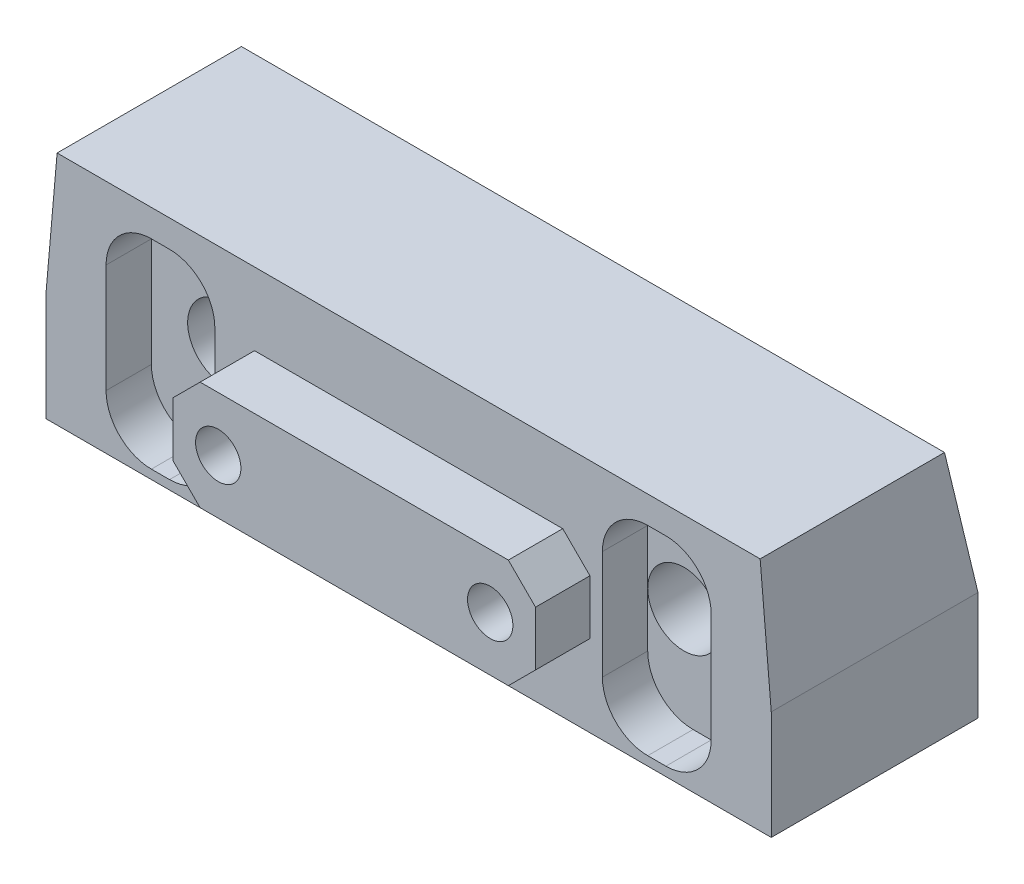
ISO-10303-21;
HEADER;
FILE_DESCRIPTION(('STEP AP214'),'2;1');
FILE_NAME('part.step','',(''),(''),'','','');
FILE_SCHEMA(('AUTOMOTIVE_DESIGN { 1 0 10303 214 1 1 1 1 }'));
ENDSEC;
DATA;
#1=APPLICATION_CONTEXT('core data for automotive mechanical design processes');
#2=APPLICATION_PROTOCOL_DEFINITION('international standard','automotive_design',2000,#1);
#3=PRODUCT_CONTEXT('',#1,'mechanical');
#4=PRODUCT('Part','Part','',(#3));
#5=PRODUCT_RELATED_PRODUCT_CATEGORY('part','',(#4));
#6=PRODUCT_DEFINITION_FORMATION('','',#4);
#7=PRODUCT_DEFINITION_CONTEXT('part definition',#1,'design');
#8=PRODUCT_DEFINITION('design','',#6,#7);
#9=PRODUCT_DEFINITION_SHAPE('','',#8);
#10=(LENGTH_UNIT() NAMED_UNIT(*) SI_UNIT(.MILLI.,.METRE.));
#11=(NAMED_UNIT(*) PLANE_ANGLE_UNIT() SI_UNIT($,.RADIAN.));
#12=(NAMED_UNIT(*) SI_UNIT($,.STERADIAN.) SOLID_ANGLE_UNIT());
#13=UNCERTAINTY_MEASURE_WITH_UNIT(LENGTH_MEASURE(1.E-05),#10,'distance_accuracy_value','');
#14=(GEOMETRIC_REPRESENTATION_CONTEXT(3) GLOBAL_UNCERTAINTY_ASSIGNED_CONTEXT((#13)) GLOBAL_UNIT_ASSIGNED_CONTEXT((#10,
#11,#12)) REPRESENTATION_CONTEXT('',''));
#15=CARTESIAN_POINT('',(0.,0.,0.));
#16=DIRECTION('',(0.,0.,1.));
#17=DIRECTION('',(1.,0.,0.));
#18=AXIS2_PLACEMENT_3D('',#15,#16,#17);
#19=CARTESIAN_POINT('',(-14.21,-2.5375,124.925));
#20=DIRECTION('',(0.,0.,1.));
#21=DIRECTION('',(0.,1.,0.));
#22=AXIS2_PLACEMENT_3D('',#19,#20,#21);
#23=PLANE('',#22);
#24=DIRECTION('',(-1.,0.,0.));
#25=VECTOR('',#24,1.);
#26=CARTESIAN_POINT('',(-14.21,2.04184439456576,124.925));
#27=LINE('',#26,#25);
#28=CARTESIAN_POINT('',(-19.113871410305,2.04184439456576,124.925));
#29=VERTEX_POINT('',#28);
#30=CARTESIAN_POINT('',(-14.7056556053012,2.04184439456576,124.925));
#31=VERTEX_POINT('',#30);
#32=EDGE_CURVE('E1266',#29,#31,#27,.F.);
#33=ORIENTED_EDGE('',*,*,#32,.T.);
#34=DIRECTION('',(0.,1.,0.));
#35=VECTOR('',#34,1.);
#36=CARTESIAN_POINT('',(-14.7056556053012,-2.53749999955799,124.925));
#37=LINE('',#36,#35);
#38=CARTESIAN_POINT('',(-14.7056556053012,-2.04184439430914,124.925));
#39=VERTEX_POINT('',#38);
#40=EDGE_CURVE('E1142',#31,#39,#37,.F.);
#41=ORIENTED_EDGE('',*,*,#40,.T.);
#42=DIRECTION('',(1.,0.,0.));
#43=VECTOR('',#42,1.);
#44=CARTESIAN_POINT('',(-19.8388286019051,-2.04184439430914,124.925));
#45=LINE('',#44,#43);
#46=CARTESIAN_POINT('',(-19.1138714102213,-2.04184439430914,124.925));
#47=VERTEX_POINT('',#46);
#48=EDGE_CURVE('E1147',#39,#47,#45,.F.);
#49=ORIENTED_EDGE('',*,*,#48,.T.);
#50=CARTESIAN_POINT('',(-25.375,0.,124.925));
#51=DIRECTION('',(0.,0.,1.));
#52=DIRECTION('',(1.,0.,0.));
#53=AXIS2_PLACEMENT_3D('',#50,#51,#52);
#54=CIRCLE('',#53,6.58565560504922);
#55=EDGE_CURVE('E1268',#47,#29,#54,.T.);
#56=ORIENTED_EDGE('',*,*,#55,.T.);
#57=EDGE_LOOP('',(#33,#41,#49,#56));
#58=FACE_BOUND('',#57,.T.);
#59=ADVANCED_FACE('F30',(#58),#23,.F.);
#60=CARTESIAN_POINT('',(19.872715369,-2.5375,124.925));
#61=DIRECTION('',(0.,0.,1.));
#62=DIRECTION('',(0.,1.,0.));
#63=AXIS2_PLACEMENT_3D('',#60,#61,#62);
#64=PLANE('',#63);
#65=DIRECTION('',(1.,0.,0.));
#66=VECTOR('',#65,1.);
#67=CARTESIAN_POINT('',(14.210000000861,-2.04184439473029,124.925));
#68=LINE('',#67,#66);
#69=CARTESIAN_POINT('',(19.1138714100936,-2.04184439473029,124.925));
#70=VERTEX_POINT('',#69);
#71=CARTESIAN_POINT('',(14.7056556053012,-2.04184439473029,124.925));
#72=VERTEX_POINT('',#71);
#73=EDGE_CURVE('E1188',#70,#72,#68,.F.);
#74=ORIENTED_EDGE('',*,*,#73,.T.);
#75=DIRECTION('',(0.,-1.,0.));
#76=VECTOR('',#75,1.);
#77=CARTESIAN_POINT('',(14.7056556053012,2.53750000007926,124.925));
#78=LINE('',#77,#76);
#79=CARTESIAN_POINT('',(14.7056556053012,2.04184439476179,124.925));
#80=VERTEX_POINT('',#79);
#81=EDGE_CURVE('E1190',#72,#80,#78,.F.);
#82=ORIENTED_EDGE('',*,*,#81,.T.);
#83=DIRECTION('',(-1.,0.,0.));
#84=VECTOR('',#83,1.);
#85=CARTESIAN_POINT('',(19.838828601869,2.04184439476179,124.925));
#86=LINE('',#85,#84);
#87=CARTESIAN_POINT('',(19.1138714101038,2.04184439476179,124.925));
#88=VERTEX_POINT('',#87);
#89=EDGE_CURVE('E1184',#80,#88,#86,.F.);
#90=ORIENTED_EDGE('',*,*,#89,.T.);
#91=CARTESIAN_POINT('',(25.375,0.,124.925));
#92=DIRECTION('',(0.,0.,1.));
#93=DIRECTION('',(1.,0.,0.));
#94=AXIS2_PLACEMENT_3D('',#91,#92,#93);
#95=CIRCLE('',#94,6.58565560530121);
#96=EDGE_CURVE('E1186',#88,#70,#95,.T.);
#97=ORIENTED_EDGE('',*,*,#96,.T.);
#98=EDGE_LOOP('',(#74,#82,#90,#97));
#99=FACE_BOUND('',#98,.T.);
#100=ADVANCED_FACE('F1422',(#99),#64,.F.);
#101=CARTESIAN_POINT('',(-14.131255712,2.537499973,124.924996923));
#102=DIRECTION('',(0.,0.999961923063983,-0.00872653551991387));
#103=DIRECTION('',(-1.,0.,0.));
#104=AXIS2_PLACEMENT_3D('',#101,#102,#103);
#105=PLANE('',#104);
#106=DIRECTION('',(1.,0.,0.));
#107=VECTOR('',#106,1.);
#108=CARTESIAN_POINT('',(-21.8225,2.58178885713,130.));
#109=LINE('',#108,#107);
#110=CARTESIAN_POINT('',(-19.169183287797,2.58178885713,130.));
#111=VERTEX_POINT('',#110);
#112=CARTESIAN_POINT('',(-14.6656921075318,2.58178885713,130.));
#113=VERTEX_POINT('',#112);
#114=EDGE_CURVE('E720',#111,#113,#109,.T.);
#115=ORIENTED_EDGE('',*,*,#114,.T.);
#116=DIRECTION('',(0.00872620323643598,0.00872620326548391,0.999923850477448));
#117=VECTOR('',#116,1.);
#118=CARTESIAN_POINT('',(-14.7099369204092,2.53754404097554,124.930046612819));
#119=LINE('',#118,#117);
#120=CARTESIAN_POINT('',(-14.7056556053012,2.54182535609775,125.42063673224));
#121=VERTEX_POINT('',#120);
#122=EDGE_CURVE('E1144',#113,#121,#119,.F.);
#123=ORIENTED_EDGE('',*,*,#122,.T.);
#124=DIRECTION('',(-1.,0.,0.));
#125=VECTOR('',#124,1.);
#126=CARTESIAN_POINT('',(-19.8388286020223,2.54182535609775,125.42063673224));
#127=LINE('',#126,#125);
#128=CARTESIAN_POINT('',(-19.113871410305,2.54182535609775,125.42063673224));
#129=VERTEX_POINT('',#128);
#130=EDGE_CURVE('E1141',#121,#129,#127,.T.);
#131=ORIENTED_EDGE('',*,*,#130,.T.);
#132=CARTESIAN_POINT('',(-19.2938473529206,2.6705598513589,140.172148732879));
#133=CARTESIAN_POINT('',(-20.0030755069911,2.6704832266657,140.16336841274));
#134=CARTESIAN_POINT('',(-19.7647313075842,2.00250371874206,140.172148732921));
#135=CARTESIAN_POINT('',(-19.2676415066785,2.65208838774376,138.055528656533));
#136=CARTESIAN_POINT('',(-19.9738979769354,2.65206532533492,138.052885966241));
#137=CARTESIAN_POINT('',(-19.7392075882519,1.98594337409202,138.055528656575));
#138=CARTESIAN_POINT('',(-19.2416047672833,2.63361690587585,135.938906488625));
#139=CARTESIAN_POINT('',(-19.9448616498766,2.63359308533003,135.936176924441));
#140=CARTESIAN_POINT('',(-19.713834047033,1.96936662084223,135.938906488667));
#141=CARTESIAN_POINT('',(-19.1898573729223,2.59667390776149,131.705658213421));
#142=CARTESIAN_POINT('',(-19.8872326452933,2.59665111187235,131.703046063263));
#143=CARTESIAN_POINT('',(-19.6633770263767,1.93618110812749,131.705658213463));
#144=CARTESIAN_POINT('',(-19.1641467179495,2.57820239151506,129.589032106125));
#145=CARTESIAN_POINT('',(-19.8586334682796,2.57817877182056,129.586325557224));
#146=CARTESIAN_POINT('',(-19.6382935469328,1.91957234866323,129.589032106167));
#147=CARTESIAN_POINT('',(-19.1130393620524,2.54125932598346,125.355776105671));
#148=CARTESIAN_POINT('',(-19.8018598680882,2.54123662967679,125.353175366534));
#149=CARTESIAN_POINT('',(-19.588406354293,1.88632363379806,125.355776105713));
#150=CARTESIAN_POINT('',(-19.0876426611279,2.52278777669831,123.239146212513));
#151=CARTESIAN_POINT('',(-19.7736793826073,2.52276434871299,123.236461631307));
#152=CARTESIAN_POINT('',(-19.5636026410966,1.8696836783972,123.239146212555));
#153=CARTESIAN_POINT('',(-19.0371521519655,2.48584464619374,119.005882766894));
#154=CARTESIAN_POINT('',(-19.7177251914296,2.48582205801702,119.003294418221));
#155=CARTESIAN_POINT('',(-19.5142655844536,1.83637334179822,119.005882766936));
#156=CARTESIAN_POINT('',(-19.0120583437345,2.46737306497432,116.889249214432));
#157=CARTESIAN_POINT('',(-19.6899458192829,2.46734968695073,116.886570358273));
#158=CARTESIAN_POINT('',(-19.4897322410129,1.81970296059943,116.889249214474));
#159=CARTESIAN_POINT('',(-18.9871104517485,2.44890146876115,114.772613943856));
#160=CARTESIAN_POINT('',(-19.6622922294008,2.44883202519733,114.764656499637));
#161=CARTESIAN_POINT('',(-19.4653293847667,1.80301775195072,114.772613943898));
#162=(BOUNDED_SURFACE() B_SPLINE_SURFACE(3,2,((#132,#133,#134),(#135,#136,#137),(#138,#139,
#140),(#141,#142,#143),(#144,#145,#146),(#147,#148,#149),(#150,#151,#152),(#153,#154,#155),
(#156,#157,#158),(#159,#160,#161)),.UNSPECIFIED.,.F.,.F.,.F.) B_SPLINE_SURFACE_WITH_KNOTS((4,2,
2,2,4),(3,3),(0.,6.35058865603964,12.7011771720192,19.0517656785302,25.4023543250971),(0.,1.),
.UNSPECIFIED.) GEOMETRIC_REPRESENTATION_ITEM() RATIONAL_B_SPLINE_SURFACE(((1.,0.576167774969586,
1.),(1.,0.57782617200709,1.),(1.,0.579463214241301,1.),(1.,0.58269629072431,1.),(1.,
0.584292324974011,1.),(1.,0.587445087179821,1.),(1.,0.589001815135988,1.),(1.,0.592077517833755,
1.),(1.,0.593596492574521,1.),(1.,0.595097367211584,1.))) REPRESENTATION_ITEM('') SURFACE());
#163=CARTESIAN_POINT('',(-18.9871104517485,2.44890146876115,114.772613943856));
#164=CARTESIAN_POINT('',(-19.0120583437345,2.46737306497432,116.889249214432));
#165=CARTESIAN_POINT('',(-19.0371521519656,2.48584464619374,119.005882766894));
#166=CARTESIAN_POINT('',(-19.0876426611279,2.52278777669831,123.239146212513));
#167=CARTESIAN_POINT('',(-19.1130393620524,2.54125932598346,125.355776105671));
#168=CARTESIAN_POINT('',(-19.1641467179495,2.57820239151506,129.589032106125));
#169=CARTESIAN_POINT('',(-19.1898573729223,2.59667390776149,131.705658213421));
#170=CARTESIAN_POINT('',(-19.2416047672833,2.63361690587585,135.938906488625));
#171=CARTESIAN_POINT('',(-19.2676415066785,2.65208838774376,138.055528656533));
#172=CARTESIAN_POINT('',(-19.2938473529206,2.6705598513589,140.172148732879));
#173=B_SPLINE_CURVE_WITH_KNOTS('',3,(#163,#164,#165,#166,#167,#168,#169,#170,#171,#172),
.UNSPECIFIED.,.F.,.F.,(4,2,2,2,4),(0.,6.35058864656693,12.7011771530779,19.0517656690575,
25.4023543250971),.UNSPECIFIED.);
#174=EDGE_CURVE('E1137',#129,#111,#173,.T.);
#175=ORIENTED_EDGE('',*,*,#174,.T.);
#176=EDGE_LOOP('',(#115,#123,#131,#175));
#177=FACE_BOUND('',#176,.T.);
#178=ADVANCED_FACE('F959',(#177),#105,.T.);
#179=CARTESIAN_POINT('',(-14.21,-2.61277032,124.925));
#180=DIRECTION('',(0.999961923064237,0.,-0.00872653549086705));
#181=DIRECTION('',(0.,1.,0.));
#182=AXIS2_PLACEMENT_3D('',#179,#180,#181);
#183=PLANE('',#182);
#184=DIRECTION('',(0.,-1.,0.));
#185=VECTOR('',#184,1.);
#186=CARTESIAN_POINT('',(-14.1657111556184,0.,130.));
#187=LINE('',#186,#185);
#188=CARTESIAN_POINT('',(-14.1657111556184,2.08180789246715,130.));
#189=VERTEX_POINT('',#188);
#190=CARTESIAN_POINT('',(-14.1657111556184,-2.08180789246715,130.));
#191=VERTEX_POINT('',#190);
#192=EDGE_CURVE('E719',#189,#191,#187,.T.);
#193=ORIENTED_EDGE('',*,*,#192,.T.);
#194=DIRECTION('',(0.00872620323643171,-0.00872620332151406,0.999923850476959));
#195=VECTOR('',#194,1.);
#196=CARTESIAN_POINT('',(-14.2099561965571,-2.03756284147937,124.930019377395));
#197=LINE('',#196,#195);
#198=CARTESIAN_POINT('',(-14.2056746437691,-2.04184439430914,125.420636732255));
#199=VERTEX_POINT('',#198);
#200=EDGE_CURVE('E1264',#191,#199,#197,.F.);
#201=ORIENTED_EDGE('',*,*,#200,.T.);
#202=DIRECTION('',(0.,1.,0.));
#203=VECTOR('',#202,1.);
#204=CARTESIAN_POINT('',(-14.2056746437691,2.53750000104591,125.420636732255));
#205=LINE('',#204,#203);
#206=CARTESIAN_POINT('',(-14.2056746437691,2.04184439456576,125.420636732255));
#207=VERTEX_POINT('',#206);
#208=EDGE_CURVE('E1260',#199,#207,#205,.T.);
#209=ORIENTED_EDGE('',*,*,#208,.T.);
#210=DIRECTION('',(0.00872620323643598,0.00872620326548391,0.999923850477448));
#211=VECTOR('',#210,1.);
#212=CARTESIAN_POINT('',(-14.2103541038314,2.03716493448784,124.884423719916));
#213=LINE('',#212,#211);
#214=EDGE_CURVE('E1258',#207,#189,#213,.T.);
#215=ORIENTED_EDGE('',*,*,#214,.T.);
#216=EDGE_LOOP('',(#193,#201,#209,#215));
#217=FACE_BOUND('',#216,.T.);
#218=ADVANCED_FACE('F1428',(#217),#183,.T.);
#219=CARTESIAN_POINT('',(-14.131255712,-2.537499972,124.924996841));
#220=DIRECTION('',(0.,-0.999961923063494,-0.00872653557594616));
#221=DIRECTION('',(0.,-0.00872653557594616,0.999961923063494));
#222=AXIS2_PLACEMENT_3D('',#219,#220,#221);
#223=PLANE('',#222);
#224=DIRECTION('',(1.,0.,0.));
#225=VECTOR('',#224,1.);
#226=CARTESIAN_POINT('',(-14.2100000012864,-2.54182535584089,125.420636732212));
#227=LINE('',#226,#225);
#228=CARTESIAN_POINT('',(-19.1138714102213,-2.54182535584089,125.420636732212));
#229=VERTEX_POINT('',#228);
#230=CARTESIAN_POINT('',(-14.7056556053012,-2.54182535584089,125.420636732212));
#231=VERTEX_POINT('',#230);
#232=EDGE_CURVE('E888',#229,#231,#227,.T.);
#233=ORIENTED_EDGE('',*,*,#232,.T.);
#234=DIRECTION('',(0.00872620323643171,-0.00872620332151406,0.999923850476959));
#235=VECTOR('',#234,1.);
#236=CARTESIAN_POINT('',(-14.7099369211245,-2.53754403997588,124.930046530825));
#237=LINE('',#236,#235);
#238=CARTESIAN_POINT('',(-14.6656921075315,-2.58178885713,130.));
#239=VERTEX_POINT('',#238);
#240=EDGE_CURVE('E1257',#231,#239,#237,.T.);
#241=ORIENTED_EDGE('',*,*,#240,.T.);
#242=DIRECTION('',(-1.,0.,0.));
#243=VECTOR('',#242,1.);
#244=CARTESIAN_POINT('',(-21.8225,-2.58178885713,130.));
#245=LINE('',#244,#243);
#246=CARTESIAN_POINT('',(-19.1691832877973,-2.58178885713,130.));
#247=VERTEX_POINT('',#246);
#248=EDGE_CURVE('E716',#239,#247,#245,.T.);
#249=ORIENTED_EDGE('',*,*,#248,.T.);
#250=CARTESIAN_POINT('',(-18.9871104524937,-2.44890146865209,114.772614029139));
#251=CARTESIAN_POINT('',(-19.6622922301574,-2.44883202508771,114.764656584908));
#252=CARTESIAN_POINT('',(-19.4653293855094,-1.80301775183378,114.772614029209));
#253=CARTESIAN_POINT('',(-19.0120583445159,-2.46737306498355,116.889249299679));
#254=CARTESIAN_POINT('',(-19.6899458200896,-2.46734968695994,116.886570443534));
#255=CARTESIAN_POINT('',(-19.489732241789,-1.81970296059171,116.889249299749));
#256=CARTESIAN_POINT('',(-19.0371521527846,-2.48584464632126,119.005882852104));
#257=CARTESIAN_POINT('',(-19.7177251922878,-2.48582205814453,119.003294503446));
#258=CARTESIAN_POINT('',(-19.5142655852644,-1.83637334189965,119.005882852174));
#259=CARTESIAN_POINT('',(-19.0876426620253,-2.52278777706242,123.23914629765));
#260=CARTESIAN_POINT('',(-19.7736793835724,-2.52276434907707,123.236461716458));
#261=CARTESIAN_POINT('',(-19.5636026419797,-1.86968367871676,123.23914629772));
#262=CARTESIAN_POINT('',(-19.1130393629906,-2.54125932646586,125.355776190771));
#263=CARTESIAN_POINT('',(-19.8018598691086,-2.54123663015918,125.353175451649));
#264=CARTESIAN_POINT('',(-19.5884063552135,-1.88632363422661,125.355776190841));
#265=CARTESIAN_POINT('',(-19.1641467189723,-2.57820239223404,129.589032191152));
#266=CARTESIAN_POINT('',(-19.8586334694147,-2.57817877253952,129.586325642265));
#267=CARTESIAN_POINT('',(-19.6382935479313,-1.9195723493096,129.589032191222));
#268=CARTESIAN_POINT('',(-19.1898573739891,-2.59667390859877,131.705658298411));
#269=CARTESIAN_POINT('',(-19.8872326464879,-2.59665111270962,131.703046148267));
#270=CARTESIAN_POINT('',(-19.6633770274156,-1.93618110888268,131.705658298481));
#271=CARTESIAN_POINT('',(-19.2416047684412,-2.63361690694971,135.938906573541));
#272=CARTESIAN_POINT('',(-19.9448616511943,-2.63359308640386,135.936177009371));
#273=CARTESIAN_POINT('',(-19.7138340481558,-1.96936662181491,135.938906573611));
#274=CARTESIAN_POINT('',(-19.2676415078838,-2.65208838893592,138.055528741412));
#275=CARTESIAN_POINT('',(-19.9738979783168,-2.65206532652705,138.052886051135));
#276=CARTESIAN_POINT('',(-19.739207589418,-1.98594337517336,138.055528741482));
#277=CARTESIAN_POINT('',(-19.2938473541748,-2.67055985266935,140.172148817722));
#278=CARTESIAN_POINT('',(-20.0030755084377,-2.67048322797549,140.163368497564));
#279=CARTESIAN_POINT('',(-19.7647313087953,-2.00250371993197,140.172148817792));
#280=(BOUNDED_SURFACE() B_SPLINE_SURFACE(3,2,((#250,#251,#252),(#253,#254,#255),(#256,#257,
#258),(#259,#260,#261),(#262,#263,#264),(#265,#266,#267),(#268,#269,#270),(#271,#272,#273),
(#274,#275,#276),(#277,#278,#279)),.UNSPECIFIED.,.F.,.F.,.F.) B_SPLINE_SURFACE_WITH_KNOTS((4,2,
2,2,4),(3,3),(0.,6.35058864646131,12.7011771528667,19.0517656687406,25.4023543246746),(0.,1.),
.UNSPECIFIED.) GEOMETRIC_REPRESENTATION_ITEM() RATIONAL_B_SPLINE_SURFACE(((1.,0.59509736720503,
1.),(1.,0.593596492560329,1.),(1.,0.592077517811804,1.),(1.,0.589001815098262,1.),(1.,
0.587445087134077,1.),(1.,0.584292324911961,1.),(1.,0.58269629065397,1.),(1.,0.579463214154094,
1.),(1.,0.577826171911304,1.),(1.,0.576167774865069,1.))) REPRESENTATION_ITEM('') SURFACE());
#281=CARTESIAN_POINT('',(-19.2938473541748,-2.67055985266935,140.172148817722));
#282=CARTESIAN_POINT('',(-19.2676415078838,-2.65208838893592,138.055528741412));
#283=CARTESIAN_POINT('',(-19.2416047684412,-2.63361690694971,135.938906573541));
#284=CARTESIAN_POINT('',(-19.1898573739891,-2.59667390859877,131.705658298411));
#285=CARTESIAN_POINT('',(-19.1641467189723,-2.57820239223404,129.589032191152));
#286=CARTESIAN_POINT('',(-19.1130393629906,-2.54125932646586,125.355776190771));
#287=CARTESIAN_POINT('',(-19.0876426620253,-2.52278777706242,123.23914629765));
#288=CARTESIAN_POINT('',(-19.0371521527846,-2.48584464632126,119.005882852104));
#289=CARTESIAN_POINT('',(-19.0120583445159,-2.46737306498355,116.889249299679));
#290=CARTESIAN_POINT('',(-18.9871104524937,-2.44890146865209,114.772614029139));
#291=B_SPLINE_CURVE_WITH_KNOTS('',3,(#281,#282,#283,#284,#285,#286,#287,#288,#289,#290),
.UNSPECIFIED.,.F.,.F.,(4,2,2,2,4),(0.,6.35058865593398,12.7011771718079,19.0517656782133,
25.4023543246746),.UNSPECIFIED.);
#292=EDGE_CURVE('E881',#247,#229,#291,.T.);
#293=ORIENTED_EDGE('',*,*,#292,.T.);
#294=EDGE_LOOP('',(#233,#241,#249,#293));
#295=FACE_BOUND('',#294,.T.);
#296=ADVANCED_FACE('F890',(#295),#223,.T.);
#297=CARTESIAN_POINT('',(-25.375,0.,130.));
#298=DIRECTION('',(0.,0.,-1.));
#299=DIRECTION('',(-1.,0.,0.));
#300=AXIS2_PLACEMENT_3D('',#297,#298,#299);
#301=CONICAL_SURFACE('',#300,6.045711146,0.00872664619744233);
#302=CARTESIAN_POINT('',(-25.375,0.,125.420636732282));
#303=DIRECTION('',(0.,0.,-1.));
#304=DIRECTION('',(-1.,0.,0.));
#305=AXIS2_PLACEMENT_3D('',#302,#303,#304);
#306=CIRCLE('',#305,6.08567464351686);
#307=CARTESIAN_POINT('',(-19.5892143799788,1.8868281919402,125.420636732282));
#308=VERTEX_POINT('',#307);
#309=CARTESIAN_POINT('',(-19.5892143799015,-1.88682819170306,125.420636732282));
#310=VERTEX_POINT('',#309);
#311=EDGE_CURVE('E1159',#308,#310,#306,.T.);
#312=ORIENTED_EDGE('',*,*,#311,.T.);
#313=CARTESIAN_POINT('',(-19.4653293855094,-1.80301775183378,114.772614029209));
#314=CARTESIAN_POINT('',(-19.489732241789,-1.81970296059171,116.889249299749));
#315=CARTESIAN_POINT('',(-19.5142655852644,-1.83637334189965,119.005882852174));
#316=CARTESIAN_POINT('',(-19.5636026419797,-1.86968367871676,123.23914629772));
#317=CARTESIAN_POINT('',(-19.5884063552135,-1.88632363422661,125.355776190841));
#318=CARTESIAN_POINT('',(-19.6382935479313,-1.9195723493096,129.589032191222));
#319=CARTESIAN_POINT('',(-19.6633770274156,-1.93618110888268,131.705658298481));
#320=CARTESIAN_POINT('',(-19.7138340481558,-1.96936662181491,135.938906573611));
#321=CARTESIAN_POINT('',(-19.739207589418,-1.98594337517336,138.055528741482));
#322=CARTESIAN_POINT('',(-19.7647313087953,-2.00250371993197,140.172148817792));
#323=B_SPLINE_CURVE_WITH_KNOTS('',3,(#313,#314,#315,#316,#317,#318,#319,#320,#321,#322),
.UNSPECIFIED.,.F.,.F.,(4,2,2,2,4),(0.,6.35058864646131,12.7011771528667,19.0517656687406,
25.4023543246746),.UNSPECIFIED.);
#324=CARTESIAN_POINT('',(-19.6432034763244,-1.92279272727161,130.));
#325=VERTEX_POINT('',#324);
#326=EDGE_CURVE('E1165',#310,#325,#323,.T.);
#327=ORIENTED_EDGE('',*,*,#326,.T.);
#328=CARTESIAN_POINT('',(-25.375,0.,130.));
#329=DIRECTION('',(0.,0.,-1.));
#330=DIRECTION('',(-1.,0.,0.));
#331=AXIS2_PLACEMENT_3D('',#328,#329,#330);
#332=CIRCLE('',#331,6.045711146);
#333=CARTESIAN_POINT('',(-19.6432034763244,1.92279272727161,130.));
#334=VERTEX_POINT('',#333);
#335=EDGE_CURVE('E715',#325,#334,#332,.F.);
#336=ORIENTED_EDGE('',*,*,#335,.T.);
#337=CARTESIAN_POINT('',(-19.7647313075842,2.00250371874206,140.172148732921));
#338=CARTESIAN_POINT('',(-19.7392075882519,1.98594337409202,138.055528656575));
#339=CARTESIAN_POINT('',(-19.713834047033,1.96936662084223,135.938906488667));
#340=CARTESIAN_POINT('',(-19.6633770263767,1.93618110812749,131.705658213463));
#341=CARTESIAN_POINT('',(-19.6382935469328,1.91957234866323,129.589032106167));
#342=CARTESIAN_POINT('',(-19.588406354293,1.88632363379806,125.355776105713));
#343=CARTESIAN_POINT('',(-19.5636026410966,1.8696836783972,123.239146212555));
#344=CARTESIAN_POINT('',(-19.5142655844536,1.83637334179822,119.005882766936));
#345=CARTESIAN_POINT('',(-19.4897322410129,1.81970296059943,116.889249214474));
#346=CARTESIAN_POINT('',(-19.4653293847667,1.80301775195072,114.772613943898));
#347=B_SPLINE_CURVE_WITH_KNOTS('',3,(#337,#338,#339,#340,#341,#342,#343,#344,#345,#346),
.UNSPECIFIED.,.F.,.F.,(4,2,2,2,4),(0.,6.35058865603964,12.7011771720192,19.0517656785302,
25.4023543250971),.UNSPECIFIED.);
#348=EDGE_CURVE('E1136',#334,#308,#347,.T.);
#349=ORIENTED_EDGE('',*,*,#348,.T.);
#350=EDGE_LOOP('',(#312,#327,#336,#349));
#351=FACE_BOUND('',#350,.T.);
#352=ADVANCED_FACE('F918',(#351),#301,.F.);
#353=CARTESIAN_POINT('',(14.21,2.61277032,124.925));
#354=DIRECTION('',(-0.999961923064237,0.,-0.00872653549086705));
#355=DIRECTION('',(0.,-1.,0.));
#356=AXIS2_PLACEMENT_3D('',#353,#354,#355);
#357=PLANE('',#356);
#358=DIRECTION('',(0.,-1.,0.));
#359=VECTOR('',#358,1.);
#360=CARTESIAN_POINT('',(14.2056746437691,-2.53750000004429,125.420636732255));
#361=LINE('',#360,#359);
#362=CARTESIAN_POINT('',(14.2056746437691,2.04184439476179,125.420636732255));
#363=VERTEX_POINT('',#362);
#364=CARTESIAN_POINT('',(14.2056746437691,-2.04184439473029,125.420636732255));
#365=VERTEX_POINT('',#364);
#366=EDGE_CURVE('E1179',#363,#365,#361,.T.);
#367=ORIENTED_EDGE('',*,*,#366,.T.);
#368=DIRECTION('',(0.00872620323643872,0.00872620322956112,-0.999923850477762));
#369=VECTOR('',#368,1.);
#370=CARTESIAN_POINT('',(14.21035410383,-2.03716493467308,124.884423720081));
#371=LINE('',#370,#369);
#372=CARTESIAN_POINT('',(14.1657111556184,-2.08180789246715,130.));
#373=VERTEX_POINT('',#372);
#374=EDGE_CURVE('E1182',#365,#373,#371,.F.);
#375=ORIENTED_EDGE('',*,*,#374,.T.);
#376=DIRECTION('',(0.,1.,0.));
#377=VECTOR('',#376,1.);
#378=CARTESIAN_POINT('',(14.1657111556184,0.,130.));
#379=LINE('',#378,#377);
#380=CARTESIAN_POINT('',(14.1657111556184,2.08180789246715,130.));
#381=VERTEX_POINT('',#380);
#382=EDGE_CURVE('E711',#373,#381,#379,.T.);
#383=ORIENTED_EDGE('',*,*,#382,.T.);
#384=DIRECTION('',(-0.00872620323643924,0.00872620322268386,0.999923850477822));
#385=VECTOR('',#384,1.);
#386=CARTESIAN_POINT('',(14.2099561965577,2.03756284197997,124.930019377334));
#387=LINE('',#386,#385);
#388=EDGE_CURVE('E1177',#381,#363,#387,.F.);
#389=ORIENTED_EDGE('',*,*,#388,.T.);
#390=EDGE_LOOP('',(#367,#375,#383,#389));
#391=FACE_BOUND('',#390,.T.);
#392=ADVANCED_FACE('F1055',(#391),#357,.T.);
#393=CARTESIAN_POINT('',(19.942738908,2.5375,124.924999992));
#394=DIRECTION('',(0.,0.999961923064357,-0.00872653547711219));
#395=DIRECTION('',(-1.,0.,0.));
#396=AXIS2_PLACEMENT_3D('',#393,#394,#395);
#397=PLANE('',#396);
#398=DIRECTION('',(-1.,0.,0.));
#399=VECTOR('',#398,1.);
#400=CARTESIAN_POINT('',(14.2100000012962,2.54182535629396,125.420636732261));
#401=LINE('',#400,#399);
#402=CARTESIAN_POINT('',(19.1138714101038,2.54182535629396,125.420636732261));
#403=VERTEX_POINT('',#402);
#404=CARTESIAN_POINT('',(14.7056556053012,2.54182535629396,125.420636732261));
#405=VERTEX_POINT('',#404);
#406=EDGE_CURVE('E50',#403,#405,#401,.T.);
#407=ORIENTED_EDGE('',*,*,#406,.T.);
#408=DIRECTION('',(-0.00872620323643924,0.00872620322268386,0.999923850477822));
#409=VECTOR('',#408,1.);
#410=CARTESIAN_POINT('',(14.7103794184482,2.53710154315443,124.87934135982));
#411=LINE('',#410,#409);
#412=CARTESIAN_POINT('',(14.6656921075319,2.58178885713,130.));
#413=VERTEX_POINT('',#412);
#414=EDGE_CURVE('E1333',#405,#413,#411,.T.);
#415=ORIENTED_EDGE('',*,*,#414,.T.);
#416=DIRECTION('',(1.,0.,0.));
#417=VECTOR('',#416,1.);
#418=CARTESIAN_POINT('',(21.8225,2.58178885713,130.));
#419=LINE('',#418,#417);
#420=CARTESIAN_POINT('',(19.1691832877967,2.58178885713,130.));
#421=VERTEX_POINT('',#420);
#422=EDGE_CURVE('E709',#413,#421,#419,.T.);
#423=ORIENTED_EDGE('',*,*,#422,.T.);
#424=CARTESIAN_POINT('',(18.9871104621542,2.44890147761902,114.772614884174));
#425=CARTESIAN_POINT('',(19.6622922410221,2.44883203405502,114.764657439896));
#426=CARTESIAN_POINT('',(19.4653293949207,1.80301775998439,114.772614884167));
#427=CARTESIAN_POINT('',(19.012058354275,2.46737307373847,116.889250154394));
#428=CARTESIAN_POINT('',(19.6899458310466,2.46734969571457,116.886571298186));
#429=CARTESIAN_POINT('',(19.4897322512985,1.81970296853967,116.889250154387));
#430=CARTESIAN_POINT('',(19.037152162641,2.48584465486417,119.005883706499));
#431=CARTESIAN_POINT('',(19.7177252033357,2.48582206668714,119.003295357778));
#432=CARTESIAN_POINT('',(19.5142655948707,1.83637334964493,119.005883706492));
#433=CARTESIAN_POINT('',(19.0876426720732,2.5227877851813,123.239147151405));
#434=CARTESIAN_POINT('',(19.773679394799,2.52276435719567,123.23646257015));
#435=CARTESIAN_POINT('',(19.5636026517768,1.86968368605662,123.239147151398));
#436=CARTESIAN_POINT('',(19.1130393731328,2.54125933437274,125.355777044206));
#437=CARTESIAN_POINT('',(19.8018598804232,2.54123663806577,125.353176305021));
#438=CARTESIAN_POINT('',(19.5884063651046,1.88632364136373,125.3557770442));
#439=CARTESIAN_POINT('',(19.1641467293,2.5782023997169,129.589033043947));
#440=CARTESIAN_POINT('',(19.8586334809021,2.5781787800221,129.586326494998));
#441=CARTESIAN_POINT('',(19.6382935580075,1.91957235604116,129.58903304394));
#442=CARTESIAN_POINT('',(19.1898573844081,2.59667391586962,131.705659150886));
#443=CARTESIAN_POINT('',(19.8872326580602,2.59665111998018,131.703047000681));
#444=CARTESIAN_POINT('',(19.663377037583,1.93618111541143,131.70565915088));
#445=CARTESIAN_POINT('',(19.2416047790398,2.63361691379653,135.938907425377));
#446=CARTESIAN_POINT('',(19.9448616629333,2.63359309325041,135.936177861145));
#447=CARTESIAN_POINT('',(19.7138340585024,1.96936662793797,135.93890742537));
#448=CARTESIAN_POINT('',(19.2676415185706,2.65208839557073,138.055529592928));
#449=CARTESIAN_POINT('',(19.9738979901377,2.65206533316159,138.05288690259));
#450=CARTESIAN_POINT('',(19.7392075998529,1.98594338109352,138.055529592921));
#451=CARTESIAN_POINT('',(19.2938473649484,2.67055985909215,140.172149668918));
#452=CARTESIAN_POINT('',(20.0030755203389,2.67048323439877,140.163369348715));
#453=CARTESIAN_POINT('',(19.7647313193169,2.0025037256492,140.172149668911));
#454=(BOUNDED_SURFACE() B_SPLINE_SURFACE(3,2,((#424,#425,#426),(#427,#428,#429),(#430,#431,
#432),(#433,#434,#435),(#436,#437,#438),(#439,#440,#441),(#442,#443,#444),(#445,#446,#447),
(#448,#449,#450),(#451,#452,#453)),.UNSPECIFIED.,.F.,.F.,.F.) B_SPLINE_SURFACE_WITH_KNOTS((4,2,
2,2,4),(3,3),(0.,6.35058864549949,12.701177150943,19.0517656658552,25.4023543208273),(0.,1.),
.UNSPECIFIED.) GEOMETRIC_REPRESENTATION_ITEM() RATIONAL_B_SPLINE_SURFACE(((1.,0.595097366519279,
1.),(1.,0.593596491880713,1.),(1.,0.592077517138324,1.),(1.,0.589001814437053,1.),(1.,
0.587445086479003,1.),(1.,0.584292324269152,1.),(1.,0.582696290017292,1.),(1.,0.579463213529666,
1.),(1.,0.577826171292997,1.),(1.,0.576167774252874,1.))) REPRESENTATION_ITEM('') SURFACE());
#455=CARTESIAN_POINT('',(19.2938473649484,2.67055985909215,140.172149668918));
#456=CARTESIAN_POINT('',(19.2676415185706,2.65208839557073,138.055529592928));
#457=CARTESIAN_POINT('',(19.2416047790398,2.63361691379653,135.938907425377));
#458=CARTESIAN_POINT('',(19.1898573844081,2.59667391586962,131.705659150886));
#459=CARTESIAN_POINT('',(19.1641467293,2.5782023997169,129.589033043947));
#460=CARTESIAN_POINT('',(19.1130393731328,2.54125933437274,125.355777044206));
#461=CARTESIAN_POINT('',(19.0876426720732,2.5227877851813,123.239147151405));
#462=CARTESIAN_POINT('',(19.037152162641,2.48584465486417,119.005883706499));
#463=CARTESIAN_POINT('',(19.012058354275,2.46737307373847,116.889250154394));
#464=CARTESIAN_POINT('',(18.9871104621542,2.44890147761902,114.772614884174));
#465=B_SPLINE_CURVE_WITH_KNOTS('',3,(#455,#456,#457,#458,#459,#460,#461,#462,#463,#464),
.UNSPECIFIED.,.F.,.F.,(4,2,2,2,4),(0.,6.35058865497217,12.7011771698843,19.0517656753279,
25.4023543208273),.UNSPECIFIED.);
#466=EDGE_CURVE('E55',#421,#403,#465,.T.);
#467=ORIENTED_EDGE('',*,*,#466,.T.);
#468=EDGE_LOOP('',(#407,#415,#423,#467));
#469=FACE_BOUND('',#468,.T.);
#470=ADVANCED_FACE('F1052',(#469),#397,.T.);
#471=CARTESIAN_POINT('',(25.375,0.,130.));
#472=DIRECTION('',(0.,0.,-1.));
#473=DIRECTION('',(-1.,0.,0.));
#474=AXIS2_PLACEMENT_3D('',#471,#472,#473);
#475=CONICAL_SURFACE('',#474,6.045711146,0.00872664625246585);
#476=CARTESIAN_POINT('',(25.375,0.,130.));
#477=DIRECTION('',(0.,0.,-1.));
#478=DIRECTION('',(-1.,0.,0.));
#479=AXIS2_PLACEMENT_3D('',#476,#477,#478);
#480=CIRCLE('',#479,6.045711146);
#481=CARTESIAN_POINT('',(19.6432034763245,1.9227927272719,130.));
#482=VERTEX_POINT('',#481);
#483=CARTESIAN_POINT('',(19.6432034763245,-1.9227927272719,130.));
#484=VERTEX_POINT('',#483);
#485=EDGE_CURVE('E708',#482,#484,#480,.F.);
#486=ORIENTED_EDGE('',*,*,#485,.T.);
#487=CARTESIAN_POINT('',(19.4653293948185,-1.80301775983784,114.772614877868));
#488=CARTESIAN_POINT('',(19.6622922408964,-2.44883203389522,114.764657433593));
#489=CARTESIAN_POINT('',(18.987110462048,-2.44890147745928,114.772614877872));
#490=CARTESIAN_POINT('',(19.4897322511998,-1.81970296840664,116.889250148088));
#491=CARTESIAN_POINT('',(19.6899458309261,-2.46734969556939,116.886571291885));
#492=CARTESIAN_POINT('',(19.0120583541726,-2.46737307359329,116.889250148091));
#493=CARTESIAN_POINT('',(19.5142655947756,-1.83637334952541,119.005883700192));
#494=CARTESIAN_POINT('',(19.7177252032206,-2.48582206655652,119.003295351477));
#495=CARTESIAN_POINT('',(19.0371521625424,-2.48584465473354,119.005883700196));
#496=CARTESIAN_POINT('',(19.5636026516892,-1.8696836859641,123.239147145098));
#497=CARTESIAN_POINT('',(19.773679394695,-2.52276435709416,123.236462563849));
#498=CARTESIAN_POINT('',(19.0876426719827,-2.52278778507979,123.239147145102));
#499=CARTESIAN_POINT('',(19.588406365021,-1.8863236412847,125.3557770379));
#500=CARTESIAN_POINT('',(19.8018598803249,-2.54123663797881,125.35317629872));
#501=CARTESIAN_POINT('',(19.1130393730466,-2.54125933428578,125.355777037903));
#502=CARTESIAN_POINT('',(19.6382935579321,-1.9195723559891,129.58903303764));
#503=CARTESIAN_POINT('',(19.8586334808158,-2.57817877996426,129.586326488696));
#504=CARTESIAN_POINT('',(19.1641467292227,-2.57820239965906,129.589033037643));
#505=CARTESIAN_POINT('',(19.6633770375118,-1.93618111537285,131.705659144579));
#506=CARTESIAN_POINT('',(19.8872326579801,-2.59665111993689,131.703046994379));
#507=CARTESIAN_POINT('',(19.1898573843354,-2.59667391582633,131.705659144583));
#508=CARTESIAN_POINT('',(19.7138340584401,-1.96936662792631,135.938907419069));
#509=CARTESIAN_POINT('',(19.9448616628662,-2.63359309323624,135.936177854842));
#510=CARTESIAN_POINT('',(19.2416047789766,-2.63361691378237,135.938907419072));
#511=CARTESIAN_POINT('',(19.7392075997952,-1.98594338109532,138.05552958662));
#512=CARTESIAN_POINT('',(19.9738979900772,-2.65206533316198,138.052886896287));
#513=CARTESIAN_POINT('',(19.2676415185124,-2.65208839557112,138.055529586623));
#514=CARTESIAN_POINT('',(19.764731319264,-2.00250372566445,140.172149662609));
#515=CARTESIAN_POINT('',(20.0030755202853,-2.67048323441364,140.163369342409));
#516=CARTESIAN_POINT('',(19.2938473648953,-2.6705598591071,140.172149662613));
#517=(BOUNDED_SURFACE() B_SPLINE_SURFACE(3,2,((#487,#488,#489),(#490,#491,#492),(#493,#494,
#495),(#496,#497,#498),(#499,#500,#501),(#502,#503,#504),(#505,#506,#507),(#508,#509,#510),
(#511,#512,#513),(#514,#515,#516)),.UNSPECIFIED.,.F.,.F.,.F.) B_SPLINE_SURFACE_WITH_KNOTS((4,2,
2,2,4),(3,3),(0.,6.3505886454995,12.701177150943,19.0517656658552,25.4023543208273),(0.,1.),
.UNSPECIFIED.) GEOMETRIC_REPRESENTATION_ITEM() RATIONAL_B_SPLINE_SURFACE(((1.,0.595097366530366,
1.),(1.,0.593596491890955,1.),(1.,0.592077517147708,1.),(1.,0.589001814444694,1.),(1.,
0.587445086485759,1.),(1.,0.584292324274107,1.),(1.,0.582696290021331,1.),(1.,0.579463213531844,
1.),(1.,0.577826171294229,1.),(1.,0.576167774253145,1.))) REPRESENTATION_ITEM('') SURFACE());
#518=CARTESIAN_POINT('',(19.764731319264,-2.00250372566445,140.172149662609));
#519=CARTESIAN_POINT('',(19.7392075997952,-1.98594338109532,138.05552958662));
#520=CARTESIAN_POINT('',(19.7138340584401,-1.96936662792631,135.938907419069));
#521=CARTESIAN_POINT('',(19.6633770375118,-1.93618111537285,131.705659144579));
#522=CARTESIAN_POINT('',(19.6382935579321,-1.9195723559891,129.58903303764));
#523=CARTESIAN_POINT('',(19.588406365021,-1.8863236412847,125.3557770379));
#524=CARTESIAN_POINT('',(19.5636026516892,-1.8696836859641,123.239147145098));
#525=CARTESIAN_POINT('',(19.5142655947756,-1.83637334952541,119.005883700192));
#526=CARTESIAN_POINT('',(19.4897322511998,-1.81970296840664,116.889250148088));
#527=CARTESIAN_POINT('',(19.4653293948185,-1.80301775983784,114.772614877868));
#528=B_SPLINE_CURVE_WITH_KNOTS('',3,(#518,#519,#520,#521,#522,#523,#524,#525,#526,#527),
.UNSPECIFIED.,.F.,.F.,(4,2,2,2,4),(0.,6.35058865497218,12.7011771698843,19.0517656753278,
25.4023543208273),.UNSPECIFIED.);
#529=CARTESIAN_POINT('',(19.5892143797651,-1.88682819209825,125.420636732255));
#530=VERTEX_POINT('',#529);
#531=EDGE_CURVE('E1064',#484,#530,#528,.T.);
#532=ORIENTED_EDGE('',*,*,#531,.T.);
#533=CARTESIAN_POINT('',(25.375,0.,125.420636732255));
#534=DIRECTION('',(0.,0.,-1.));
#535=DIRECTION('',(-1.,0.,0.));
#536=AXIS2_PLACEMENT_3D('',#533,#534,#535);
#537=CIRCLE('',#536,6.0856746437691);
#538=CARTESIAN_POINT('',(19.5892143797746,1.88682819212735,125.420636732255));
#539=VERTEX_POINT('',#538);
#540=EDGE_CURVE('E1206',#530,#539,#537,.T.);
#541=ORIENTED_EDGE('',*,*,#540,.T.);
#542=CARTESIAN_POINT('',(19.4653293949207,1.80301775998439,114.772614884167));
#543=CARTESIAN_POINT('',(19.4897322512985,1.81970296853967,116.889250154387));
#544=CARTESIAN_POINT('',(19.5142655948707,1.83637334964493,119.005883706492));
#545=CARTESIAN_POINT('',(19.5636026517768,1.86968368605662,123.239147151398));
#546=CARTESIAN_POINT('',(19.5884063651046,1.88632364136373,125.3557770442));
#547=CARTESIAN_POINT('',(19.6382935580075,1.91957235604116,129.58903304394));
#548=CARTESIAN_POINT('',(19.663377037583,1.93618111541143,131.70565915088));
#549=CARTESIAN_POINT('',(19.7138340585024,1.96936662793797,135.93890742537));
#550=CARTESIAN_POINT('',(19.7392075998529,1.98594338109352,138.055529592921));
#551=CARTESIAN_POINT('',(19.7647313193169,2.0025037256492,140.172149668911));
#552=B_SPLINE_CURVE_WITH_KNOTS('',3,(#542,#543,#544,#545,#546,#547,#548,#549,#550,#551),
.UNSPECIFIED.,.F.,.F.,(4,2,2,2,4),(0.,6.35058864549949,12.701177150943,19.0517656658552,
25.4023543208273),.UNSPECIFIED.);
#553=EDGE_CURVE('E1202',#539,#482,#552,.T.);
#554=ORIENTED_EDGE('',*,*,#553,.T.);
#555=EDGE_LOOP('',(#486,#532,#541,#554));
#556=FACE_BOUND('',#555,.T.);
#557=ADVANCED_FACE('F1033',(#556),#475,.F.);
#558=CARTESIAN_POINT('',(14.131255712,-2.5375,124.924999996));
#559=DIRECTION('',(0.,-0.999961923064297,-0.00872653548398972));
#560=DIRECTION('',(1.,0.,0.));
#561=AXIS2_PLACEMENT_3D('',#558,#559,#560);
#562=PLANE('',#561);
#563=DIRECTION('',(-1.,0.,0.));
#564=VECTOR('',#563,1.);
#565=CARTESIAN_POINT('',(21.8225,-2.58178885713,130.));
#566=LINE('',#565,#564);
#567=CARTESIAN_POINT('',(19.1691832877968,-2.58178885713,130.));
#568=VERTEX_POINT('',#567);
#569=CARTESIAN_POINT('',(14.6656921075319,-2.58178885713,130.));
#570=VERTEX_POINT('',#569);
#571=EDGE_CURVE('E705',#568,#570,#566,.T.);
#572=ORIENTED_EDGE('',*,*,#571,.T.);
#573=DIRECTION('',(0.00872620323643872,0.00872620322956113,-0.999923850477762));
#574=VECTOR('',#573,1.);
#575=CARTESIAN_POINT('',(14.7099368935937,-2.53754406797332,124.930049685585));
#576=LINE('',#575,#574);
#577=CARTESIAN_POINT('',(14.7056556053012,-2.54182535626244,125.420636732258));
#578=VERTEX_POINT('',#577);
#579=EDGE_CURVE('E1200',#570,#578,#576,.T.);
#580=ORIENTED_EDGE('',*,*,#579,.T.);
#581=DIRECTION('',(1.,0.,0.));
#582=VECTOR('',#581,1.);
#583=CARTESIAN_POINT('',(19.8388286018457,-2.54182535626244,125.420636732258));
#584=LINE('',#583,#582);
#585=CARTESIAN_POINT('',(19.1138714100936,-2.54182535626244,125.420636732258));
#586=VERTEX_POINT('',#585);
#587=EDGE_CURVE('E1198',#578,#586,#584,.T.);
#588=ORIENTED_EDGE('',*,*,#587,.T.);
#589=CARTESIAN_POINT('',(18.987110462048,-2.44890147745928,114.772614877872));
#590=CARTESIAN_POINT('',(19.0120583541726,-2.46737307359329,116.889250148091));
#591=CARTESIAN_POINT('',(19.0371521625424,-2.48584465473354,119.005883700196));
#592=CARTESIAN_POINT('',(19.0876426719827,-2.52278778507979,123.239147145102));
#593=CARTESIAN_POINT('',(19.1130393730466,-2.54125933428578,125.355777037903));
#594=CARTESIAN_POINT('',(19.1641467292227,-2.57820239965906,129.589033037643));
#595=CARTESIAN_POINT('',(19.1898573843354,-2.59667391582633,131.705659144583));
#596=CARTESIAN_POINT('',(19.2416047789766,-2.63361691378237,135.938907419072));
#597=CARTESIAN_POINT('',(19.2676415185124,-2.65208839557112,138.055529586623));
#598=CARTESIAN_POINT('',(19.2938473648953,-2.6705598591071,140.172149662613));
#599=B_SPLINE_CURVE_WITH_KNOTS('',3,(#589,#590,#591,#592,#593,#594,#595,#596,#597,#598),
.UNSPECIFIED.,.F.,.F.,(4,2,2,2,4),(0.,6.3505886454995,12.701177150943,19.0517656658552,
25.4023543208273),.UNSPECIFIED.);
#600=EDGE_CURVE('E1193',#586,#568,#599,.T.);
#601=ORIENTED_EDGE('',*,*,#600,.T.);
#602=EDGE_LOOP('',(#572,#580,#588,#601));
#603=FACE_BOUND('',#602,.T.);
#604=ADVANCED_FACE('F1029',(#603),#562,.T.);
#605=CARTESIAN_POINT('',(-31.465,0.,129.189794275));
#606=DIRECTION('',(-0.999961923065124,0.00872653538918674,0.));
#607=DIRECTION('',(0.,0.,1.));
#608=AXIS2_PLACEMENT_3D('',#605,#606,#607);
#609=PLANE('',#608);
#610=DIRECTION('',(0.00872653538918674,0.999961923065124,0.));
#611=VECTOR('',#610,1.);
#612=CARTESIAN_POINT('',(-31.465,0.,130.));
#613=LINE('',#612,#611);
#614=CARTESIAN_POINT('',(-31.451481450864,1.54907230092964,130.));
#615=VERTEX_POINT('',#614);
#616=CARTESIAN_POINT('',(-31.465,-1.77972187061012E-13,130.));
#617=VERTEX_POINT('',#616);
#618=EDGE_CURVE('E723',#615,#617,#613,.F.);
#619=ORIENTED_EDGE('',*,*,#618,.T.);
#620=DIRECTION('',(0.,0.,-1.));
#621=VECTOR('',#620,1.);
#622=CARTESIAN_POINT('',(-31.465,0.,129.597313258));
#623=LINE('',#622,#621);
#624=CARTESIAN_POINT('',(-31.465,1.96287808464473E-09,129.194626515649));
#625=VERTEX_POINT('',#624);
#626=EDGE_CURVE('E680',#617,#625,#623,.T.);
#627=ORIENTED_EDGE('',*,*,#626,.T.);
#628=DIRECTION('',(0.00859396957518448,0.984771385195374,0.173641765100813));
#629=VECTOR('',#628,1.);
#630=CARTESIAN_POINT('',(-31.4650000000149,-1.70664720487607E-09,129.194626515));
#631=LINE('',#630,#629);
#632=CARTESIAN_POINT('',(-31.4514814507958,1.54907230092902,129.467769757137));
#633=VERTEX_POINT('',#632);
#634=EDGE_CURVE('E857',#625,#633,#631,.T.);
#635=ORIENTED_EDGE('',*,*,#634,.T.);
#636=DIRECTION('',(0.,0.,1.));
#637=VECTOR('',#636,1.);
#638=CARTESIAN_POINT('',(-31.4514814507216,1.54907230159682,129.732288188));
#639=LINE('',#638,#637);
#640=EDGE_CURVE('E724',#615,#633,#639,.F.);
#641=ORIENTED_EDGE('',*,*,#640,.F.);
#642=EDGE_LOOP('',(#619,#627,#635,#641));
#643=FACE_BOUND('',#642,.T.);
#644=ADVANCED_FACE('F1297',(#643),#609,.F.);
#645=CARTESIAN_POINT('',(-28.406597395,1.5225,129.464576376));
#646=DIRECTION('',(0.,0.,1.));
#647=DIRECTION('',(1.,0.,0.));
#648=AXIS2_PLACEMENT_3D('',#645,#646,#647);
#649=CYLINDRICAL_SURFACE('',#648,3.045);
#650=ORIENTED_EDGE('',*,*,#640,.T.);
#651=CARTESIAN_POINT('',(-28.406597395,1.5225,129.463084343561));
#652=DIRECTION('',(0.,-0.17364817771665,0.984807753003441));
#653=DIRECTION('',(0.,0.984807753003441,0.17364817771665));
#654=AXIS2_PLACEMENT_3D('',#651,#652,#653);
#655=ELLIPSE('',#654,3.09197403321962,3.045);
#656=CARTESIAN_POINT('',(-28.406597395,4.56749999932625,129.999999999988));
#657=VERTEX_POINT('',#656);
#658=EDGE_CURVE('E652',#633,#657,#655,.F.);
#659=ORIENTED_EDGE('',*,*,#658,.T.);
#660=CARTESIAN_POINT('',(-28.406597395,1.5225,130.));
#661=DIRECTION('',(0.,0.,1.));
#662=DIRECTION('',(1.,0.,0.));
#663=AXIS2_PLACEMENT_3D('',#660,#661,#662);
#664=CIRCLE('',#663,3.045);
#665=EDGE_CURVE('E726',#657,#615,#664,.T.);
#666=ORIENTED_EDGE('',*,*,#665,.T.);
#667=EDGE_LOOP('',(#650,#659,#666));
#668=FACE_BOUND('',#667,.T.);
#669=ADVANCED_FACE('F1296',(#668),#649,.F.);
#670=CARTESIAN_POINT('',(-31.58071,-4.5675,130.));
#671=DIRECTION('',(0.,0.,1.));
#672=DIRECTION('',(1.,0.,0.));
#673=AXIS2_PLACEMENT_3D('',#670,#671,#672);
#674=PLANE('',#673);
#675=ORIENTED_EDGE('',*,*,#248,.F.);
#676=CARTESIAN_POINT('',(-14.6657301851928,-2.08176981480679,130.));
#677=DIRECTION('',(0.,0.,1.));
#678=DIRECTION('',(0.707106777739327,-0.707106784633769,0.));
#679=AXIS2_PLACEMENT_3D('',#676,#677,#678);
#680=ELLIPSE('',#679,0.500038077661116,0.5);
#681=EDGE_CURVE('E1280',#239,#191,#680,.T.);
#682=ORIENTED_EDGE('',*,*,#681,.T.);
#683=ORIENTED_EDGE('',*,*,#192,.F.);
#684=CARTESIAN_POINT('',(-14.6657301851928,2.08176981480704,130.));
#685=DIRECTION('',(0.,0.,1.));
#686=DIRECTION('',(0.707106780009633,0.707106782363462,0.));
#687=AXIS2_PLACEMENT_3D('',#684,#685,#686);
#688=ELLIPSE('',#687,0.500038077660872,0.5);
#689=EDGE_CURVE('E1276',#189,#113,#688,.T.);
#690=ORIENTED_EDGE('',*,*,#689,.T.);
#691=ORIENTED_EDGE('',*,*,#114,.F.);
#692=CARTESIAN_POINT('',(-19.169183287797,2.58178885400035,130.00000000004));
#693=CARTESIAN_POINT('',(-19.1973120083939,2.5818127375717,130.000000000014));
#694=CARTESIAN_POINT('',(-19.2254336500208,2.57941685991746,130.000000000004));
#695=CARTESIAN_POINT('',(-19.2808621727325,2.56996120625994,129.999999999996));
#696=CARTESIAN_POINT('',(-19.3081696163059,2.56290473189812,129.999999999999));
#697=CARTESIAN_POINT('',(-19.3612234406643,2.54429874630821,130.000000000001));
#698=CARTESIAN_POINT('',(-19.3869690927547,2.53274715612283,130.));
#699=CARTESIAN_POINT('',(-19.4361504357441,2.50548929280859,130.));
#700=CARTESIAN_POINT('',(-19.459586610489,2.48978389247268,130.));
#701=CARTESIAN_POINT('',(-19.503488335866,2.45466183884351,130.));
#702=CARTESIAN_POINT('',(-19.5239540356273,2.43524537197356,130.));
#703=CARTESIAN_POINT('',(-19.5613383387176,2.39324883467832,130.));
#704=CARTESIAN_POINT('',(-19.5782563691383,2.37066825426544,130.));
#705=CARTESIAN_POINT('',(-19.6080586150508,2.32299055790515,130.));
#706=CARTESIAN_POINT('',(-19.6209434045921,2.29789380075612,130.));
#707=CARTESIAN_POINT('',(-19.6423166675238,2.24589245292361,130.));
#708=CARTESIAN_POINT('',(-19.6508051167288,2.21898785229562,130.));
#709=CARTESIAN_POINT('',(-19.6631474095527,2.1641299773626,130.));
#710=CARTESIAN_POINT('',(-19.6669998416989,2.13617638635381,130.));
#711=CARTESIAN_POINT('',(-19.6699524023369,2.08002504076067,130.));
#712=CARTESIAN_POINT('',(-19.6690553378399,2.05182744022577,130.));
#713=CARTESIAN_POINT('',(-19.6637987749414,2.00672014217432,130.));
#714=CARTESIAN_POINT('',(-19.6608985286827,1.98962731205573,130.));
#715=CARTESIAN_POINT('',(-19.6533501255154,1.95586140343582,130.));
#716=CARTESIAN_POINT('',(-19.6487048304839,1.93918768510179,130.));
#717=CARTESIAN_POINT('',(-19.6432034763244,1.92279272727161,130.));
#718=B_SPLINE_CURVE_WITH_KNOTS('',3,(#692,#693,#694,#695,#696,#697,#698,#699,#700,#701,#702,
#703,#704,#705,#706,#707,#708,#709,#710,#711,#712,#713,#714,#715,#716,#717),.UNSPECIFIED.,.F.,
.F.,(4,2,2,2,2,2,2,2,2,2,2,2,4),(0.,0.0842741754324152,0.168488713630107,0.252742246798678,
0.336978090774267,0.421209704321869,0.505454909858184,0.589688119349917,0.673921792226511,
0.758181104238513,0.842390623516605,0.894316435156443,0.946157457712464),.UNSPECIFIED.);
#719=EDGE_CURVE('E1138',#111,#334,#718,.T.);
#720=ORIENTED_EDGE('',*,*,#719,.T.);
#721=ORIENTED_EDGE('',*,*,#335,.F.);
#722=CARTESIAN_POINT('',(-19.6432034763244,-1.92279272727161,130.));
#723=CARTESIAN_POINT('',(-19.652172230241,-1.94945331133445,130.));
#724=CARTESIAN_POINT('',(-19.6588446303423,-1.97687676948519,130.));
#725=CARTESIAN_POINT('',(-19.6675085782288,-2.03243454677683,130.));
#726=CARTESIAN_POINT('',(-19.6695034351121,-2.06056834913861,130.));
#727=CARTESIAN_POINT('',(-19.6687369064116,-2.11678492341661,130.));
#728=CARTESIAN_POINT('',(-19.6659733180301,-2.14486766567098,130.));
#729=CARTESIAN_POINT('',(-19.6557725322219,-2.2001644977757,130.));
#730=CARTESIAN_POINT('',(-19.6483363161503,-2.22737876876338,130.));
#731=CARTESIAN_POINT('',(-19.629000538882,-2.28017126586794,130.));
#732=CARTESIAN_POINT('',(-19.6171012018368,-2.30574957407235,130.));
#733=CARTESIAN_POINT('',(-19.5891750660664,-2.3545494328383,130.));
#734=CARTESIAN_POINT('',(-19.5731476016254,-2.37777060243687,130.));
#735=CARTESIAN_POINT('',(-19.5374238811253,-2.42118894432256,130.));
#736=CARTESIAN_POINT('',(-19.5177281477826,-2.44138654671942,130.));
#737=CARTESIAN_POINT('',(-19.4752244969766,-2.47818866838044,130.));
#738=CARTESIAN_POINT('',(-19.4524165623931,-2.49479316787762,130.));
#739=CARTESIAN_POINT('',(-19.404332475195,-2.523941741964,130.));
#740=CARTESIAN_POINT('',(-19.379055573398,-2.53648457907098,130.));
#741=CARTESIAN_POINT('',(-19.3267588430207,-2.55714234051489,130.));
#742=CARTESIAN_POINT('',(-19.2997400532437,-2.56525987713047,130.));
#743=CARTESIAN_POINT('',(-19.2553030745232,-2.57462229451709,130.));
#744=CARTESIAN_POINT('',(-19.2381753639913,-2.57730889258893,130.));
#745=CARTESIAN_POINT('',(-19.2037619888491,-2.58089142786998,130.));
#746=CARTESIAN_POINT('',(-19.1864766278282,-2.58179028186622,130.));
#747=CARTESIAN_POINT('',(-19.1691832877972,-2.581788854,130.));
#748=B_SPLINE_CURVE_WITH_KNOTS('',3,(#722,#723,#724,#725,#726,#727,#728,#729,#730,#731,#732,
#733,#734,#735,#736,#737,#738,#739,#740,#741,#742,#743,#744,#745,#746,#747),.UNSPECIFIED.,.F.,
.F.,(4,2,2,2,2,2,2,2,2,2,2,2,4),(0.,0.0842741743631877,0.16848871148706,0.252742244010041,
0.336978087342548,0.421209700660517,0.505454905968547,0.589688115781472,0.673921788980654,
0.758181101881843,0.842390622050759,0.894316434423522,0.946157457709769),.UNSPECIFIED.);
#749=EDGE_CURVE('E1274',#325,#247,#748,.T.);
#750=ORIENTED_EDGE('',*,*,#749,.T.);
#751=EDGE_LOOP('',(#675,#682,#683,#690,#691,#720,#721,#750));
#752=FACE_BOUND('',#751,.T.);
#753=CARTESIAN_POINT('',(-25.375,0.,130.));
#754=DIRECTION('',(0.,0.,1.));
#755=DIRECTION('',(1.,0.,0.));
#756=AXIS2_PLACEMENT_3D('',#753,#754,#755);
#757=CIRCLE('',#756,4.);
#758=CARTESIAN_POINT('',(-21.375,0.,130.));
#759=VERTEX_POINT('',#758);
#760=EDGE_CURVE('E656',#759,#759,#757,.F.);
#761=ORIENTED_EDGE('',*,*,#760,.F.);
#762=EDGE_LOOP('',(#761));
#763=FACE_BOUND('',#762,.T.);
#764=DIRECTION('',(-0.00872653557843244,-0.999961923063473,0.));
#765=VECTOR('',#764,1.);
#766=CARTESIAN_POINT('',(-12.1999299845,-2.28375,130.));
#767=LINE('',#766,#765);
#768=CARTESIAN_POINT('',(-12.18,-1.33333289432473E-09,130.));
#769=VERTEX_POINT('',#768);
#770=CARTESIAN_POINT('',(-12.2155346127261,-4.07186326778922,130.));
#771=VERTEX_POINT('',#770);
#772=EDGE_CURVE('E661',#769,#771,#767,.T.);
#773=ORIENTED_EDGE('',*,*,#772,.T.);
#774=CARTESIAN_POINT('',(-12.7155155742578,-4.0675,130.));
#775=DIRECTION('',(0.,0.,1.));
#776=DIRECTION('',(1.,0.,0.));
#777=AXIS2_PLACEMENT_3D('',#774,#775,#776);
#778=CIRCLE('',#777,0.5);
#779=CARTESIAN_POINT('',(-12.7155155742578,-4.5675,130.));
#780=VERTEX_POINT('',#779);
#781=EDGE_CURVE('E471',#771,#780,#778,.F.);
#782=ORIENTED_EDGE('',*,*,#781,.T.);
#783=DIRECTION('',(-1.,0.,0.));
#784=VECTOR('',#783,1.);
#785=CARTESIAN_POINT('',(-20.313228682,-4.5675,130.));
#786=LINE('',#785,#784);
#787=CARTESIAN_POINT('',(-28.406597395,-4.5675,130.));
#788=VERTEX_POINT('',#787);
#789=EDGE_CURVE('E657',#780,#788,#786,.T.);
#790=ORIENTED_EDGE('',*,*,#789,.T.);
#791=CARTESIAN_POINT('',(-28.406597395,-1.5225,130.));
#792=DIRECTION('',(0.,0.,1.));
#793=DIRECTION('',(1.,0.,0.));
#794=AXIS2_PLACEMENT_3D('',#791,#792,#793);
#795=CIRCLE('',#794,3.045);
#796=CARTESIAN_POINT('',(-31.4514814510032,-1.54907230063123,130.));
#797=VERTEX_POINT('',#796);
#798=EDGE_CURVE('E695',#797,#788,#795,.T.);
#799=ORIENTED_EDGE('',*,*,#798,.F.);
#800=DIRECTION('',(-0.00872653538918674,0.999961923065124,0.));
#801=VECTOR('',#800,1.);
#802=CARTESIAN_POINT('',(-31.4582407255,-0.7745361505,130.));
#803=LINE('',#802,#801);
#804=EDGE_CURVE('E694',#797,#617,#803,.T.);
#805=ORIENTED_EDGE('',*,*,#804,.T.);
#806=ORIENTED_EDGE('',*,*,#618,.F.);
#807=ORIENTED_EDGE('',*,*,#665,.F.);
#808=DIRECTION('',(1.,0.,0.));
#809=VECTOR('',#808,1.);
#810=CARTESIAN_POINT('',(0.,4.5674999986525,129.999999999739));
#811=LINE('',#810,#809);
#812=CARTESIAN_POINT('',(-12.2198599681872,4.5674999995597,129.999999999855));
#813=VERTEX_POINT('',#812);
#814=EDGE_CURVE('E648',#657,#813,#811,.T.);
#815=ORIENTED_EDGE('',*,*,#814,.T.);
#816=DIRECTION('',(0.00872653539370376,-0.999961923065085,0.));
#817=VECTOR('',#816,1.);
#818=CARTESIAN_POINT('',(-12.200049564,2.297452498,130.));
#819=LINE('',#818,#817);
#820=EDGE_CURVE('E712',#813,#769,#819,.T.);
#821=ORIENTED_EDGE('',*,*,#820,.T.);
#822=EDGE_LOOP('',(#773,#782,#790,#799,#805,#806,#807,#815,#821));
#823=FACE_BOUND('',#822,.T.);
#824=ADVANCED_FACE('F1291',(#752,#763,#823),#674,.F.);
#825=CARTESIAN_POINT('',(-12.18,-4.E-09,130.));
#826=DIRECTION('',(0.999961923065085,0.00872653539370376,0.));
#827=DIRECTION('',(0.,0.,-1.));
#828=AXIS2_PLACEMENT_3D('',#825,#826,#827);
#829=PLANE('',#828);
#830=ORIENTED_EDGE('',*,*,#820,.F.);
#831=DIRECTION('',(0.00859396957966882,-0.984771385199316,-0.173641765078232));
#832=VECTOR('',#831,1.);
#833=CARTESIAN_POINT('',(-12.2198599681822,4.56749999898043,129.999999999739));
#834=LINE('',#833,#832);
#835=CARTESIAN_POINT('',(-12.1800000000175,1.79670883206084E-09,129.194626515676));
#836=VERTEX_POINT('',#835);
#837=EDGE_CURVE('E651',#813,#836,#834,.T.);
#838=ORIENTED_EDGE('',*,*,#837,.T.);
#839=DIRECTION('',(0.,0.,1.));
#840=VECTOR('',#839,1.);
#841=CARTESIAN_POINT('',(-12.18,0.,129.5973132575));
#842=LINE('',#841,#840);
#843=EDGE_CURVE('E658',#836,#769,#842,.T.);
#844=ORIENTED_EDGE('',*,*,#843,.T.);
#845=EDGE_LOOP('',(#830,#838,#844));
#846=FACE_BOUND('',#845,.T.);
#847=ADVANCED_FACE('F1295',(#846),#829,.F.);
#848=CARTESIAN_POINT('',(12.18,-4.E-09,129.189794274));
#849=DIRECTION('',(-0.999961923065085,0.00872653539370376,0.));
#850=DIRECTION('',(0.,0.,1.));
#851=AXIS2_PLACEMENT_3D('',#848,#849,#850);
#852=PLANE('',#851);
#853=DIRECTION('',(0.,0.,-1.));
#854=VECTOR('',#853,1.);
#855=CARTESIAN_POINT('',(12.18,0.,129.5973132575));
#856=LINE('',#855,#854);
#857=CARTESIAN_POINT('',(12.1800000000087,-9.9908193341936E-10,130.));
#858=VERTEX_POINT('',#857);
#859=CARTESIAN_POINT('',(12.1800000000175,1.79666016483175E-09,129.194626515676));
#860=VERTEX_POINT('',#859);
#861=EDGE_CURVE('E662',#858,#860,#856,.T.);
#862=ORIENTED_EDGE('',*,*,#861,.T.);
#863=DIRECTION('',(0.00859396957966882,0.984771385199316,0.173641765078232));
#864=VECTOR('',#863,1.);
#865=CARTESIAN_POINT('',(12.1800000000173,-2.02249130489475E-09,129.194626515));
#866=LINE('',#865,#864);
#867=CARTESIAN_POINT('',(12.2198599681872,4.56749999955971,129.999999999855));
#868=VERTEX_POINT('',#867);
#869=EDGE_CURVE('E647',#860,#868,#866,.T.);
#870=ORIENTED_EDGE('',*,*,#869,.T.);
#871=DIRECTION('',(0.00872653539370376,0.999961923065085,0.));
#872=VECTOR('',#871,1.);
#873=CARTESIAN_POINT('',(12.18,-4.E-09,130.));
#874=LINE('',#873,#872);
#875=EDGE_CURVE('E714',#868,#858,#874,.F.);
#876=ORIENTED_EDGE('',*,*,#875,.T.);
#877=EDGE_LOOP('',(#862,#870,#876));
#878=FACE_BOUND('',#877,.T.);
#879=ADVANCED_FACE('F1301',(#878),#852,.F.);
#880=CARTESIAN_POINT('',(12.06429,-4.5675,130.));
#881=DIRECTION('',(0.,0.,1.));
#882=DIRECTION('',(1.,0.,0.));
#883=AXIS2_PLACEMENT_3D('',#880,#881,#882);
#884=PLANE('',#883);
#885=ORIENTED_EDGE('',*,*,#485,.F.);
#886=CARTESIAN_POINT('',(19.6432034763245,1.9227927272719,130.));
#887=CARTESIAN_POINT('',(19.6521722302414,1.94945331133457,130.));
#888=CARTESIAN_POINT('',(19.6588446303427,1.97687676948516,130.));
#889=CARTESIAN_POINT('',(19.667508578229,2.03243454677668,130.));
#890=CARTESIAN_POINT('',(19.6695034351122,2.06056834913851,130.));
#891=CARTESIAN_POINT('',(19.6687369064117,2.11678492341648,130.));
#892=CARTESIAN_POINT('',(19.6659733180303,2.14486766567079,130.));
#893=CARTESIAN_POINT('',(19.6557725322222,2.20016449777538,130.));
#894=CARTESIAN_POINT('',(19.6483363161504,2.22737876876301,130.));
#895=CARTESIAN_POINT('',(19.629000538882,2.28017126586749,130.));
#896=CARTESIAN_POINT('',(19.6171012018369,2.30574957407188,130.));
#897=CARTESIAN_POINT('',(19.5891750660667,2.35454943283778,130.));
#898=CARTESIAN_POINT('',(19.5731476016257,2.37777060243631,130.));
#899=CARTESIAN_POINT('',(19.5374238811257,2.42118894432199,130.));
#900=CARTESIAN_POINT('',(19.5177281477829,2.44138654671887,130.));
#901=CARTESIAN_POINT('',(19.475224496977,2.47818866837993,130.));
#902=CARTESIAN_POINT('',(19.4524165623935,2.49479316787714,130.));
#903=CARTESIAN_POINT('',(19.4043324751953,2.5239417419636,130.));
#904=CARTESIAN_POINT('',(19.3790555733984,2.53648457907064,130.));
#905=CARTESIAN_POINT('',(19.3267588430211,2.55714234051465,130.));
#906=CARTESIAN_POINT('',(19.299740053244,2.56525987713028,130.));
#907=CARTESIAN_POINT('',(19.2553030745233,2.57462229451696,130.));
#908=CARTESIAN_POINT('',(19.2381753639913,2.57730889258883,130.));
#909=CARTESIAN_POINT('',(19.2037619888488,2.58089142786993,130.));
#910=CARTESIAN_POINT('',(19.1864766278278,2.58179028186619,130.));
#911=CARTESIAN_POINT('',(19.1691832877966,2.581788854,130.));
#912=B_SPLINE_CURVE_WITH_KNOTS('',3,(#886,#887,#888,#889,#890,#891,#892,#893,#894,#895,#896,
#897,#898,#899,#900,#901,#902,#903,#904,#905,#906,#907,#908,#909,#910,#911),.UNSPECIFIED.,.F.,
.F.,(4,2,2,2,2,2,2,2,2,2,2,2,4),(0.,0.0842741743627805,0.168488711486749,0.25274224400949,
0.336978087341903,0.421209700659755,0.505454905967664,0.589688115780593,0.673921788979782,
0.758181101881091,0.842390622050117,0.894316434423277,0.94615745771),.UNSPECIFIED.);
#913=EDGE_CURVE('E11',#482,#421,#912,.T.);
#914=ORIENTED_EDGE('',*,*,#913,.T.);
#915=ORIENTED_EDGE('',*,*,#422,.F.);
#916=CARTESIAN_POINT('',(14.6657301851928,2.08176981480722,130.));
#917=DIRECTION('',(0.,0.,1.));
#918=DIRECTION('',(-0.707106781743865,0.707106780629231,0.));
#919=AXIS2_PLACEMENT_3D('',#916,#917,#918);
#920=ELLIPSE('',#919,0.500038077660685,0.5);
#921=EDGE_CURVE('E42',#413,#381,#920,.T.);
#922=ORIENTED_EDGE('',*,*,#921,.T.);
#923=ORIENTED_EDGE('',*,*,#382,.F.);
#924=CARTESIAN_POINT('',(14.6657301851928,-2.08176981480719,130.));
#925=DIRECTION('',(0.,0.,1.));
#926=DIRECTION('',(0.707106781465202,0.707106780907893,0.));
#927=AXIS2_PLACEMENT_3D('',#924,#925,#926);
#928=ELLIPSE('',#927,0.500038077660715,0.5);
#929=EDGE_CURVE('E1320',#373,#570,#928,.T.);
#930=ORIENTED_EDGE('',*,*,#929,.T.);
#931=ORIENTED_EDGE('',*,*,#571,.F.);
#932=CARTESIAN_POINT('',(19.1691832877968,-2.58178885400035,130.00000000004));
#933=CARTESIAN_POINT('',(19.1973120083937,-2.58181273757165,130.000000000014));
#934=CARTESIAN_POINT('',(19.2254336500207,-2.57941685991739,130.000000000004));
#935=CARTESIAN_POINT('',(19.2808621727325,-2.56996120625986,129.999999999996));
#936=CARTESIAN_POINT('',(19.3081696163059,-2.56290473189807,129.999999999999));
#937=CARTESIAN_POINT('',(19.3612234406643,-2.5442987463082,130.000000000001));
#938=CARTESIAN_POINT('',(19.3869690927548,-2.53274715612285,130.));
#939=CARTESIAN_POINT('',(19.4361504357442,-2.50548929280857,130.));
#940=CARTESIAN_POINT('',(19.4595866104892,-2.4897838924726,130.));
#941=CARTESIAN_POINT('',(19.5034883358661,-2.45466183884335,130.));
#942=CARTESIAN_POINT('',(19.5239540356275,-2.43524537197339,130.));
#943=CARTESIAN_POINT('',(19.5613383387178,-2.39324883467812,130.));
#944=CARTESIAN_POINT('',(19.5782563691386,-2.3706682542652,130.));
#945=CARTESIAN_POINT('',(19.608058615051,-2.32299055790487,130.));
#946=CARTESIAN_POINT('',(19.6209434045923,-2.29789380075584,130.));
#947=CARTESIAN_POINT('',(19.642316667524,-2.24589245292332,130.));
#948=CARTESIAN_POINT('',(19.650805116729,-2.21898785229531,130.));
#949=CARTESIAN_POINT('',(19.6631474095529,-2.16412997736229,130.));
#950=CARTESIAN_POINT('',(19.6669998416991,-2.13617638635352,130.));
#951=CARTESIAN_POINT('',(19.6699524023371,-2.08002504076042,130.));
#952=CARTESIAN_POINT('',(19.66905533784,-2.05182744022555,130.));
#953=CARTESIAN_POINT('',(19.6637987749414,-2.00672014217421,130.));
#954=CARTESIAN_POINT('',(19.6608985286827,-1.98962731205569,130.));
#955=CARTESIAN_POINT('',(19.6533501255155,-1.95586140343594,130.));
#956=CARTESIAN_POINT('',(19.648704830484,-1.939187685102,130.));
#957=CARTESIAN_POINT('',(19.6432034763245,-1.9227927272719,130.));
#958=B_SPLINE_CURVE_WITH_KNOTS('',3,(#932,#933,#934,#935,#936,#937,#938,#939,#940,#941,#942,
#943,#944,#945,#946,#947,#948,#949,#950,#951,#952,#953,#954,#955,#956,#957),.UNSPECIFIED.,.F.,
.F.,(4,2,2,2,2,2,2,2,2,2,2,2,4),(0.,0.0842741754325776,0.168488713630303,0.252742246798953,
0.336978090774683,0.421209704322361,0.505454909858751,0.589688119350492,0.673921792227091,
0.758181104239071,0.842390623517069,0.894316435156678,0.946157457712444),.UNSPECIFIED.);
#959=EDGE_CURVE('E1315',#568,#484,#958,.T.);
#960=ORIENTED_EDGE('',*,*,#959,.T.);
#961=EDGE_LOOP('',(#885,#914,#915,#922,#923,#930,#931,#960));
#962=FACE_BOUND('',#961,.T.);
#963=CARTESIAN_POINT('',(25.375,0.,130.));
#964=DIRECTION('',(0.,0.,1.));
#965=DIRECTION('',(1.,0.,0.));
#966=AXIS2_PLACEMENT_3D('',#963,#964,#965);
#967=CIRCLE('',#966,4.);
#968=CARTESIAN_POINT('',(29.375,0.,130.));
#969=VERTEX_POINT('',#968);
#970=EDGE_CURVE('E860',#969,#969,#967,.F.);
#971=ORIENTED_EDGE('',*,*,#970,.F.);
#972=EDGE_LOOP('',(#971));
#973=FACE_BOUND('',#972,.T.);
#974=DIRECTION('',(-1.,0.,0.));
#975=VECTOR('',#974,1.);
#976=CARTESIAN_POINT('',(20.313228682,-4.5675,130.));
#977=LINE('',#976,#975);
#978=CARTESIAN_POINT('',(28.406597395,-4.5675,130.));
#979=VERTEX_POINT('',#978);
#980=CARTESIAN_POINT('',(12.7155155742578,-4.5675,130.));
#981=VERTEX_POINT('',#980);
#982=EDGE_CURVE('E672',#979,#981,#977,.T.);
#983=ORIENTED_EDGE('',*,*,#982,.T.);
#984=CARTESIAN_POINT('',(12.7155155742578,-4.0675,130.));
#985=DIRECTION('',(0.,0.,1.));
#986=DIRECTION('',(1.,0.,0.));
#987=AXIS2_PLACEMENT_3D('',#984,#985,#986);
#988=CIRCLE('',#987,0.5);
#989=CARTESIAN_POINT('',(12.2155346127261,-4.07186326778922,130.));
#990=VERTEX_POINT('',#989);
#991=EDGE_CURVE('E1173',#981,#990,#988,.F.);
#992=ORIENTED_EDGE('',*,*,#991,.T.);
#993=DIRECTION('',(-0.00872653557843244,0.999961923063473,0.));
#994=VECTOR('',#993,1.);
#995=CARTESIAN_POINT('',(12.1999299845,-2.28375,130.));
#996=LINE('',#995,#994);
#997=EDGE_CURVE('E668',#990,#858,#996,.T.);
#998=ORIENTED_EDGE('',*,*,#997,.T.);
#999=ORIENTED_EDGE('',*,*,#875,.F.);
#1000=DIRECTION('',(1.,0.,0.));
#1001=VECTOR('',#1000,1.);
#1002=CARTESIAN_POINT('',(0.,4.5674999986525,129.999999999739));
#1003=LINE('',#1002,#1001);
#1004=CARTESIAN_POINT('',(28.406597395,4.56749999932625,129.999999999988));
#1005=VERTEX_POINT('',#1004);
#1006=EDGE_CURVE('E643',#868,#1005,#1003,.T.);
#1007=ORIENTED_EDGE('',*,*,#1006,.T.);
#1008=CARTESIAN_POINT('',(28.406597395,1.5225,130.));
#1009=DIRECTION('',(0.,0.,1.));
#1010=DIRECTION('',(1.,0.,0.));
#1011=AXIS2_PLACEMENT_3D('',#1008,#1009,#1010);
#1012=CIRCLE('',#1011,3.045);
#1013=CARTESIAN_POINT('',(31.4514814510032,1.54907230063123,130.));
#1014=VERTEX_POINT('',#1013);
#1015=EDGE_CURVE('E704',#1014,#1005,#1012,.T.);
#1016=ORIENTED_EDGE('',*,*,#1015,.F.);
#1017=DIRECTION('',(0.00872653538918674,-0.999961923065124,0.));
#1018=VECTOR('',#1017,1.);
#1019=CARTESIAN_POINT('',(31.4582407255,0.7745361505,130.));
#1020=LINE('',#1019,#1018);
#1021=CARTESIAN_POINT('',(31.465,0.,130.));
#1022=VERTEX_POINT('',#1021);
#1023=EDGE_CURVE('E703',#1014,#1022,#1020,.T.);
#1024=ORIENTED_EDGE('',*,*,#1023,.T.);
#1025=DIRECTION('',(-0.00872653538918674,-0.999961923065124,0.));
#1026=VECTOR('',#1025,1.);
#1027=CARTESIAN_POINT('',(31.4582407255,-0.7745361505,130.));
#1028=LINE('',#1027,#1026);
#1029=CARTESIAN_POINT('',(31.4514814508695,-1.54907230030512,130.));
#1030=VERTEX_POINT('',#1029);
#1031=EDGE_CURVE('E679',#1022,#1030,#1028,.T.);
#1032=ORIENTED_EDGE('',*,*,#1031,.T.);
#1033=CARTESIAN_POINT('',(28.406597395,-1.5225,130.));
#1034=DIRECTION('',(0.,0.,1.));
#1035=DIRECTION('',(1.,0.,0.));
#1036=AXIS2_PLACEMENT_3D('',#1033,#1034,#1035);
#1037=CIRCLE('',#1036,3.045);
#1038=EDGE_CURVE('E675',#979,#1030,#1037,.T.);
#1039=ORIENTED_EDGE('',*,*,#1038,.F.);
#1040=EDGE_LOOP('',(#983,#992,#998,#999,#1007,#1016,#1024,#1032,#1039));
#1041=FACE_BOUND('',#1040,.T.);
#1042=ADVANCED_FACE('F1304',(#962,#973,#1041),#884,.F.);
#1043=CARTESIAN_POINT('',(28.406597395,1.5225,129.464576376));
#1044=DIRECTION('',(0.,0.,1.));
#1045=DIRECTION('',(1.,0.,0.));
#1046=AXIS2_PLACEMENT_3D('',#1043,#1044,#1045);
#1047=CYLINDRICAL_SURFACE('',#1046,3.045);
#1048=ORIENTED_EDGE('',*,*,#1015,.T.);
#1049=CARTESIAN_POINT('',(28.406597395,1.5225,129.463084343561));
#1050=DIRECTION('',(0.,-0.17364817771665,0.984807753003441));
#1051=DIRECTION('',(0.,0.984807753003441,0.17364817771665));
#1052=AXIS2_PLACEMENT_3D('',#1049,#1050,#1051);
#1053=ELLIPSE('',#1052,3.09197403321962,3.045);
#1054=CARTESIAN_POINT('',(31.4514814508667,1.54907230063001,129.467769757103));
#1055=VERTEX_POINT('',#1054);
#1056=EDGE_CURVE('E646',#1005,#1055,#1053,.F.);
#1057=ORIENTED_EDGE('',*,*,#1056,.T.);
#1058=DIRECTION('',(0.,0.,1.));
#1059=VECTOR('',#1058,1.);
#1060=CARTESIAN_POINT('',(31.451481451,1.549072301,129.5948971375));
#1061=LINE('',#1060,#1059);
#1062=EDGE_CURVE('E700',#1055,#1014,#1061,.T.);
#1063=ORIENTED_EDGE('',*,*,#1062,.T.);
#1064=EDGE_LOOP('',(#1048,#1057,#1063));
#1065=FACE_BOUND('',#1064,.T.);
#1066=ADVANCED_FACE('F1309',(#1065),#1047,.F.);
#1067=CARTESIAN_POINT('',(31.451481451,1.549072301,130.));
#1068=DIRECTION('',(0.999961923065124,0.00872653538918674,0.));
#1069=DIRECTION('',(0.00872653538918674,-0.999961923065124,0.));
#1070=AXIS2_PLACEMENT_3D('',#1067,#1068,#1069);
#1071=PLANE('',#1070);
#1072=ORIENTED_EDGE('',*,*,#1023,.F.);
#1073=ORIENTED_EDGE('',*,*,#1062,.F.);
#1074=DIRECTION('',(0.00859396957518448,-0.984771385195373,-0.173641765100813));
#1075=VECTOR('',#1074,1.);
#1076=CARTESIAN_POINT('',(31.4514814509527,1.54907230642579,129.467769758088));
#1077=LINE('',#1076,#1075);
#1078=CARTESIAN_POINT('',(31.465,1.96287999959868E-09,129.194626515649));
#1079=VERTEX_POINT('',#1078);
#1080=EDGE_CURVE('E846',#1055,#1079,#1077,.T.);
#1081=ORIENTED_EDGE('',*,*,#1080,.T.);
#1082=DIRECTION('',(0.,0.,1.));
#1083=VECTOR('',#1082,1.);
#1084=CARTESIAN_POINT('',(31.465,0.,129.597313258));
#1085=LINE('',#1084,#1083);
#1086=EDGE_CURVE('E676',#1079,#1022,#1085,.T.);
#1087=ORIENTED_EDGE('',*,*,#1086,.T.);
#1088=EDGE_LOOP('',(#1072,#1073,#1081,#1087));
#1089=FACE_BOUND('',#1088,.T.);
#1090=ADVANCED_FACE('F1311',(#1089),#1071,.F.);
#1091=CARTESIAN_POINT('',(-28.406597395,-1.5225,129.194626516));
#1092=DIRECTION('',(0.,0.,1.));
#1093=DIRECTION('',(1.,0.,0.));
#1094=AXIS2_PLACEMENT_3D('',#1091,#1092,#1093);
#1095=CYLINDRICAL_SURFACE('',#1094,3.045);
#1096=DIRECTION('',(0.,0.,-1.));
#1097=VECTOR('',#1096,1.);
#1098=CARTESIAN_POINT('',(-28.406597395,-4.5675,129.597313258));
#1099=LINE('',#1098,#1097);
#1100=CARTESIAN_POINT('',(-28.406597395,-4.5675,129.194626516));
#1101=VERTEX_POINT('',#1100);
#1102=EDGE_CURVE('E653',#788,#1101,#1099,.T.);
#1103=ORIENTED_EDGE('',*,*,#1102,.T.);
#1104=CARTESIAN_POINT('',(-28.406597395,-1.5225,129.194626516));
#1105=DIRECTION('',(0.,0.,1.));
#1106=DIRECTION('',(1.,0.,0.));
#1107=AXIS2_PLACEMENT_3D('',#1104,#1105,#1106);
#1108=CIRCLE('',#1107,3.045);
#1109=CARTESIAN_POINT('',(-31.4514814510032,-1.54907230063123,129.194626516));
#1110=VERTEX_POINT('',#1109);
#1111=EDGE_CURVE('E843',#1101,#1110,#1108,.F.);
#1112=ORIENTED_EDGE('',*,*,#1111,.T.);
#1113=DIRECTION('',(0.,0.,1.));
#1114=VECTOR('',#1113,1.);
#1115=CARTESIAN_POINT('',(-31.451481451,-1.549072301,129.597313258));
#1116=LINE('',#1115,#1114);
#1117=EDGE_CURVE('E691',#1110,#797,#1116,.T.);
#1118=ORIENTED_EDGE('',*,*,#1117,.T.);
#1119=ORIENTED_EDGE('',*,*,#798,.T.);
#1120=EDGE_LOOP('',(#1103,#1112,#1118,#1119));
#1121=FACE_BOUND('',#1120,.T.);
#1122=ADVANCED_FACE('F1388',(#1121),#1095,.F.);
#1123=CARTESIAN_POINT('',(-31.451481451,-1.549072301,129.194626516));
#1124=DIRECTION('',(-0.999961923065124,-0.00872653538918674,0.));
#1125=DIRECTION('',(0.,0.,1.));
#1126=AXIS2_PLACEMENT_3D('',#1123,#1124,#1125);
#1127=PLANE('',#1126);
#1128=ORIENTED_EDGE('',*,*,#804,.F.);
#1129=ORIENTED_EDGE('',*,*,#1117,.F.);
#1130=DIRECTION('',(-0.00872653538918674,0.999961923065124,0.));
#1131=VECTOR('',#1130,1.);
#1132=CARTESIAN_POINT('',(-31.451481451,-1.549072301,129.194626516));
#1133=LINE('',#1132,#1131);
#1134=EDGE_CURVE('E699',#1110,#625,#1133,.T.);
#1135=ORIENTED_EDGE('',*,*,#1134,.T.);
#1136=ORIENTED_EDGE('',*,*,#626,.F.);
#1137=EDGE_LOOP('',(#1128,#1129,#1135,#1136));
#1138=FACE_BOUND('',#1137,.T.);
#1139=ADVANCED_FACE('F1407',(#1138),#1127,.F.);
#1140=CARTESIAN_POINT('',(31.451481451,-1.549072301,130.));
#1141=DIRECTION('',(0.999961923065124,-0.00872653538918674,0.));
#1142=DIRECTION('',(0.,0.,-1.));
#1143=AXIS2_PLACEMENT_3D('',#1140,#1141,#1142);
#1144=PLANE('',#1143);
#1145=ORIENTED_EDGE('',*,*,#1031,.F.);
#1146=ORIENTED_EDGE('',*,*,#1086,.F.);
#1147=DIRECTION('',(0.00872653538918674,0.999961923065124,0.));
#1148=VECTOR('',#1147,1.);
#1149=CARTESIAN_POINT('',(31.451481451,-1.549072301,129.194626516));
#1150=LINE('',#1149,#1148);
#1151=CARTESIAN_POINT('',(31.4514814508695,-1.54907230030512,129.194626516));
#1152=VERTEX_POINT('',#1151);
#1153=EDGE_CURVE('E684',#1079,#1152,#1150,.F.);
#1154=ORIENTED_EDGE('',*,*,#1153,.T.);
#1155=DIRECTION('',(0.,0.,1.));
#1156=VECTOR('',#1155,1.);
#1157=CARTESIAN_POINT('',(31.4514814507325,-1.54907230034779,129.597313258));
#1158=LINE('',#1157,#1156);
#1159=EDGE_CURVE('E673',#1030,#1152,#1158,.F.);
#1160=ORIENTED_EDGE('',*,*,#1159,.F.);
#1161=EDGE_LOOP('',(#1145,#1146,#1154,#1160));
#1162=FACE_BOUND('',#1161,.T.);
#1163=ADVANCED_FACE('F2081',(#1162),#1144,.F.);
#1164=CARTESIAN_POINT('',(28.406597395,-1.5225,129.194626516));
#1165=DIRECTION('',(0.,0.,1.));
#1166=DIRECTION('',(1.,0.,0.));
#1167=AXIS2_PLACEMENT_3D('',#1164,#1165,#1166);
#1168=CYLINDRICAL_SURFACE('',#1167,3.045);
#1169=ORIENTED_EDGE('',*,*,#1159,.T.);
#1170=CARTESIAN_POINT('',(28.406597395,-1.5225,129.194626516));
#1171=DIRECTION('',(0.,0.,1.));
#1172=DIRECTION('',(1.,0.,0.));
#1173=AXIS2_PLACEMENT_3D('',#1170,#1171,#1172);
#1174=CIRCLE('',#1173,3.045);
#1175=CARTESIAN_POINT('',(28.406597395,-4.5675,129.194626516));
#1176=VERTEX_POINT('',#1175);
#1177=EDGE_CURVE('E642',#1152,#1176,#1174,.F.);
#1178=ORIENTED_EDGE('',*,*,#1177,.T.);
#1179=DIRECTION('',(0.,0.,1.));
#1180=VECTOR('',#1179,1.);
#1181=CARTESIAN_POINT('',(28.406597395,-4.5675,129.597313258));
#1182=LINE('',#1181,#1180);
#1183=EDGE_CURVE('E669',#1176,#979,#1182,.T.);
#1184=ORIENTED_EDGE('',*,*,#1183,.T.);
#1185=ORIENTED_EDGE('',*,*,#1038,.T.);
#1186=EDGE_LOOP('',(#1169,#1178,#1184,#1185));
#1187=FACE_BOUND('',#1186,.T.);
#1188=ADVANCED_FACE('F1521',(#1187),#1168,.F.);
#1189=CARTESIAN_POINT('',(28.406597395,-4.5675,130.));
#1190=DIRECTION('',(0.,-1.,0.));
#1191=DIRECTION('',(-1.,0.,0.));
#1192=AXIS2_PLACEMENT_3D('',#1189,#1190,#1191);
#1193=PLANE('',#1192);
#1194=DIRECTION('',(-1.,0.,0.));
#1195=VECTOR('',#1194,1.);
#1196=CARTESIAN_POINT('',(0.,-4.5675,129.194626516));
#1197=LINE('',#1196,#1195);
#1198=CARTESIAN_POINT('',(12.7155155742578,-4.5675,129.194626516));
#1199=VERTEX_POINT('',#1198);
#1200=EDGE_CURVE('E638',#1176,#1199,#1197,.T.);
#1201=ORIENTED_EDGE('',*,*,#1200,.T.);
#1202=DIRECTION('',(0.,0.,1.));
#1203=VECTOR('',#1202,1.);
#1204=CARTESIAN_POINT('',(12.7155155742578,-4.5675,130.));
#1205=LINE('',#1204,#1203);
#1206=EDGE_CURVE('E1170',#1199,#981,#1205,.T.);
#1207=ORIENTED_EDGE('',*,*,#1206,.T.);
#1208=ORIENTED_EDGE('',*,*,#982,.F.);
#1209=ORIENTED_EDGE('',*,*,#1183,.F.);
#1210=EDGE_LOOP('',(#1201,#1207,#1208,#1209));
#1211=FACE_BOUND('',#1210,.T.);
#1212=ADVANCED_FACE('F1363',(#1211),#1193,.F.);
#1213=CARTESIAN_POINT('',(12.219859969,-4.5675,129.194626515));
#1214=DIRECTION('',(-0.999961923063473,-0.00872653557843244,0.));
#1215=DIRECTION('',(0.,0.,1.));
#1216=AXIS2_PLACEMENT_3D('',#1213,#1214,#1215);
#1217=PLANE('',#1216);
#1218=ORIENTED_EDGE('',*,*,#997,.F.);
#1219=DIRECTION('',(0.,0.,1.));
#1220=VECTOR('',#1219,1.);
#1221=CARTESIAN_POINT('',(12.2155346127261,-4.07186326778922,129.194626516));
#1222=LINE('',#1221,#1220);
#1223=CARTESIAN_POINT('',(12.2155346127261,-4.07186326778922,129.194626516));
#1224=VERTEX_POINT('',#1223);
#1225=EDGE_CURVE('E1175',#990,#1224,#1222,.F.);
#1226=ORIENTED_EDGE('',*,*,#1225,.T.);
#1227=DIRECTION('',(-0.00872653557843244,0.999961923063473,0.));
#1228=VECTOR('',#1227,1.);
#1229=CARTESIAN_POINT('',(12.219859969,-4.5675,129.194626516));
#1230=LINE('',#1229,#1228);
#1231=EDGE_CURVE('E641',#1224,#860,#1230,.T.);
#1232=ORIENTED_EDGE('',*,*,#1231,.T.);
#1233=ORIENTED_EDGE('',*,*,#861,.F.);
#1234=EDGE_LOOP('',(#1218,#1226,#1232,#1233));
#1235=FACE_BOUND('',#1234,.T.);
#1236=ADVANCED_FACE('F1369',(#1235),#1217,.F.);
#1237=CARTESIAN_POINT('',(-12.219859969,-4.5675,130.));
#1238=DIRECTION('',(0.999961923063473,-0.00872653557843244,0.));
#1239=DIRECTION('',(0.,0.,-1.));
#1240=AXIS2_PLACEMENT_3D('',#1237,#1238,#1239);
#1241=PLANE('',#1240);
#1242=DIRECTION('',(0.00872653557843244,0.999961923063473,0.));
#1243=VECTOR('',#1242,1.);
#1244=CARTESIAN_POINT('',(-12.219859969,-4.5675,129.194626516));
#1245=LINE('',#1244,#1243);
#1246=CARTESIAN_POINT('',(-12.2155346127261,-4.07186326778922,129.194626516));
#1247=VERTEX_POINT('',#1246);
#1248=EDGE_CURVE('E637',#836,#1247,#1245,.F.);
#1249=ORIENTED_EDGE('',*,*,#1248,.T.);
#1250=DIRECTION('',(0.,0.,1.));
#1251=VECTOR('',#1250,1.);
#1252=CARTESIAN_POINT('',(-12.2155346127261,-4.07186326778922,130.));
#1253=LINE('',#1252,#1251);
#1254=EDGE_CURVE('E467',#1247,#771,#1253,.T.);
#1255=ORIENTED_EDGE('',*,*,#1254,.T.);
#1256=ORIENTED_EDGE('',*,*,#772,.F.);
#1257=ORIENTED_EDGE('',*,*,#843,.F.);
#1258=EDGE_LOOP('',(#1249,#1255,#1256,#1257));
#1259=FACE_BOUND('',#1258,.T.);
#1260=ADVANCED_FACE('F1532',(#1259),#1241,.F.);
#1261=CARTESIAN_POINT('',(-12.219859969,-4.5675,130.));
#1262=DIRECTION('',(0.,-1.,0.));
#1263=DIRECTION('',(-1.,0.,0.));
#1264=AXIS2_PLACEMENT_3D('',#1261,#1262,#1263);
#1265=PLANE('',#1264);
#1266=ORIENTED_EDGE('',*,*,#789,.F.);
#1267=DIRECTION('',(0.,0.,1.));
#1268=VECTOR('',#1267,1.);
#1269=CARTESIAN_POINT('',(-12.7155155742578,-4.5675,129.194626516));
#1270=LINE('',#1269,#1268);
#1271=CARTESIAN_POINT('',(-12.7155155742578,-4.5675,129.194626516));
#1272=VERTEX_POINT('',#1271);
#1273=EDGE_CURVE('E879',#780,#1272,#1270,.F.);
#1274=ORIENTED_EDGE('',*,*,#1273,.T.);
#1275=DIRECTION('',(-1.,0.,0.));
#1276=VECTOR('',#1275,1.);
#1277=CARTESIAN_POINT('',(0.,-4.5675,129.194626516));
#1278=LINE('',#1277,#1276);
#1279=EDGE_CURVE('E634',#1272,#1101,#1278,.T.);
#1280=ORIENTED_EDGE('',*,*,#1279,.T.);
#1281=ORIENTED_EDGE('',*,*,#1102,.F.);
#1282=EDGE_LOOP('',(#1266,#1274,#1280,#1281));
#1283=FACE_BOUND('',#1282,.T.);
#1284=ADVANCED_FACE('F1541',(#1283),#1265,.F.);
#1285=CARTESIAN_POINT('',(-25.375,0.,130.));
#1286=DIRECTION('',(0.,0.,1.));
#1287=DIRECTION('',(1.,0.,0.));
#1288=AXIS2_PLACEMENT_3D('',#1285,#1286,#1287);
#1289=CYLINDRICAL_SURFACE('',#1288,4.);
#1290=ORIENTED_EDGE('',*,*,#760,.T.);
#1291=EDGE_LOOP('',(#1290));
#1292=FACE_BOUND('',#1291,.T.);
#1293=CARTESIAN_POINT('',(-25.375,0.,147.));
#1294=DIRECTION('',(0.,0.,1.));
#1295=DIRECTION('',(1.,0.,0.));
#1296=AXIS2_PLACEMENT_3D('',#1293,#1294,#1295);
#1297=CIRCLE('',#1296,4.);
#1298=CARTESIAN_POINT('',(-21.375,4.10206590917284E-10,147.));
#1299=VERTEX_POINT('',#1298);
#1300=EDGE_CURVE('E636',#1299,#1299,#1297,.T.);
#1301=ORIENTED_EDGE('',*,*,#1300,.T.);
#1302=EDGE_LOOP('',(#1301));
#1303=FACE_BOUND('',#1302,.T.);
#1304=ADVANCED_FACE('F1551',(#1292,#1303),#1289,.F.);
#1305=CARTESIAN_POINT('',(25.375,0.,130.));
#1306=DIRECTION('',(0.,0.,1.));
#1307=DIRECTION('',(1.,0.,0.));
#1308=AXIS2_PLACEMENT_3D('',#1305,#1306,#1307);
#1309=CYLINDRICAL_SURFACE('',#1308,4.);
#1310=CARTESIAN_POINT('',(25.375,0.,147.));
#1311=DIRECTION('',(0.,0.,1.));
#1312=DIRECTION('',(1.,0.,0.));
#1313=AXIS2_PLACEMENT_3D('',#1310,#1311,#1312);
#1314=CIRCLE('',#1313,4.);
#1315=CARTESIAN_POINT('',(21.375,7.69379471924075E-10,147.));
#1316=VERTEX_POINT('',#1315);
#1317=EDGE_CURVE('E612',#1316,#1316,#1314,.T.);
#1318=ORIENTED_EDGE('',*,*,#1317,.T.);
#1319=EDGE_LOOP('',(#1318));
#1320=FACE_BOUND('',#1319,.T.);
#1321=ORIENTED_EDGE('',*,*,#970,.T.);
#1322=EDGE_LOOP('',(#1321));
#1323=FACE_BOUND('',#1322,.T.);
#1324=ADVANCED_FACE('F2077',(#1320,#1323),#1309,.F.);
#1325=CARTESIAN_POINT('',(-40.48,14.,131.663204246));
#1326=DIRECTION('',(0.,-0.17364817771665,0.984807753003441));
#1327=DIRECTION('',(0.,-0.984807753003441,-0.17364817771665));
#1328=AXIS2_PLACEMENT_3D('',#1325,#1326,#1327);
#1329=PLANE('',#1328);
#1330=DIRECTION('',(-0.0858414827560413,0.981172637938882,0.173007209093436));
#1331=VECTOR('',#1330,1.);
#1332=CARTESIAN_POINT('',(40.,0.,129.194626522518));
#1333=LINE('',#1332,#1331);
#1334=CARTESIAN_POINT('',(40.0000000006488,-1.48316678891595E-08,129.194626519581));
#1335=VERTEX_POINT('',#1334);
#1336=CARTESIAN_POINT('',(38.775158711,14.,131.663204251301));
#1337=VERTEX_POINT('',#1336);
#1338=EDGE_CURVE('E752',#1335,#1337,#1333,.T.);
#1339=ORIENTED_EDGE('',*,*,#1338,.F.);
#1340=DIRECTION('',(-1.,0.,0.));
#1341=VECTOR('',#1340,1.);
#1342=CARTESIAN_POINT('',(0.,0.,129.194626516));
#1343=LINE('',#1342,#1341);
#1344=EDGE_CURVE('E681',#1335,#1079,#1343,.T.);
#1345=ORIENTED_EDGE('',*,*,#1344,.T.);
#1346=ORIENTED_EDGE('',*,*,#1080,.F.);
#1347=ORIENTED_EDGE('',*,*,#1056,.F.);
#1348=ORIENTED_EDGE('',*,*,#1006,.F.);
#1349=ORIENTED_EDGE('',*,*,#869,.F.);
#1350=DIRECTION('',(-1.,0.,0.));
#1351=VECTOR('',#1350,1.);
#1352=CARTESIAN_POINT('',(0.,0.,129.194626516));
#1353=LINE('',#1352,#1351);
#1354=EDGE_CURVE('E663',#860,#836,#1353,.T.);
#1355=ORIENTED_EDGE('',*,*,#1354,.T.);
#1356=ORIENTED_EDGE('',*,*,#837,.F.);
#1357=ORIENTED_EDGE('',*,*,#814,.F.);
#1358=ORIENTED_EDGE('',*,*,#658,.F.);
#1359=ORIENTED_EDGE('',*,*,#634,.F.);
#1360=DIRECTION('',(-1.,0.,0.));
#1361=VECTOR('',#1360,1.);
#1362=CARTESIAN_POINT('',(0.,0.,129.194626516));
#1363=LINE('',#1362,#1361);
#1364=CARTESIAN_POINT('',(-39.9999999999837,1.59633836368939E-09,129.194626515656));
#1365=VERTEX_POINT('',#1364);
#1366=EDGE_CURVE('E685',#625,#1365,#1363,.T.);
#1367=ORIENTED_EDGE('',*,*,#1366,.T.);
#1368=DIRECTION('',(0.0858414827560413,0.981172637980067,0.173007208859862));
#1369=VECTOR('',#1368,1.);
#1370=CARTESIAN_POINT('',(-40.,1.22536529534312E-09,129.194626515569));
#1371=LINE('',#1370,#1369);
#1372=CARTESIAN_POINT('',(-38.7751587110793,14.,131.663204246));
#1373=VERTEX_POINT('',#1372);
#1374=EDGE_CURVE('E748',#1365,#1373,#1371,.T.);
#1375=ORIENTED_EDGE('',*,*,#1374,.T.);
#1376=DIRECTION('',(1.,0.,0.));
#1377=VECTOR('',#1376,1.);
#1378=CARTESIAN_POINT('',(0.,14.,131.663204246));
#1379=LINE('',#1378,#1377);
#1380=EDGE_CURVE('E749',#1373,#1337,#1379,.T.);
#1381=ORIENTED_EDGE('',*,*,#1380,.T.);
#1382=EDGE_LOOP('',(#1339,#1345,#1346,#1347,#1348,#1349,#1355,#1356,#1357,#1358,#1359,#1367,
#1375,#1381));
#1383=FACE_BOUND('',#1382,.T.);
#1384=ADVANCED_FACE('F1374',(#1383),#1329,.F.);
#1385=CARTESIAN_POINT('',(-40.,-12.,129.194626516));
#1386=DIRECTION('',(0.,0.,1.));
#1387=DIRECTION('',(1.,0.,0.));
#1388=AXIS2_PLACEMENT_3D('',#1385,#1386,#1387);
#1389=PLANE('',#1388);
#1390=ORIENTED_EDGE('',*,*,#1248,.F.);
#1391=ORIENTED_EDGE('',*,*,#1354,.F.);
#1392=ORIENTED_EDGE('',*,*,#1231,.F.);
#1393=CARTESIAN_POINT('',(12.7155155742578,-4.0675,129.194626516));
#1394=DIRECTION('',(0.,0.,1.));
#1395=DIRECTION('',(1.,0.,0.));
#1396=AXIS2_PLACEMENT_3D('',#1393,#1394,#1395);
#1397=CIRCLE('',#1396,0.5);
#1398=EDGE_CURVE('E1278',#1224,#1199,#1397,.T.);
#1399=ORIENTED_EDGE('',*,*,#1398,.T.);
#1400=ORIENTED_EDGE('',*,*,#1200,.F.);
#1401=ORIENTED_EDGE('',*,*,#1177,.F.);
#1402=ORIENTED_EDGE('',*,*,#1153,.F.);
#1403=ORIENTED_EDGE('',*,*,#1344,.F.);
#1404=DIRECTION('',(0.,1.,0.));
#1405=VECTOR('',#1404,1.);
#1406=CARTESIAN_POINT('',(40.,-6.,129.194626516));
#1407=LINE('',#1406,#1405);
#1408=CARTESIAN_POINT('',(40.,-12.,129.194626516));
#1409=VERTEX_POINT('',#1408);
#1410=EDGE_CURVE('E686',#1409,#1335,#1407,.T.);
#1411=ORIENTED_EDGE('',*,*,#1410,.F.);
#1412=DIRECTION('',(-1.,0.,0.));
#1413=VECTOR('',#1412,1.);
#1414=CARTESIAN_POINT('',(0.,-12.,129.194626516));
#1415=LINE('',#1414,#1413);
#1416=CARTESIAN_POINT('',(-40.,-12.,129.194626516));
#1417=VERTEX_POINT('',#1416);
#1418=EDGE_CURVE('E610',#1409,#1417,#1415,.T.);
#1419=ORIENTED_EDGE('',*,*,#1418,.T.);
#1420=DIRECTION('',(0.,1.,0.));
#1421=VECTOR('',#1420,1.);
#1422=CARTESIAN_POINT('',(-40.,-6.,129.194626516));
#1423=LINE('',#1422,#1421);
#1424=EDGE_CURVE('E609',#1417,#1365,#1423,.T.);
#1425=ORIENTED_EDGE('',*,*,#1424,.T.);
#1426=ORIENTED_EDGE('',*,*,#1366,.F.);
#1427=ORIENTED_EDGE('',*,*,#1134,.F.);
#1428=ORIENTED_EDGE('',*,*,#1111,.F.);
#1429=ORIENTED_EDGE('',*,*,#1279,.F.);
#1430=CARTESIAN_POINT('',(-12.7155155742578,-4.0675,129.194626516));
#1431=DIRECTION('',(0.,0.,1.));
#1432=DIRECTION('',(1.,0.,0.));
#1433=AXIS2_PLACEMENT_3D('',#1430,#1431,#1432);
#1434=CIRCLE('',#1433,0.5);
#1435=EDGE_CURVE('E1412',#1272,#1247,#1434,.T.);
#1436=ORIENTED_EDGE('',*,*,#1435,.T.);
#1437=EDGE_LOOP('',(#1390,#1391,#1392,#1399,#1400,#1401,#1402,#1403,#1411,#1419,#1425,#1426,
#1427,#1428,#1429,#1436));
#1438=FACE_BOUND('',#1437,.T.);
#1439=ADVANCED_FACE('F1357',(#1438),#1389,.F.);
#1440=CARTESIAN_POINT('',(-21.375,-11.,147.));
#1441=DIRECTION('',(0.,0.,-1.));
#1442=DIRECTION('',(-1.,0.,0.));
#1443=AXIS2_PLACEMENT_3D('',#1440,#1441,#1442);
#1444=PLANE('',#1443);
#1445=CARTESIAN_POINT('',(-26.375,6.,147.));
#1446=DIRECTION('',(0.,0.,-1.));
#1447=DIRECTION('',(-1.,0.,0.));
#1448=AXIS2_PLACEMENT_3D('',#1445,#1446,#1447);
#1449=CIRCLE('',#1448,5.);
#1450=CARTESIAN_POINT('',(-26.375,11.,147.));
#1451=VERTEX_POINT('',#1450);
#1452=CARTESIAN_POINT('',(-21.375,6.,147.));
#1453=VERTEX_POINT('',#1452);
#1454=EDGE_CURVE('E601',#1451,#1453,#1449,.T.);
#1455=ORIENTED_EDGE('',*,*,#1454,.F.);
#1456=DIRECTION('',(-1.,0.,0.));
#1457=VECTOR('',#1456,1.);
#1458=CARTESIAN_POINT('',(-27.375,11.,147.));
#1459=LINE('',#1458,#1457);
#1460=CARTESIAN_POINT('',(-28.3750000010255,11.,147.));
#1461=VERTEX_POINT('',#1460);
#1462=EDGE_CURVE('E600',#1451,#1461,#1459,.T.);
#1463=ORIENTED_EDGE('',*,*,#1462,.T.);
#1464=CARTESIAN_POINT('',(-28.375,6.,147.));
#1465=DIRECTION('',(0.,0.,1.));
#1466=DIRECTION('',(1.,0.,0.));
#1467=AXIS2_PLACEMENT_3D('',#1464,#1465,#1466);
#1468=CIRCLE('',#1467,5.);
#1469=CARTESIAN_POINT('',(-33.375,6.,147.));
#1470=VERTEX_POINT('',#1469);
#1471=EDGE_CURVE('E596',#1470,#1461,#1468,.F.);
#1472=ORIENTED_EDGE('',*,*,#1471,.F.);
#1473=DIRECTION('',(0.,-1.,0.));
#1474=VECTOR('',#1473,1.);
#1475=CARTESIAN_POINT('',(-33.375,0.,147.));
#1476=LINE('',#1475,#1474);
#1477=CARTESIAN_POINT('',(-33.375,-6.00000000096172,147.));
#1478=VERTEX_POINT('',#1477);
#1479=EDGE_CURVE('E593',#1470,#1478,#1476,.T.);
#1480=ORIENTED_EDGE('',*,*,#1479,.T.);
#1481=CARTESIAN_POINT('',(-28.375,-6.,147.));
#1482=DIRECTION('',(0.,0.,-1.));
#1483=DIRECTION('',(-1.,0.,0.));
#1484=AXIS2_PLACEMENT_3D('',#1481,#1482,#1483);
#1485=CIRCLE('',#1484,5.);
#1486=CARTESIAN_POINT('',(-28.375,-11.,147.));
#1487=VERTEX_POINT('',#1486);
#1488=EDGE_CURVE('E589',#1487,#1478,#1485,.T.);
#1489=ORIENTED_EDGE('',*,*,#1488,.F.);
#1490=DIRECTION('',(1.,0.,0.));
#1491=VECTOR('',#1490,1.);
#1492=CARTESIAN_POINT('',(-27.375,-11.,147.));
#1493=LINE('',#1492,#1491);
#1494=CARTESIAN_POINT('',(-26.375,-11.,147.));
#1495=VERTEX_POINT('',#1494);
#1496=EDGE_CURVE('E586',#1487,#1495,#1493,.T.);
#1497=ORIENTED_EDGE('',*,*,#1496,.T.);
#1498=CARTESIAN_POINT('',(-26.375,-6.,147.));
#1499=DIRECTION('',(0.,0.,1.));
#1500=DIRECTION('',(1.,0.,0.));
#1501=AXIS2_PLACEMENT_3D('',#1498,#1499,#1500);
#1502=CIRCLE('',#1501,5.);
#1503=CARTESIAN_POINT('',(-21.375,-6.,147.));
#1504=VERTEX_POINT('',#1503);
#1505=EDGE_CURVE('E582',#1504,#1495,#1502,.F.);
#1506=ORIENTED_EDGE('',*,*,#1505,.F.);
#1507=DIRECTION('',(0.,1.,0.));
#1508=VECTOR('',#1507,1.);
#1509=CARTESIAN_POINT('',(-21.375,0.,147.));
#1510=LINE('',#1509,#1508);
#1511=EDGE_CURVE('E574',#1504,#1299,#1510,.T.);
#1512=ORIENTED_EDGE('',*,*,#1511,.T.);
#1513=ORIENTED_EDGE('',*,*,#1300,.F.);
#1514=DIRECTION('',(0.,1.,0.));
#1515=VECTOR('',#1514,1.);
#1516=CARTESIAN_POINT('',(-21.375,0.,147.));
#1517=LINE('',#1516,#1515);
#1518=EDGE_CURVE('E580',#1299,#1453,#1517,.T.);
#1519=ORIENTED_EDGE('',*,*,#1518,.T.);
#1520=EDGE_LOOP('',(#1455,#1463,#1472,#1480,#1489,#1497,#1506,#1512,#1513,#1519));
#1521=FACE_BOUND('',#1520,.T.);
#1522=ADVANCED_FACE('F1562',(#1521),#1444,.F.);
#1523=CARTESIAN_POINT('',(21.375,11.,147.));
#1524=DIRECTION('',(0.,0.,-1.));
#1525=DIRECTION('',(1.,0.,0.));
#1526=AXIS2_PLACEMENT_3D('',#1523,#1524,#1525);
#1527=PLANE('',#1526);
#1528=CARTESIAN_POINT('',(26.375,-6.,147.));
#1529=DIRECTION('',(0.,0.,1.));
#1530=DIRECTION('',(1.,0.,0.));
#1531=AXIS2_PLACEMENT_3D('',#1528,#1529,#1530);
#1532=CIRCLE('',#1531,5.);
#1533=CARTESIAN_POINT('',(26.375,-11.,147.));
#1534=VERTEX_POINT('',#1533);
#1535=CARTESIAN_POINT('',(21.375,-5.99999999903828,147.));
#1536=VERTEX_POINT('',#1535);
#1537=EDGE_CURVE('E570',#1534,#1536,#1532,.F.);
#1538=ORIENTED_EDGE('',*,*,#1537,.F.);
#1539=DIRECTION('',(1.,0.,0.));
#1540=VECTOR('',#1539,1.);
#1541=CARTESIAN_POINT('',(27.375,-11.,147.));
#1542=LINE('',#1541,#1540);
#1543=CARTESIAN_POINT('',(28.3749999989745,-11.,147.));
#1544=VERTEX_POINT('',#1543);
#1545=EDGE_CURVE('E567',#1534,#1544,#1542,.T.);
#1546=ORIENTED_EDGE('',*,*,#1545,.T.);
#1547=CARTESIAN_POINT('',(28.375,-6.,147.));
#1548=DIRECTION('',(0.,0.,-1.));
#1549=DIRECTION('',(-1.,0.,0.));
#1550=AXIS2_PLACEMENT_3D('',#1547,#1548,#1549);
#1551=CIRCLE('',#1550,5.);
#1552=CARTESIAN_POINT('',(33.375,-6.,147.));
#1553=VERTEX_POINT('',#1552);
#1554=EDGE_CURVE('E563',#1553,#1544,#1551,.T.);
#1555=ORIENTED_EDGE('',*,*,#1554,.F.);
#1556=DIRECTION('',(0.,1.,0.));
#1557=VECTOR('',#1556,1.);
#1558=CARTESIAN_POINT('',(33.375,0.,147.));
#1559=LINE('',#1558,#1557);
#1560=CARTESIAN_POINT('',(33.375,6.00000000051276,147.));
#1561=VERTEX_POINT('',#1560);
#1562=EDGE_CURVE('E560',#1553,#1561,#1559,.T.);
#1563=ORIENTED_EDGE('',*,*,#1562,.T.);
#1564=CARTESIAN_POINT('',(28.375,6.,147.));
#1565=DIRECTION('',(0.,0.,1.));
#1566=DIRECTION('',(1.,0.,0.));
#1567=AXIS2_PLACEMENT_3D('',#1564,#1565,#1566);
#1568=CIRCLE('',#1567,5.);
#1569=CARTESIAN_POINT('',(28.375,11.,147.));
#1570=VERTEX_POINT('',#1569);
#1571=EDGE_CURVE('E556',#1570,#1561,#1568,.F.);
#1572=ORIENTED_EDGE('',*,*,#1571,.F.);
#1573=DIRECTION('',(-1.,0.,0.));
#1574=VECTOR('',#1573,1.);
#1575=CARTESIAN_POINT('',(27.375,11.,147.));
#1576=LINE('',#1575,#1574);
#1577=CARTESIAN_POINT('',(26.374999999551,11.,147.));
#1578=VERTEX_POINT('',#1577);
#1579=EDGE_CURVE('E550',#1570,#1578,#1576,.T.);
#1580=ORIENTED_EDGE('',*,*,#1579,.T.);
#1581=CARTESIAN_POINT('',(26.375,6.,147.));
#1582=DIRECTION('',(0.,0.,-1.));
#1583=DIRECTION('',(-1.,0.,0.));
#1584=AXIS2_PLACEMENT_3D('',#1581,#1582,#1583);
#1585=CIRCLE('',#1584,5.);
#1586=CARTESIAN_POINT('',(21.375,5.99999999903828,147.));
#1587=VERTEX_POINT('',#1586);
#1588=EDGE_CURVE('E546',#1587,#1578,#1585,.T.);
#1589=ORIENTED_EDGE('',*,*,#1588,.F.);
#1590=DIRECTION('',(0.,-1.,0.));
#1591=VECTOR('',#1590,1.);
#1592=CARTESIAN_POINT('',(21.375,0.,147.));
#1593=LINE('',#1592,#1591);
#1594=EDGE_CURVE('E579',#1587,#1316,#1593,.T.);
#1595=ORIENTED_EDGE('',*,*,#1594,.T.);
#1596=ORIENTED_EDGE('',*,*,#1317,.F.);
#1597=DIRECTION('',(0.,-1.,0.));
#1598=VECTOR('',#1597,1.);
#1599=CARTESIAN_POINT('',(21.375,0.,147.));
#1600=LINE('',#1599,#1598);
#1601=EDGE_CURVE('E617',#1316,#1536,#1600,.T.);
#1602=ORIENTED_EDGE('',*,*,#1601,.T.);
#1603=EDGE_LOOP('',(#1538,#1546,#1555,#1563,#1572,#1580,#1589,#1595,#1596,#1602));
#1604=FACE_BOUND('',#1603,.T.);
#1605=ADVANCED_FACE('F2030',(#1604),#1527,.F.);
#1606=CARTESIAN_POINT('',(40.,-12.,129.194626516));
#1607=DIRECTION('',(0.,1.,0.));
#1608=DIRECTION('',(-1.,0.,0.));
#1609=AXIS2_PLACEMENT_3D('',#1606,#1607,#1608);
#1610=PLANE('',#1609);
#1611=ORIENTED_EDGE('',*,*,#1418,.F.);
#1612=DIRECTION('',(0.,0.,-1.));
#1613=VECTOR('',#1612,1.);
#1614=CARTESIAN_POINT('',(40.,-12.,140.597313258));
#1615=LINE('',#1614,#1613);
#1616=CARTESIAN_POINT('',(40.,-12.,152.));
#1617=VERTEX_POINT('',#1616);
#1618=EDGE_CURVE('E602',#1617,#1409,#1615,.T.);
#1619=ORIENTED_EDGE('',*,*,#1618,.F.);
#1620=DIRECTION('',(-1.,0.,0.));
#1621=VECTOR('',#1620,1.);
#1622=CARTESIAN_POINT('',(0.,-12.,152.));
#1623=LINE('',#1622,#1621);
#1624=CARTESIAN_POINT('',(-40.,-12.,152.));
#1625=VERTEX_POINT('',#1624);
#1626=EDGE_CURVE('E540',#1617,#1625,#1623,.T.);
#1627=ORIENTED_EDGE('',*,*,#1626,.T.);
#1628=DIRECTION('',(0.,0.,-1.));
#1629=VECTOR('',#1628,1.);
#1630=CARTESIAN_POINT('',(-40.,-12.,140.597313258));
#1631=LINE('',#1630,#1629);
#1632=EDGE_CURVE('E606',#1625,#1417,#1631,.T.);
#1633=ORIENTED_EDGE('',*,*,#1632,.T.);
#1634=EDGE_LOOP('',(#1611,#1619,#1627,#1633));
#1635=FACE_BOUND('',#1634,.T.);
#1636=ADVANCED_FACE('F2021',(#1635),#1610,.F.);
#1637=CARTESIAN_POINT('',(-40.,-12.,152.));
#1638=DIRECTION('',(1.,0.,0.));
#1639=DIRECTION('',(0.,0.,-1.));
#1640=AXIS2_PLACEMENT_3D('',#1637,#1638,#1639);
#1641=PLANE('',#1640);
#1642=DIRECTION('',(0.,0.,-1.));
#1643=VECTOR('',#1642,1.);
#1644=CARTESIAN_POINT('',(-40.,0.,140.5288971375));
#1645=LINE('',#1644,#1643);
#1646=CARTESIAN_POINT('',(-40.,0.,152.));
#1647=VERTEX_POINT('',#1646);
#1648=EDGE_CURVE('E745',#1647,#1365,#1645,.T.);
#1649=ORIENTED_EDGE('',*,*,#1648,.T.);
#1650=ORIENTED_EDGE('',*,*,#1424,.F.);
#1651=ORIENTED_EDGE('',*,*,#1632,.F.);
#1652=DIRECTION('',(0.,1.,0.));
#1653=VECTOR('',#1652,1.);
#1654=CARTESIAN_POINT('',(-40.,1.,152.));
#1655=LINE('',#1654,#1653);
#1656=EDGE_CURVE('E543',#1625,#1647,#1655,.T.);
#1657=ORIENTED_EDGE('',*,*,#1656,.T.);
#1658=EDGE_LOOP('',(#1649,#1650,#1651,#1657));
#1659=FACE_BOUND('',#1658,.T.);
#1660=ADVANCED_FACE('F2012',(#1659),#1641,.F.);
#1661=CARTESIAN_POINT('',(-40.,0.,129.057794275));
#1662=DIRECTION('',(0.996194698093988,-0.0871557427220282,0.));
#1663=DIRECTION('',(0.0871557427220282,0.996194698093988,0.));
#1664=AXIS2_PLACEMENT_3D('',#1661,#1662,#1663);
#1665=PLANE('',#1664);
#1666=ORIENTED_EDGE('',*,*,#1648,.F.);
#1667=DIRECTION('',(0.0871557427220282,0.996194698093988,0.));
#1668=VECTOR('',#1667,1.);
#1669=CARTESIAN_POINT('',(-40.,0.,152.));
#1670=LINE('',#1669,#1668);
#1671=CARTESIAN_POINT('',(-38.775158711,14.,152.));
#1672=VERTEX_POINT('',#1671);
#1673=EDGE_CURVE('E761',#1647,#1672,#1670,.T.);
#1674=ORIENTED_EDGE('',*,*,#1673,.T.);
#1675=DIRECTION('',(0.,0.,-1.));
#1676=VECTOR('',#1675,1.);
#1677=CARTESIAN_POINT('',(-38.775158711,14.,141.831602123));
#1678=LINE('',#1677,#1676);
#1679=EDGE_CURVE('E753',#1672,#1373,#1678,.T.);
#1680=ORIENTED_EDGE('',*,*,#1679,.T.);
#1681=ORIENTED_EDGE('',*,*,#1374,.F.);
#1682=EDGE_LOOP('',(#1666,#1674,#1680,#1681));
#1683=FACE_BOUND('',#1682,.T.);
#1684=ADVANCED_FACE('F2003',(#1683),#1665,.F.);
#1685=CARTESIAN_POINT('',(-38.775158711,14.,131.663204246));
#1686=DIRECTION('',(0.,-1.,0.));
#1687=DIRECTION('',(1.,0.,0.));
#1688=AXIS2_PLACEMENT_3D('',#1685,#1686,#1687);
#1689=PLANE('',#1688);
#1690=DIRECTION('',(0.,0.,1.));
#1691=VECTOR('',#1690,1.);
#1692=CARTESIAN_POINT('',(38.775158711,14.,140.5288971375));
#1693=LINE('',#1692,#1691);
#1694=CARTESIAN_POINT('',(38.775158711,14.,152.));
#1695=VERTEX_POINT('',#1694);
#1696=EDGE_CURVE('E689',#1337,#1695,#1693,.T.);
#1697=ORIENTED_EDGE('',*,*,#1696,.F.);
#1698=ORIENTED_EDGE('',*,*,#1380,.F.);
#1699=ORIENTED_EDGE('',*,*,#1679,.F.);
#1700=DIRECTION('',(1.,0.,0.));
#1701=VECTOR('',#1700,1.);
#1702=CARTESIAN_POINT('',(0.,14.,152.));
#1703=LINE('',#1702,#1701);
#1704=EDGE_CURVE('E757',#1672,#1695,#1703,.T.);
#1705=ORIENTED_EDGE('',*,*,#1704,.T.);
#1706=EDGE_LOOP('',(#1697,#1698,#1699,#1705));
#1707=FACE_BOUND('',#1706,.T.);
#1708=ADVANCED_FACE('F1994',(#1707),#1689,.F.);
#1709=CARTESIAN_POINT('',(40.,0.,129.057794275));
#1710=DIRECTION('',(0.996194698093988,0.0871557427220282,0.));
#1711=DIRECTION('',(-0.0871557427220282,0.996194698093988,0.));
#1712=AXIS2_PLACEMENT_3D('',#1709,#1710,#1711);
#1713=PLANE('',#1712);
#1714=DIRECTION('',(-0.0871557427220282,0.996194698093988,0.));
#1715=VECTOR('',#1714,1.);
#1716=CARTESIAN_POINT('',(40.,0.,152.));
#1717=LINE('',#1716,#1715);
#1718=CARTESIAN_POINT('',(40.,0.,152.));
#1719=VERTEX_POINT('',#1718);
#1720=EDGE_CURVE('E760',#1695,#1719,#1717,.F.);
#1721=ORIENTED_EDGE('',*,*,#1720,.T.);
#1722=DIRECTION('',(0.,0.,1.));
#1723=VECTOR('',#1722,1.);
#1724=CARTESIAN_POINT('',(40.,0.,140.597313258));
#1725=LINE('',#1724,#1723);
#1726=EDGE_CURVE('E605',#1335,#1719,#1725,.T.);
#1727=ORIENTED_EDGE('',*,*,#1726,.F.);
#1728=ORIENTED_EDGE('',*,*,#1338,.T.);
#1729=ORIENTED_EDGE('',*,*,#1696,.T.);
#1730=EDGE_LOOP('',(#1721,#1727,#1728,#1729));
#1731=FACE_BOUND('',#1730,.T.);
#1732=ADVANCED_FACE('F1985',(#1731),#1713,.T.);
#1733=CARTESIAN_POINT('',(40.,-12.,152.));
#1734=DIRECTION('',(1.,0.,0.));
#1735=DIRECTION('',(0.,0.,-1.));
#1736=AXIS2_PLACEMENT_3D('',#1733,#1734,#1735);
#1737=PLANE('',#1736);
#1738=DIRECTION('',(0.,-1.,0.));
#1739=VECTOR('',#1738,1.);
#1740=CARTESIAN_POINT('',(40.,1.,152.));
#1741=LINE('',#1740,#1739);
#1742=EDGE_CURVE('E762',#1719,#1617,#1741,.T.);
#1743=ORIENTED_EDGE('',*,*,#1742,.T.);
#1744=ORIENTED_EDGE('',*,*,#1618,.T.);
#1745=ORIENTED_EDGE('',*,*,#1410,.T.);
#1746=ORIENTED_EDGE('',*,*,#1726,.T.);
#1747=EDGE_LOOP('',(#1743,#1744,#1745,#1746));
#1748=FACE_BOUND('',#1747,.T.);
#1749=ADVANCED_FACE('F1976',(#1748),#1737,.T.);
#1750=CARTESIAN_POINT('',(-26.375,6.,152.));
#1751=DIRECTION('',(0.,0.,-1.));
#1752=DIRECTION('',(-1.,0.,0.));
#1753=AXIS2_PLACEMENT_3D('',#1750,#1751,#1752);
#1754=CYLINDRICAL_SURFACE('',#1753,5.);
#1755=ORIENTED_EDGE('',*,*,#1454,.T.);
#1756=DIRECTION('',(0.,0.,1.));
#1757=VECTOR('',#1756,1.);
#1758=CARTESIAN_POINT('',(-21.375,6.,149.5));
#1759=LINE('',#1758,#1757);
#1760=CARTESIAN_POINT('',(-21.375,6.,152.));
#1761=VERTEX_POINT('',#1760);
#1762=EDGE_CURVE('E576',#1453,#1761,#1759,.T.);
#1763=ORIENTED_EDGE('',*,*,#1762,.T.);
#1764=CARTESIAN_POINT('',(-26.375,6.,152.));
#1765=DIRECTION('',(0.,0.,-1.));
#1766=DIRECTION('',(-1.,0.,0.));
#1767=AXIS2_PLACEMENT_3D('',#1764,#1765,#1766);
#1768=CIRCLE('',#1767,5.);
#1769=CARTESIAN_POINT('',(-26.375,11.000000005,152.));
#1770=VERTEX_POINT('',#1769);
#1771=EDGE_CURVE('E539',#1761,#1770,#1768,.F.);
#1772=ORIENTED_EDGE('',*,*,#1771,.T.);
#1773=DIRECTION('',(0.,0.,-1.));
#1774=VECTOR('',#1773,1.);
#1775=CARTESIAN_POINT('',(-26.375,11.,149.5));
#1776=LINE('',#1775,#1774);
#1777=EDGE_CURVE('E597',#1770,#1451,#1776,.T.);
#1778=ORIENTED_EDGE('',*,*,#1777,.T.);
#1779=EDGE_LOOP('',(#1755,#1763,#1772,#1778));
#1780=FACE_BOUND('',#1779,.T.);
#1781=ADVANCED_FACE('F1967',(#1780),#1754,.F.);
#1782=CARTESIAN_POINT('',(-28.375,11.,152.));
#1783=DIRECTION('',(0.,1.,0.));
#1784=DIRECTION('',(1.,0.,0.));
#1785=AXIS2_PLACEMENT_3D('',#1782,#1783,#1784);
#1786=PLANE('',#1785);
#1787=DIRECTION('',(0.,0.,-1.));
#1788=VECTOR('',#1787,1.);
#1789=CARTESIAN_POINT('',(-28.375000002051,11.,149.5));
#1790=LINE('',#1789,#1788);
#1791=CARTESIAN_POINT('',(-28.3750000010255,11.000000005,152.));
#1792=VERTEX_POINT('',#1791);
#1793=EDGE_CURVE('E594',#1461,#1792,#1790,.F.);
#1794=ORIENTED_EDGE('',*,*,#1793,.F.);
#1795=ORIENTED_EDGE('',*,*,#1462,.F.);
#1796=ORIENTED_EDGE('',*,*,#1777,.F.);
#1797=DIRECTION('',(-1.,0.,0.));
#1798=VECTOR('',#1797,1.);
#1799=CARTESIAN_POINT('',(0.,11.00000001,152.));
#1800=LINE('',#1799,#1798);
#1801=EDGE_CURVE('E536',#1770,#1792,#1800,.T.);
#1802=ORIENTED_EDGE('',*,*,#1801,.T.);
#1803=EDGE_LOOP('',(#1794,#1795,#1796,#1802));
#1804=FACE_BOUND('',#1803,.T.);
#1805=ADVANCED_FACE('F1958',(#1804),#1786,.F.);
#1806=CARTESIAN_POINT('',(-28.375,6.,147.));
#1807=DIRECTION('',(0.,0.,1.));
#1808=DIRECTION('',(1.,0.,0.));
#1809=AXIS2_PLACEMENT_3D('',#1806,#1807,#1808);
#1810=CYLINDRICAL_SURFACE('',#1809,5.);
#1811=CARTESIAN_POINT('',(-28.375,6.,152.));
#1812=DIRECTION('',(0.,0.,1.));
#1813=DIRECTION('',(1.,0.,0.));
#1814=AXIS2_PLACEMENT_3D('',#1811,#1812,#1813);
#1815=CIRCLE('',#1814,5.);
#1816=CARTESIAN_POINT('',(-33.375,6.,152.));
#1817=VERTEX_POINT('',#1816);
#1818=EDGE_CURVE('E535',#1792,#1817,#1815,.T.);
#1819=ORIENTED_EDGE('',*,*,#1818,.T.);
#1820=DIRECTION('',(0.,0.,-1.));
#1821=VECTOR('',#1820,1.);
#1822=CARTESIAN_POINT('',(-33.375,6.,149.5));
#1823=LINE('',#1822,#1821);
#1824=EDGE_CURVE('E590',#1817,#1470,#1823,.T.);
#1825=ORIENTED_EDGE('',*,*,#1824,.T.);
#1826=ORIENTED_EDGE('',*,*,#1471,.T.);
#1827=ORIENTED_EDGE('',*,*,#1793,.T.);
#1828=EDGE_LOOP('',(#1819,#1825,#1826,#1827));
#1829=FACE_BOUND('',#1828,.T.);
#1830=ADVANCED_FACE('F1949',(#1829),#1810,.F.);
#1831=CARTESIAN_POINT('',(-33.375,-6.,152.));
#1832=DIRECTION('',(-1.,0.,0.));
#1833=DIRECTION('',(0.,1.,0.));
#1834=AXIS2_PLACEMENT_3D('',#1831,#1832,#1833);
#1835=PLANE('',#1834);
#1836=DIRECTION('',(0.,0.,-1.));
#1837=VECTOR('',#1836,1.);
#1838=CARTESIAN_POINT('',(-33.375,-6.00000000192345,149.5));
#1839=LINE('',#1838,#1837);
#1840=CARTESIAN_POINT('',(-33.375,-6.00000000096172,152.));
#1841=VERTEX_POINT('',#1840);
#1842=EDGE_CURVE('E587',#1478,#1841,#1839,.F.);
#1843=ORIENTED_EDGE('',*,*,#1842,.F.);
#1844=ORIENTED_EDGE('',*,*,#1479,.F.);
#1845=ORIENTED_EDGE('',*,*,#1824,.F.);
#1846=DIRECTION('',(0.,-1.,0.));
#1847=VECTOR('',#1846,1.);
#1848=CARTESIAN_POINT('',(-33.375,1.,152.));
#1849=LINE('',#1848,#1847);
#1850=EDGE_CURVE('E532',#1817,#1841,#1849,.T.);
#1851=ORIENTED_EDGE('',*,*,#1850,.T.);
#1852=EDGE_LOOP('',(#1843,#1844,#1845,#1851));
#1853=FACE_BOUND('',#1852,.T.);
#1854=ADVANCED_FACE('F1940',(#1853),#1835,.F.);
#1855=CARTESIAN_POINT('',(-28.375,-6.,152.));
#1856=DIRECTION('',(0.,0.,-1.));
#1857=DIRECTION('',(-1.,0.,0.));
#1858=AXIS2_PLACEMENT_3D('',#1855,#1856,#1857);
#1859=CYLINDRICAL_SURFACE('',#1858,5.);
#1860=ORIENTED_EDGE('',*,*,#1488,.T.);
#1861=ORIENTED_EDGE('',*,*,#1842,.T.);
#1862=CARTESIAN_POINT('',(-28.375,-6.,152.));
#1863=DIRECTION('',(0.,0.,-1.));
#1864=DIRECTION('',(-1.,0.,0.));
#1865=AXIS2_PLACEMENT_3D('',#1862,#1863,#1864);
#1866=CIRCLE('',#1865,5.);
#1867=CARTESIAN_POINT('',(-28.375,-11.000000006,152.));
#1868=VERTEX_POINT('',#1867);
#1869=EDGE_CURVE('E531',#1841,#1868,#1866,.F.);
#1870=ORIENTED_EDGE('',*,*,#1869,.T.);
#1871=DIRECTION('',(0.,0.,-1.));
#1872=VECTOR('',#1871,1.);
#1873=CARTESIAN_POINT('',(-28.375,-11.,149.5));
#1874=LINE('',#1873,#1872);
#1875=EDGE_CURVE('E583',#1868,#1487,#1874,.T.);
#1876=ORIENTED_EDGE('',*,*,#1875,.T.);
#1877=EDGE_LOOP('',(#1860,#1861,#1870,#1876));
#1878=FACE_BOUND('',#1877,.T.);
#1879=ADVANCED_FACE('F1931',(#1878),#1859,.F.);
#1880=CARTESIAN_POINT('',(-26.375,-11.,152.));
#1881=DIRECTION('',(0.,-1.,0.));
#1882=DIRECTION('',(-1.,0.,0.));
#1883=AXIS2_PLACEMENT_3D('',#1880,#1881,#1882);
#1884=PLANE('',#1883);
#1885=DIRECTION('',(0.,0.,-1.));
#1886=VECTOR('',#1885,1.);
#1887=CARTESIAN_POINT('',(-26.375,-11.,149.5));
#1888=LINE('',#1887,#1886);
#1889=CARTESIAN_POINT('',(-26.375,-11.000000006,152.));
#1890=VERTEX_POINT('',#1889);
#1891=EDGE_CURVE('E575',#1495,#1890,#1888,.F.);
#1892=ORIENTED_EDGE('',*,*,#1891,.F.);
#1893=ORIENTED_EDGE('',*,*,#1496,.F.);
#1894=ORIENTED_EDGE('',*,*,#1875,.F.);
#1895=DIRECTION('',(1.,0.,0.));
#1896=VECTOR('',#1895,1.);
#1897=CARTESIAN_POINT('',(0.,-11.000000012,152.));
#1898=LINE('',#1897,#1896);
#1899=EDGE_CURVE('E528',#1868,#1890,#1898,.T.);
#1900=ORIENTED_EDGE('',*,*,#1899,.T.);
#1901=EDGE_LOOP('',(#1892,#1893,#1894,#1900));
#1902=FACE_BOUND('',#1901,.T.);
#1903=ADVANCED_FACE('F1922',(#1902),#1884,.F.);
#1904=CARTESIAN_POINT('',(-26.375,-6.,147.));
#1905=DIRECTION('',(0.,0.,1.));
#1906=DIRECTION('',(1.,0.,0.));
#1907=AXIS2_PLACEMENT_3D('',#1904,#1905,#1906);
#1908=CYLINDRICAL_SURFACE('',#1907,5.);
#1909=CARTESIAN_POINT('',(-26.375,-6.,152.));
#1910=DIRECTION('',(0.,0.,1.));
#1911=DIRECTION('',(1.,0.,0.));
#1912=AXIS2_PLACEMENT_3D('',#1909,#1910,#1911);
#1913=CIRCLE('',#1912,5.);
#1914=CARTESIAN_POINT('',(-21.375,-6.,152.));
#1915=VERTEX_POINT('',#1914);
#1916=EDGE_CURVE('E527',#1890,#1915,#1913,.T.);
#1917=ORIENTED_EDGE('',*,*,#1916,.T.);
#1918=DIRECTION('',(0.,0.,-1.));
#1919=VECTOR('',#1918,1.);
#1920=CARTESIAN_POINT('',(-21.375,-6.,149.5));
#1921=LINE('',#1920,#1919);
#1922=EDGE_CURVE('E571',#1915,#1504,#1921,.T.);
#1923=ORIENTED_EDGE('',*,*,#1922,.T.);
#1924=ORIENTED_EDGE('',*,*,#1505,.T.);
#1925=ORIENTED_EDGE('',*,*,#1891,.T.);
#1926=EDGE_LOOP('',(#1917,#1923,#1924,#1925));
#1927=FACE_BOUND('',#1926,.T.);
#1928=ADVANCED_FACE('F1913',(#1927),#1908,.F.);
#1929=CARTESIAN_POINT('',(-21.375,6.,152.));
#1930=DIRECTION('',(1.,0.,0.));
#1931=DIRECTION('',(0.,-1.,0.));
#1932=AXIS2_PLACEMENT_3D('',#1929,#1930,#1931);
#1933=PLANE('',#1932);
#1934=ORIENTED_EDGE('',*,*,#1762,.F.);
#1935=ORIENTED_EDGE('',*,*,#1518,.F.);
#1936=ORIENTED_EDGE('',*,*,#1511,.F.);
#1937=ORIENTED_EDGE('',*,*,#1922,.F.);
#1938=DIRECTION('',(0.,1.,0.));
#1939=VECTOR('',#1938,1.);
#1940=CARTESIAN_POINT('',(-21.375,1.,152.));
#1941=LINE('',#1940,#1939);
#1942=EDGE_CURVE('E524',#1915,#1761,#1941,.T.);
#1943=ORIENTED_EDGE('',*,*,#1942,.T.);
#1944=EDGE_LOOP('',(#1934,#1935,#1936,#1937,#1943));
#1945=FACE_BOUND('',#1944,.T.);
#1946=ADVANCED_FACE('F1904',(#1945),#1933,.F.);
#1947=CARTESIAN_POINT('',(21.375,6.,147.));
#1948=DIRECTION('',(-1.,0.,0.));
#1949=DIRECTION('',(0.,-1.,0.));
#1950=AXIS2_PLACEMENT_3D('',#1947,#1948,#1949);
#1951=PLANE('',#1950);
#1952=DIRECTION('',(0.,0.,-1.));
#1953=VECTOR('',#1952,1.);
#1954=CARTESIAN_POINT('',(21.375,-5.99999999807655,149.5));
#1955=LINE('',#1954,#1953);
#1956=CARTESIAN_POINT('',(21.375,-5.99999999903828,152.));
#1957=VERTEX_POINT('',#1956);
#1958=EDGE_CURVE('E568',#1536,#1957,#1955,.F.);
#1959=ORIENTED_EDGE('',*,*,#1958,.F.);
#1960=ORIENTED_EDGE('',*,*,#1601,.F.);
#1961=ORIENTED_EDGE('',*,*,#1594,.F.);
#1962=DIRECTION('',(0.,0.,1.));
#1963=VECTOR('',#1962,1.);
#1964=CARTESIAN_POINT('',(21.375,5.99999999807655,149.5));
#1965=LINE('',#1964,#1963);
#1966=CARTESIAN_POINT('',(21.375,5.99999999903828,152.));
#1967=VERTEX_POINT('',#1966);
#1968=EDGE_CURVE('E547',#1967,#1587,#1965,.F.);
#1969=ORIENTED_EDGE('',*,*,#1968,.F.);
#1970=DIRECTION('',(0.,-1.,0.));
#1971=VECTOR('',#1970,1.);
#1972=CARTESIAN_POINT('',(21.375,1.,152.));
#1973=LINE('',#1972,#1971);
#1974=EDGE_CURVE('E521',#1967,#1957,#1973,.T.);
#1975=ORIENTED_EDGE('',*,*,#1974,.T.);
#1976=EDGE_LOOP('',(#1959,#1960,#1961,#1969,#1975));
#1977=FACE_BOUND('',#1976,.T.);
#1978=ADVANCED_FACE('F1895',(#1977),#1951,.F.);
#1979=CARTESIAN_POINT('',(26.375,-6.,147.));
#1980=DIRECTION('',(0.,0.,1.));
#1981=DIRECTION('',(1.,0.,0.));
#1982=AXIS2_PLACEMENT_3D('',#1979,#1980,#1981);
#1983=CYLINDRICAL_SURFACE('',#1982,5.);
#1984=CARTESIAN_POINT('',(26.375,-6.,152.));
#1985=DIRECTION('',(0.,0.,1.));
#1986=DIRECTION('',(1.,0.,0.));
#1987=AXIS2_PLACEMENT_3D('',#1984,#1985,#1986);
#1988=CIRCLE('',#1987,5.);
#1989=CARTESIAN_POINT('',(26.375,-11.000000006,152.));
#1990=VERTEX_POINT('',#1989);
#1991=EDGE_CURVE('E520',#1957,#1990,#1988,.T.);
#1992=ORIENTED_EDGE('',*,*,#1991,.T.);
#1993=DIRECTION('',(0.,0.,-1.));
#1994=VECTOR('',#1993,1.);
#1995=CARTESIAN_POINT('',(26.375,-11.,149.5));
#1996=LINE('',#1995,#1994);
#1997=EDGE_CURVE('E564',#1990,#1534,#1996,.T.);
#1998=ORIENTED_EDGE('',*,*,#1997,.T.);
#1999=ORIENTED_EDGE('',*,*,#1537,.T.);
#2000=ORIENTED_EDGE('',*,*,#1958,.T.);
#2001=EDGE_LOOP('',(#1992,#1998,#1999,#2000));
#2002=FACE_BOUND('',#2001,.T.);
#2003=ADVANCED_FACE('F1886',(#2002),#1983,.F.);
#2004=CARTESIAN_POINT('',(26.375,-11.,147.));
#2005=DIRECTION('',(0.,-1.,0.));
#2006=DIRECTION('',(1.,0.,0.));
#2007=AXIS2_PLACEMENT_3D('',#2004,#2005,#2006);
#2008=PLANE('',#2007);
#2009=ORIENTED_EDGE('',*,*,#1997,.F.);
#2010=DIRECTION('',(1.,0.,0.));
#2011=VECTOR('',#2010,1.);
#2012=CARTESIAN_POINT('',(0.,-11.000000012,152.));
#2013=LINE('',#2012,#2011);
#2014=CARTESIAN_POINT('',(28.3749999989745,-11.000000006,152.));
#2015=VERTEX_POINT('',#2014);
#2016=EDGE_CURVE('E517',#1990,#2015,#2013,.T.);
#2017=ORIENTED_EDGE('',*,*,#2016,.T.);
#2018=DIRECTION('',(0.,0.,-1.));
#2019=VECTOR('',#2018,1.);
#2020=CARTESIAN_POINT('',(28.374999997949,-11.,149.5));
#2021=LINE('',#2020,#2019);
#2022=EDGE_CURVE('E561',#1544,#2015,#2021,.F.);
#2023=ORIENTED_EDGE('',*,*,#2022,.F.);
#2024=ORIENTED_EDGE('',*,*,#1545,.F.);
#2025=EDGE_LOOP('',(#2009,#2017,#2023,#2024));
#2026=FACE_BOUND('',#2025,.T.);
#2027=ADVANCED_FACE('F1877',(#2026),#2008,.F.);
#2028=CARTESIAN_POINT('',(28.375,-6.,152.));
#2029=DIRECTION('',(0.,0.,-1.));
#2030=DIRECTION('',(-1.,0.,0.));
#2031=AXIS2_PLACEMENT_3D('',#2028,#2029,#2030);
#2032=CYLINDRICAL_SURFACE('',#2031,5.);
#2033=ORIENTED_EDGE('',*,*,#1554,.T.);
#2034=ORIENTED_EDGE('',*,*,#2022,.T.);
#2035=CARTESIAN_POINT('',(28.375,-6.,152.));
#2036=DIRECTION('',(0.,0.,-1.));
#2037=DIRECTION('',(-1.,0.,0.));
#2038=AXIS2_PLACEMENT_3D('',#2035,#2036,#2037);
#2039=CIRCLE('',#2038,5.);
#2040=CARTESIAN_POINT('',(33.375,-6.,152.));
#2041=VERTEX_POINT('',#2040);
#2042=EDGE_CURVE('E516',#2015,#2041,#2039,.F.);
#2043=ORIENTED_EDGE('',*,*,#2042,.T.);
#2044=DIRECTION('',(0.,0.,-1.));
#2045=VECTOR('',#2044,1.);
#2046=CARTESIAN_POINT('',(33.375,-6.,149.5));
#2047=LINE('',#2046,#2045);
#2048=EDGE_CURVE('E557',#2041,#1553,#2047,.T.);
#2049=ORIENTED_EDGE('',*,*,#2048,.T.);
#2050=EDGE_LOOP('',(#2033,#2034,#2043,#2049));
#2051=FACE_BOUND('',#2050,.T.);
#2052=ADVANCED_FACE('F1868',(#2051),#2032,.F.);
#2053=CARTESIAN_POINT('',(33.375,-6.,147.));
#2054=DIRECTION('',(1.,0.,0.));
#2055=DIRECTION('',(0.,1.,0.));
#2056=AXIS2_PLACEMENT_3D('',#2053,#2054,#2055);
#2057=PLANE('',#2056);
#2058=ORIENTED_EDGE('',*,*,#2048,.F.);
#2059=DIRECTION('',(0.,1.,0.));
#2060=VECTOR('',#2059,1.);
#2061=CARTESIAN_POINT('',(33.375,1.,152.));
#2062=LINE('',#2061,#2060);
#2063=CARTESIAN_POINT('',(33.375,6.00000000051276,152.));
#2064=VERTEX_POINT('',#2063);
#2065=EDGE_CURVE('E513',#2041,#2064,#2062,.T.);
#2066=ORIENTED_EDGE('',*,*,#2065,.T.);
#2067=DIRECTION('',(0.,0.,-1.));
#2068=VECTOR('',#2067,1.);
#2069=CARTESIAN_POINT('',(33.375,6.00000000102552,149.5));
#2070=LINE('',#2069,#2068);
#2071=EDGE_CURVE('E554',#1561,#2064,#2070,.F.);
#2072=ORIENTED_EDGE('',*,*,#2071,.F.);
#2073=ORIENTED_EDGE('',*,*,#1562,.F.);
#2074=EDGE_LOOP('',(#2058,#2066,#2072,#2073));
#2075=FACE_BOUND('',#2074,.T.);
#2076=ADVANCED_FACE('F1859',(#2075),#2057,.F.);
#2077=CARTESIAN_POINT('',(28.375,6.,147.));
#2078=DIRECTION('',(0.,0.,1.));
#2079=DIRECTION('',(1.,0.,0.));
#2080=AXIS2_PLACEMENT_3D('',#2077,#2078,#2079);
#2081=CYLINDRICAL_SURFACE('',#2080,5.);
#2082=CARTESIAN_POINT('',(28.375,6.,152.));
#2083=DIRECTION('',(0.,0.,1.));
#2084=DIRECTION('',(1.,0.,0.));
#2085=AXIS2_PLACEMENT_3D('',#2082,#2083,#2084);
#2086=CIRCLE('',#2085,5.);
#2087=CARTESIAN_POINT('',(28.375,11.000000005,152.));
#2088=VERTEX_POINT('',#2087);
#2089=EDGE_CURVE('E512',#2064,#2088,#2086,.T.);
#2090=ORIENTED_EDGE('',*,*,#2089,.T.);
#2091=DIRECTION('',(0.,0.,-1.));
#2092=VECTOR('',#2091,1.);
#2093=CARTESIAN_POINT('',(28.375,11.,149.5));
#2094=LINE('',#2093,#2092);
#2095=EDGE_CURVE('E551',#2088,#1570,#2094,.T.);
#2096=ORIENTED_EDGE('',*,*,#2095,.T.);
#2097=ORIENTED_EDGE('',*,*,#1571,.T.);
#2098=ORIENTED_EDGE('',*,*,#2071,.T.);
#2099=EDGE_LOOP('',(#2090,#2096,#2097,#2098));
#2100=FACE_BOUND('',#2099,.T.);
#2101=ADVANCED_FACE('F1850',(#2100),#2081,.F.);
#2102=CARTESIAN_POINT('',(28.375,11.,147.));
#2103=DIRECTION('',(0.,1.,0.));
#2104=DIRECTION('',(-1.,0.,0.));
#2105=AXIS2_PLACEMENT_3D('',#2102,#2103,#2104);
#2106=PLANE('',#2105);
#2107=ORIENTED_EDGE('',*,*,#2095,.F.);
#2108=DIRECTION('',(-1.,0.,0.));
#2109=VECTOR('',#2108,1.);
#2110=CARTESIAN_POINT('',(0.,11.00000001,152.));
#2111=LINE('',#2110,#2109);
#2112=CARTESIAN_POINT('',(26.374999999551,11.000000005,152.));
#2113=VERTEX_POINT('',#2112);
#2114=EDGE_CURVE('E509',#2088,#2113,#2111,.T.);
#2115=ORIENTED_EDGE('',*,*,#2114,.T.);
#2116=DIRECTION('',(0.,0.,-1.));
#2117=VECTOR('',#2116,1.);
#2118=CARTESIAN_POINT('',(26.3749999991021,11.,149.5));
#2119=LINE('',#2118,#2117);
#2120=EDGE_CURVE('E544',#1578,#2113,#2119,.F.);
#2121=ORIENTED_EDGE('',*,*,#2120,.F.);
#2122=ORIENTED_EDGE('',*,*,#1579,.F.);
#2123=EDGE_LOOP('',(#2107,#2115,#2121,#2122));
#2124=FACE_BOUND('',#2123,.T.);
#2125=ADVANCED_FACE('F1841',(#2124),#2106,.F.);
#2126=CARTESIAN_POINT('',(26.375,6.,152.));
#2127=DIRECTION('',(0.,0.,-1.));
#2128=DIRECTION('',(-1.,0.,0.));
#2129=AXIS2_PLACEMENT_3D('',#2126,#2127,#2128);
#2130=CYLINDRICAL_SURFACE('',#2129,5.);
#2131=ORIENTED_EDGE('',*,*,#1588,.T.);
#2132=ORIENTED_EDGE('',*,*,#2120,.T.);
#2133=CARTESIAN_POINT('',(26.375,6.,152.));
#2134=DIRECTION('',(0.,0.,-1.));
#2135=DIRECTION('',(-1.,0.,0.));
#2136=AXIS2_PLACEMENT_3D('',#2133,#2134,#2135);
#2137=CIRCLE('',#2136,5.);
#2138=EDGE_CURVE('E504',#2113,#1967,#2137,.F.);
#2139=ORIENTED_EDGE('',*,*,#2138,.T.);
#2140=ORIENTED_EDGE('',*,*,#1968,.T.);
#2141=EDGE_LOOP('',(#2131,#2132,#2139,#2140));
#2142=FACE_BOUND('',#2141,.T.);
#2143=ADVANCED_FACE('F1832',(#2142),#2130,.F.);
#2144=CARTESIAN_POINT('',(40.,-12.,152.));
#2145=DIRECTION('',(0.,0.,-1.));
#2146=DIRECTION('',(-1.,0.,0.));
#2147=AXIS2_PLACEMENT_3D('',#2144,#2145,#2146);
#2148=PLANE('',#2147);
#2149=ORIENTED_EDGE('',*,*,#2114,.F.);
#2150=ORIENTED_EDGE('',*,*,#2089,.F.);
#2151=ORIENTED_EDGE('',*,*,#2065,.F.);
#2152=ORIENTED_EDGE('',*,*,#2042,.F.);
#2153=ORIENTED_EDGE('',*,*,#2016,.F.);
#2154=ORIENTED_EDGE('',*,*,#1991,.F.);
#2155=ORIENTED_EDGE('',*,*,#1974,.F.);
#2156=ORIENTED_EDGE('',*,*,#2138,.F.);
#2157=EDGE_LOOP('',(#2149,#2150,#2151,#2152,#2153,#2154,#2155,#2156));
#2158=FACE_BOUND('',#2157,.T.);
#2159=DIRECTION('',(-0.707106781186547,-0.707106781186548,0.));
#2160=VECTOR('',#2159,1.);
#2161=CARTESIAN_POINT('',(18.5,-4.5,152.));
#2162=LINE('',#2161,#2160);
#2163=CARTESIAN_POINT('',(20.,-3.000000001,152.));
#2164=VERTEX_POINT('',#2163);
#2165=CARTESIAN_POINT('',(17.,-5.999999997,152.));
#2166=VERTEX_POINT('',#2165);
#2167=EDGE_CURVE('E498',#2164,#2166,#2162,.T.);
#2168=ORIENTED_EDGE('',*,*,#2167,.T.);
#2169=DIRECTION('',(1.,0.,0.));
#2170=VECTOR('',#2169,1.);
#2171=CARTESIAN_POINT('',(0.,-6.,152.));
#2172=LINE('',#2171,#2170);
#2173=CARTESIAN_POINT('',(-17.,-5.999999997,152.));
#2174=VERTEX_POINT('',#2173);
#2175=EDGE_CURVE('E502',#2174,#2166,#2172,.T.);
#2176=ORIENTED_EDGE('',*,*,#2175,.F.);
#2177=DIRECTION('',(0.707106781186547,-0.707106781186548,0.));
#2178=VECTOR('',#2177,1.);
#2179=CARTESIAN_POINT('',(-18.5,-4.5,152.));
#2180=LINE('',#2179,#2178);
#2181=CARTESIAN_POINT('',(-20.,-3.000000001,152.));
#2182=VERTEX_POINT('',#2181);
#2183=EDGE_CURVE('E477',#2182,#2174,#2180,.T.);
#2184=ORIENTED_EDGE('',*,*,#2183,.F.);
#2185=DIRECTION('',(0.,1.,0.));
#2186=VECTOR('',#2185,1.);
#2187=CARTESIAN_POINT('',(-20.,0.,152.));
#2188=LINE('',#2187,#2186);
#2189=CARTESIAN_POINT('',(-20.,3.0000000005,152.));
#2190=VERTEX_POINT('',#2189);
#2191=EDGE_CURVE('E481',#2182,#2190,#2188,.T.);
#2192=ORIENTED_EDGE('',*,*,#2191,.T.);
#2193=DIRECTION('',(-0.707106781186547,-0.707106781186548,0.));
#2194=VECTOR('',#2193,1.);
#2195=CARTESIAN_POINT('',(-18.5,4.5,152.));
#2196=LINE('',#2195,#2194);
#2197=CARTESIAN_POINT('',(-17.,5.999999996,152.));
#2198=VERTEX_POINT('',#2197);
#2199=EDGE_CURVE('E485',#2198,#2190,#2196,.T.);
#2200=ORIENTED_EDGE('',*,*,#2199,.F.);
#2201=DIRECTION('',(-1.,0.,0.));
#2202=VECTOR('',#2201,1.);
#2203=CARTESIAN_POINT('',(0.,6.,152.));
#2204=LINE('',#2203,#2202);
#2205=CARTESIAN_POINT('',(17.,5.999999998,152.));
#2206=VERTEX_POINT('',#2205);
#2207=EDGE_CURVE('E488',#2206,#2198,#2204,.T.);
#2208=ORIENTED_EDGE('',*,*,#2207,.F.);
#2209=DIRECTION('',(0.707106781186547,-0.707106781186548,0.));
#2210=VECTOR('',#2209,1.);
#2211=CARTESIAN_POINT('',(18.5,4.5,152.));
#2212=LINE('',#2211,#2210);
#2213=CARTESIAN_POINT('',(20.,3.0000000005,152.));
#2214=VERTEX_POINT('',#2213);
#2215=EDGE_CURVE('E491',#2206,#2214,#2212,.T.);
#2216=ORIENTED_EDGE('',*,*,#2215,.T.);
#2217=DIRECTION('',(0.,1.,0.));
#2218=VECTOR('',#2217,1.);
#2219=CARTESIAN_POINT('',(20.,0.,152.));
#2220=LINE('',#2219,#2218);
#2221=EDGE_CURVE('E495',#2164,#2214,#2220,.T.);
#2222=ORIENTED_EDGE('',*,*,#2221,.F.);
#2223=EDGE_LOOP('',(#2168,#2176,#2184,#2192,#2200,#2208,#2216,#2222));
#2224=FACE_BOUND('',#2223,.T.);
#2225=ORIENTED_EDGE('',*,*,#1916,.F.);
#2226=ORIENTED_EDGE('',*,*,#1899,.F.);
#2227=ORIENTED_EDGE('',*,*,#1869,.F.);
#2228=ORIENTED_EDGE('',*,*,#1850,.F.);
#2229=ORIENTED_EDGE('',*,*,#1818,.F.);
#2230=ORIENTED_EDGE('',*,*,#1801,.F.);
#2231=ORIENTED_EDGE('',*,*,#1771,.F.);
#2232=ORIENTED_EDGE('',*,*,#1942,.F.);
#2233=EDGE_LOOP('',(#2225,#2226,#2227,#2228,#2229,#2230,#2231,#2232));
#2234=FACE_BOUND('',#2233,.T.);
#2235=ORIENTED_EDGE('',*,*,#1720,.F.);
#2236=ORIENTED_EDGE('',*,*,#1704,.F.);
#2237=ORIENTED_EDGE('',*,*,#1673,.F.);
#2238=ORIENTED_EDGE('',*,*,#1656,.F.);
#2239=ORIENTED_EDGE('',*,*,#1626,.F.);
#2240=ORIENTED_EDGE('',*,*,#1742,.F.);
#2241=EDGE_LOOP('',(#2235,#2236,#2237,#2238,#2239,#2240));
#2242=FACE_BOUND('',#2241,.T.);
#2243=ADVANCED_FACE('F1823',(#2158,#2224,#2234,#2242),#2148,.F.);
#2244=CARTESIAN_POINT('',(-15.,0.,140.309401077));
#2245=DIRECTION('',(0.,0.,1.));
#2246=DIRECTION('',(1.,0.,0.));
#2247=AXIS2_PLACEMENT_3D('',#2244,#2245,#2246);
#2248=CONICAL_SURFACE('',#2247,0.,1.04719755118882);
#2249=CARTESIAN_POINT('',(-15.,0.,140.309401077));
#2250=VERTEX_POINT('',#2249);
#2251=VERTEX_LOOP('',#2250);
#2252=FACE_BOUND('',#2251,.T.);
#2253=CARTESIAN_POINT('',(-15.,0.,141.75277675));
#2254=DIRECTION('',(0.,0.,-1.));
#2255=DIRECTION('',(0.,1.,0.));
#2256=AXIS2_PLACEMENT_3D('',#2253,#2254,#2255);
#2257=CIRCLE('',#2256,2.5);
#2258=CARTESIAN_POINT('',(-15.,2.5,141.75277675));
#2259=VERTEX_POINT('',#2258);
#2260=EDGE_CURVE('E505',#2259,#2259,#2257,.T.);
#2261=ORIENTED_EDGE('',*,*,#2260,.F.);
#2262=EDGE_LOOP('',(#2261));
#2263=FACE_BOUND('',#2262,.T.);
#2264=ADVANCED_FACE('F1814',(#2252,#2263),#2248,.F.);
#2265=CARTESIAN_POINT('',(-17.,-6.,158.));
#2266=DIRECTION('',(0.,-1.,0.));
#2267=DIRECTION('',(0.,0.,-1.));
#2268=AXIS2_PLACEMENT_3D('',#2265,#2266,#2267);
#2269=PLANE('',#2268);
#2270=DIRECTION('',(1.,0.,0.));
#2271=VECTOR('',#2270,1.);
#2272=CARTESIAN_POINT('',(0.,-6.,158.));
#2273=LINE('',#2272,#2271);
#2274=CARTESIAN_POINT('',(-17.,-6.,158.));
#2275=VERTEX_POINT('',#2274);
#2276=CARTESIAN_POINT('',(17.,-6.,158.));
#2277=VERTEX_POINT('',#2276);
#2278=EDGE_CURVE('E508',#2275,#2277,#2273,.T.);
#2279=ORIENTED_EDGE('',*,*,#2278,.F.);
#2280=DIRECTION('',(0.,0.,1.));
#2281=VECTOR('',#2280,1.);
#2282=CARTESIAN_POINT('',(-17.,-6.,155.));
#2283=LINE('',#2282,#2281);
#2284=EDGE_CURVE('E479',#2174,#2275,#2283,.T.);
#2285=ORIENTED_EDGE('',*,*,#2284,.F.);
#2286=ORIENTED_EDGE('',*,*,#2175,.T.);
#2287=DIRECTION('',(0.,0.,1.));
#2288=VECTOR('',#2287,1.);
#2289=CARTESIAN_POINT('',(17.,-6.,155.));
#2290=LINE('',#2289,#2288);
#2291=EDGE_CURVE('E501',#2166,#2277,#2290,.T.);
#2292=ORIENTED_EDGE('',*,*,#2291,.T.);
#2293=EDGE_LOOP('',(#2279,#2285,#2286,#2292));
#2294=FACE_BOUND('',#2293,.T.);
#2295=ADVANCED_FACE('F1805',(#2294),#2269,.T.);
#2296=CARTESIAN_POINT('',(20.,-3.,152.));
#2297=DIRECTION('',(-0.707106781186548,0.707106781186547,0.));
#2298=DIRECTION('',(-0.707106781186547,-0.707106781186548,0.));
#2299=AXIS2_PLACEMENT_3D('',#2296,#2297,#2298);
#2300=PLANE('',#2299);
#2301=ORIENTED_EDGE('',*,*,#2291,.F.);
#2302=ORIENTED_EDGE('',*,*,#2167,.F.);
#2303=DIRECTION('',(0.,0.,-1.));
#2304=VECTOR('',#2303,1.);
#2305=CARTESIAN_POINT('',(20.,-3.,155.));
#2306=LINE('',#2305,#2304);
#2307=CARTESIAN_POINT('',(20.,-3.,158.));
#2308=VERTEX_POINT('',#2307);
#2309=EDGE_CURVE('E497',#2308,#2164,#2306,.T.);
#2310=ORIENTED_EDGE('',*,*,#2309,.F.);
#2311=DIRECTION('',(0.707106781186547,0.707106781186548,0.));
#2312=VECTOR('',#2311,1.);
#2313=CARTESIAN_POINT('',(17.,-6.,158.));
#2314=LINE('',#2313,#2312);
#2315=EDGE_CURVE('E775',#2277,#2308,#2314,.T.);
#2316=ORIENTED_EDGE('',*,*,#2315,.F.);
#2317=EDGE_LOOP('',(#2301,#2302,#2310,#2316));
#2318=FACE_BOUND('',#2317,.T.);
#2319=ADVANCED_FACE('F1796',(#2318),#2300,.F.);
#2320=CARTESIAN_POINT('',(20.,-3.,158.));
#2321=DIRECTION('',(1.,0.,0.));
#2322=DIRECTION('',(0.,0.,-1.));
#2323=AXIS2_PLACEMENT_3D('',#2320,#2321,#2322);
#2324=PLANE('',#2323);
#2325=ORIENTED_EDGE('',*,*,#2221,.T.);
#2326=DIRECTION('',(0.,0.,1.));
#2327=VECTOR('',#2326,1.);
#2328=CARTESIAN_POINT('',(20.,3.,155.));
#2329=LINE('',#2328,#2327);
#2330=CARTESIAN_POINT('',(20.,3.,158.));
#2331=VERTEX_POINT('',#2330);
#2332=EDGE_CURVE('E494',#2214,#2331,#2329,.T.);
#2333=ORIENTED_EDGE('',*,*,#2332,.T.);
#2334=DIRECTION('',(0.,1.,0.));
#2335=VECTOR('',#2334,1.);
#2336=CARTESIAN_POINT('',(20.,0.,158.));
#2337=LINE('',#2336,#2335);
#2338=EDGE_CURVE('E780',#2308,#2331,#2337,.T.);
#2339=ORIENTED_EDGE('',*,*,#2338,.F.);
#2340=ORIENTED_EDGE('',*,*,#2309,.T.);
#2341=EDGE_LOOP('',(#2325,#2333,#2339,#2340));
#2342=FACE_BOUND('',#2341,.T.);
#2343=ADVANCED_FACE('F1787',(#2342),#2324,.T.);
#2344=CARTESIAN_POINT('',(17.,6.,152.));
#2345=DIRECTION('',(-0.707106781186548,-0.707106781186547,0.));
#2346=DIRECTION('',(0.707106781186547,-0.707106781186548,0.));
#2347=AXIS2_PLACEMENT_3D('',#2344,#2345,#2346);
#2348=PLANE('',#2347);
#2349=DIRECTION('',(0.,0.,-1.));
#2350=VECTOR('',#2349,1.);
#2351=CARTESIAN_POINT('',(17.,6.,155.));
#2352=LINE('',#2351,#2350);
#2353=CARTESIAN_POINT('',(17.,6.,158.));
#2354=VERTEX_POINT('',#2353);
#2355=EDGE_CURVE('E490',#2354,#2206,#2352,.T.);
#2356=ORIENTED_EDGE('',*,*,#2355,.F.);
#2357=DIRECTION('',(-0.707106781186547,0.707106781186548,0.));
#2358=VECTOR('',#2357,1.);
#2359=CARTESIAN_POINT('',(20.,3.,158.));
#2360=LINE('',#2359,#2358);
#2361=EDGE_CURVE('E782',#2331,#2354,#2360,.T.);
#2362=ORIENTED_EDGE('',*,*,#2361,.F.);
#2363=ORIENTED_EDGE('',*,*,#2332,.F.);
#2364=ORIENTED_EDGE('',*,*,#2215,.F.);
#2365=EDGE_LOOP('',(#2356,#2362,#2363,#2364));
#2366=FACE_BOUND('',#2365,.T.);
#2367=ADVANCED_FACE('F1778',(#2366),#2348,.F.);
#2368=CARTESIAN_POINT('',(-17.,6.,152.));
#2369=DIRECTION('',(0.,1.,0.));
#2370=DIRECTION('',(0.,0.,1.));
#2371=AXIS2_PLACEMENT_3D('',#2368,#2369,#2370);
#2372=PLANE('',#2371);
#2373=ORIENTED_EDGE('',*,*,#2207,.T.);
#2374=DIRECTION('',(0.,0.,-1.));
#2375=VECTOR('',#2374,1.);
#2376=CARTESIAN_POINT('',(-17.,6.,155.));
#2377=LINE('',#2376,#2375);
#2378=CARTESIAN_POINT('',(-17.,6.,158.));
#2379=VERTEX_POINT('',#2378);
#2380=EDGE_CURVE('E487',#2379,#2198,#2377,.T.);
#2381=ORIENTED_EDGE('',*,*,#2380,.F.);
#2382=DIRECTION('',(-1.,0.,0.));
#2383=VECTOR('',#2382,1.);
#2384=CARTESIAN_POINT('',(0.,6.,158.));
#2385=LINE('',#2384,#2383);
#2386=EDGE_CURVE('E787',#2354,#2379,#2385,.T.);
#2387=ORIENTED_EDGE('',*,*,#2386,.F.);
#2388=ORIENTED_EDGE('',*,*,#2355,.T.);
#2389=EDGE_LOOP('',(#2373,#2381,#2387,#2388));
#2390=FACE_BOUND('',#2389,.T.);
#2391=ADVANCED_FACE('F1769',(#2390),#2372,.T.);
#2392=CARTESIAN_POINT('',(-17.,6.,152.));
#2393=DIRECTION('',(-0.707106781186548,0.707106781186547,0.));
#2394=DIRECTION('',(-0.707106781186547,-0.707106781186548,0.));
#2395=AXIS2_PLACEMENT_3D('',#2392,#2393,#2394);
#2396=PLANE('',#2395);
#2397=DIRECTION('',(-0.707106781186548,-0.707106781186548,0.));
#2398=VECTOR('',#2397,1.);
#2399=CARTESIAN_POINT('',(-17.,6.,158.));
#2400=LINE('',#2399,#2398);
#2401=CARTESIAN_POINT('',(-20.,3.,158.));
#2402=VERTEX_POINT('',#2401);
#2403=EDGE_CURVE('E770',#2379,#2402,#2400,.T.);
#2404=ORIENTED_EDGE('',*,*,#2403,.F.);
#2405=ORIENTED_EDGE('',*,*,#2380,.T.);
#2406=ORIENTED_EDGE('',*,*,#2199,.T.);
#2407=DIRECTION('',(0.,0.,1.));
#2408=VECTOR('',#2407,1.);
#2409=CARTESIAN_POINT('',(-20.,3.,155.));
#2410=LINE('',#2409,#2408);
#2411=EDGE_CURVE('E484',#2190,#2402,#2410,.T.);
#2412=ORIENTED_EDGE('',*,*,#2411,.T.);
#2413=EDGE_LOOP('',(#2404,#2405,#2406,#2412));
#2414=FACE_BOUND('',#2413,.T.);
#2415=ADVANCED_FACE('F1760',(#2414),#2396,.T.);
#2416=CARTESIAN_POINT('',(-20.,-3.,158.));
#2417=DIRECTION('',(1.,0.,0.));
#2418=DIRECTION('',(0.,0.,-1.));
#2419=AXIS2_PLACEMENT_3D('',#2416,#2417,#2418);
#2420=PLANE('',#2419);
#2421=DIRECTION('',(0.,0.,-1.));
#2422=VECTOR('',#2421,1.);
#2423=CARTESIAN_POINT('',(-20.,-3.,155.));
#2424=LINE('',#2423,#2422);
#2425=CARTESIAN_POINT('',(-20.,-3.,158.));
#2426=VERTEX_POINT('',#2425);
#2427=EDGE_CURVE('E480',#2426,#2182,#2424,.T.);
#2428=ORIENTED_EDGE('',*,*,#2427,.F.);
#2429=DIRECTION('',(0.,-1.,0.));
#2430=VECTOR('',#2429,1.);
#2431=CARTESIAN_POINT('',(-20.,0.,158.));
#2432=LINE('',#2431,#2430);
#2433=EDGE_CURVE('E767',#2402,#2426,#2432,.T.);
#2434=ORIENTED_EDGE('',*,*,#2433,.F.);
#2435=ORIENTED_EDGE('',*,*,#2411,.F.);
#2436=ORIENTED_EDGE('',*,*,#2191,.F.);
#2437=EDGE_LOOP('',(#2428,#2434,#2435,#2436));
#2438=FACE_BOUND('',#2437,.T.);
#2439=ADVANCED_FACE('F1753',(#2438),#2420,.F.);
#2440=CARTESIAN_POINT('',(-20.,-3.,152.));
#2441=DIRECTION('',(-0.707106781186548,-0.707106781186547,0.));
#2442=DIRECTION('',(0.707106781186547,-0.707106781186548,0.));
#2443=AXIS2_PLACEMENT_3D('',#2440,#2441,#2442);
#2444=PLANE('',#2443);
#2445=ORIENTED_EDGE('',*,*,#2183,.T.);
#2446=ORIENTED_EDGE('',*,*,#2284,.T.);
#2447=DIRECTION('',(0.707106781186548,-0.707106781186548,0.));
#2448=VECTOR('',#2447,1.);
#2449=CARTESIAN_POINT('',(-20.,-3.,158.));
#2450=LINE('',#2449,#2448);
#2451=EDGE_CURVE('E769',#2426,#2275,#2450,.T.);
#2452=ORIENTED_EDGE('',*,*,#2451,.F.);
#2453=ORIENTED_EDGE('',*,*,#2427,.T.);
#2454=EDGE_LOOP('',(#2445,#2446,#2452,#2453));
#2455=FACE_BOUND('',#2454,.T.);
#2456=ADVANCED_FACE('F1744',(#2455),#2444,.T.);
#2457=CARTESIAN_POINT('',(-15.,0.,158.));
#2458=DIRECTION('',(0.,0.,-1.));
#2459=DIRECTION('',(-1.,0.,0.));
#2460=AXIS2_PLACEMENT_3D('',#2457,#2458,#2459);
#2461=CYLINDRICAL_SURFACE('',#2460,2.5);
#2462=ORIENTED_EDGE('',*,*,#2260,.T.);
#2463=EDGE_LOOP('',(#2462));
#2464=FACE_BOUND('',#2463,.T.);
#2465=CARTESIAN_POINT('',(-15.,0.,158.));
#2466=DIRECTION('',(0.,0.,-1.));
#2467=DIRECTION('',(-1.,0.,0.));
#2468=AXIS2_PLACEMENT_3D('',#2465,#2466,#2467);
#2469=CIRCLE('',#2468,2.5);
#2470=CARTESIAN_POINT('',(-17.5,0.,158.));
#2471=VERTEX_POINT('',#2470);
#2472=EDGE_CURVE('E474',#2471,#2471,#2469,.T.);
#2473=ORIENTED_EDGE('',*,*,#2472,.F.);
#2474=EDGE_LOOP('',(#2473));
#2475=FACE_BOUND('',#2474,.T.);
#2476=ADVANCED_FACE('F1737',(#2464,#2475),#2461,.F.);
#2477=CARTESIAN_POINT('',(-20.,-6.,158.));
#2478=DIRECTION('',(0.,0.,1.));
#2479=DIRECTION('',(1.,0.,0.));
#2480=AXIS2_PLACEMENT_3D('',#2477,#2478,#2479);
#2481=PLANE('',#2480);
#2482=ORIENTED_EDGE('',*,*,#2472,.T.);
#2483=EDGE_LOOP('',(#2482));
#2484=FACE_BOUND('',#2483,.T.);
#2485=CARTESIAN_POINT('',(15.,0.,158.));
#2486=DIRECTION('',(0.,0.,-1.));
#2487=DIRECTION('',(-1.,0.,0.));
#2488=AXIS2_PLACEMENT_3D('',#2485,#2486,#2487);
#2489=CIRCLE('',#2488,2.5);
#2490=CARTESIAN_POINT('',(12.5,0.,158.));
#2491=VERTEX_POINT('',#2490);
#2492=EDGE_CURVE('E468',#2491,#2491,#2489,.F.);
#2493=ORIENTED_EDGE('',*,*,#2492,.F.);
#2494=EDGE_LOOP('',(#2493));
#2495=FACE_BOUND('',#2494,.T.);
#2496=ORIENTED_EDGE('',*,*,#2433,.T.);
#2497=ORIENTED_EDGE('',*,*,#2451,.T.);
#2498=ORIENTED_EDGE('',*,*,#2278,.T.);
#2499=ORIENTED_EDGE('',*,*,#2315,.T.);
#2500=ORIENTED_EDGE('',*,*,#2338,.T.);
#2501=ORIENTED_EDGE('',*,*,#2361,.T.);
#2502=ORIENTED_EDGE('',*,*,#2386,.T.);
#2503=ORIENTED_EDGE('',*,*,#2403,.T.);
#2504=EDGE_LOOP('',(#2496,#2497,#2498,#2499,#2500,#2501,#2502,#2503));
#2505=FACE_BOUND('',#2504,.T.);
#2506=ADVANCED_FACE('F898',(#2484,#2495,#2505),#2481,.T.);
#2507=CARTESIAN_POINT('',(15.,0.,158.));
#2508=DIRECTION('',(0.,0.,-1.));
#2509=DIRECTION('',(-1.,0.,0.));
#2510=AXIS2_PLACEMENT_3D('',#2507,#2508,#2509);
#2511=CYLINDRICAL_SURFACE('',#2510,2.5);
#2512=CARTESIAN_POINT('',(15.,0.,141.75277675));
#2513=DIRECTION('',(0.,0.,1.));
#2514=DIRECTION('',(0.,-1.,0.));
#2515=AXIS2_PLACEMENT_3D('',#2512,#2513,#2514);
#2516=CIRCLE('',#2515,2.5);
#2517=CARTESIAN_POINT('',(15.,-2.5,141.75277675));
#2518=VERTEX_POINT('',#2517);
#2519=EDGE_CURVE('E465',#2518,#2518,#2516,.T.);
#2520=ORIENTED_EDGE('',*,*,#2519,.F.);
#2521=EDGE_LOOP('',(#2520));
#2522=FACE_BOUND('',#2521,.T.);
#2523=ORIENTED_EDGE('',*,*,#2492,.T.);
#2524=EDGE_LOOP('',(#2523));
#2525=FACE_BOUND('',#2524,.T.);
#2526=ADVANCED_FACE('F461',(#2522,#2525),#2511,.F.);
#2527=CARTESIAN_POINT('',(15.,0.,140.309401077));
#2528=DIRECTION('',(0.,0.,1.));
#2529=DIRECTION('',(1.,0.,0.));
#2530=AXIS2_PLACEMENT_3D('',#2527,#2528,#2529);
#2531=CONICAL_SURFACE('',#2530,0.,1.04719755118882);
#2532=CARTESIAN_POINT('',(15.,0.,140.309401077));
#2533=VERTEX_POINT('',#2532);
#2534=VERTEX_LOOP('',#2533);
#2535=FACE_BOUND('',#2534,.T.);
#2536=ORIENTED_EDGE('',*,*,#2519,.T.);
#2537=EDGE_LOOP('',(#2536));
#2538=FACE_BOUND('',#2537,.T.);
#2539=ADVANCED_FACE('F457',(#2535,#2538),#2531,.F.);
#2540=CARTESIAN_POINT('',(-12.7155155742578,-4.0675,130.));
#2541=DIRECTION('',(0.,0.,-1.));
#2542=DIRECTION('',(-1.,0.,0.));
#2543=AXIS2_PLACEMENT_3D('',#2540,#2541,#2542);
#2544=CYLINDRICAL_SURFACE('',#2543,0.5);
#2545=ORIENTED_EDGE('',*,*,#1435,.F.);
#2546=ORIENTED_EDGE('',*,*,#1273,.F.);
#2547=ORIENTED_EDGE('',*,*,#781,.F.);
#2548=ORIENTED_EDGE('',*,*,#1254,.F.);
#2549=EDGE_LOOP('',(#2545,#2546,#2547,#2548));
#2550=FACE_BOUND('',#2549,.T.);
#2551=ADVANCED_FACE('F460',(#2550),#2544,.F.);
#2552=CARTESIAN_POINT('',(-19.113871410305,2.04184439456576,125.425));
#2553=DIRECTION('',(0.0120238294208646,-0.00872590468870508,-0.999889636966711));
#2554=DIRECTION('',(-0.999927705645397,0.,-0.0120242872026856));
#2555=AXIS2_PLACEMENT_3D('',#2552,#2553,#2554);
#2556=CIRCLE('',#2555,0.5);
#2557=EDGE_CURVE('E727',#308,#129,#2556,.T.);
#2558=ORIENTED_EDGE('',*,*,#2557,.F.);
#2559=ORIENTED_EDGE('',*,*,#348,.F.);
#2560=ORIENTED_EDGE('',*,*,#719,.F.);
#2561=ORIENTED_EDGE('',*,*,#174,.F.);
#2562=EDGE_LOOP('',(#2558,#2559,#2560,#2561));
#2563=FACE_BOUND('',#2562,.T.);
#2564=ADVANCED_FACE('F947',(#2563),#162,.T.);
#2565=CARTESIAN_POINT('',(-19.113871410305,2.04184439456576,125.425));
#2566=DIRECTION('',(0.,0.,1.));
#2567=DIRECTION('',(1.,0.,0.));
#2568=AXIS2_PLACEMENT_3D('',#2565,#2566,#2567);
#2569=SPHERICAL_SURFACE('',#2568,0.5);
#2570=CARTESIAN_POINT('',(-19.113871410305,2.04184439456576,125.425));
#2571=DIRECTION('',(-0.310044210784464,0.950722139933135,0.));
#2572=DIRECTION('',(-0.950722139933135,-0.310044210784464,0.));
#2573=AXIS2_PLACEMENT_3D('',#2570,#2571,#2572);
#2574=CIRCLE('',#2573,0.5);
#2575=EDGE_CURVE('E930',#308,#29,#2574,.F.);
#2576=ORIENTED_EDGE('',*,*,#2575,.F.);
#2577=ORIENTED_EDGE('',*,*,#2557,.T.);
#2578=CARTESIAN_POINT('',(-19.113871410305,2.04184439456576,125.425));
#2579=DIRECTION('',(-1.,0.,0.));
#2580=DIRECTION('',(0.,0.,1.));
#2581=AXIS2_PLACEMENT_3D('',#2578,#2579,#2580);
#2582=CIRCLE('',#2581,0.5);
#2583=EDGE_CURVE('E1123',#29,#129,#2582,.F.);
#2584=ORIENTED_EDGE('',*,*,#2583,.F.);
#2585=EDGE_LOOP('',(#2576,#2577,#2584));
#2586=FACE_BOUND('',#2585,.T.);
#2587=ADVANCED_FACE('F944',(#2586),#2569,.T.);
#2588=CARTESIAN_POINT('',(-14.7103350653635,2.03716493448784,124.888786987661));
#2589=DIRECTION('',(0.00872620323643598,0.00872620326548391,0.999923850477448));
#2590=DIRECTION('',(0.,-0.999961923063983,0.00872653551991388));
#2591=AXIS2_PLACEMENT_3D('',#2588,#2589,#2590);
#2592=CYLINDRICAL_SURFACE('',#2591,0.5);
#2593=ORIENTED_EDGE('',*,*,#689,.F.);
#2594=ORIENTED_EDGE('',*,*,#214,.F.);
#2595=CARTESIAN_POINT('',(-14.7056556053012,2.04184439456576,125.425));
#2596=DIRECTION('',(-0.00872620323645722,-0.00872620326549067,-0.999923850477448));
#2597=DIRECTION('',(0.,0.999961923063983,-0.00872653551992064));
#2598=AXIS2_PLACEMENT_3D('',#2595,#2596,#2597);
#2599=CIRCLE('',#2598,0.5);
#2600=EDGE_CURVE('E928',#121,#207,#2599,.T.);
#2601=ORIENTED_EDGE('',*,*,#2600,.F.);
#2602=ORIENTED_EDGE('',*,*,#122,.F.);
#2603=EDGE_LOOP('',(#2593,#2594,#2601,#2602));
#2604=FACE_BOUND('',#2603,.T.);
#2605=ADVANCED_FACE('F940',(#2604),#2592,.T.);
#2606=CARTESIAN_POINT('',(-14.131255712,2.04184439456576,125.425));
#2607=DIRECTION('',(1.,0.,0.));
#2608=DIRECTION('',(0.,0.,-1.));
#2609=AXIS2_PLACEMENT_3D('',#2606,#2607,#2608);
#2610=CYLINDRICAL_SURFACE('',#2609,0.5);
#2611=ORIENTED_EDGE('',*,*,#2583,.T.);
#2612=ORIENTED_EDGE('',*,*,#130,.F.);
#2613=CARTESIAN_POINT('',(-14.7056556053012,2.04184439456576,125.425));
#2614=DIRECTION('',(1.,0.,0.));
#2615=DIRECTION('',(0.,0.,-1.));
#2616=AXIS2_PLACEMENT_3D('',#2613,#2614,#2615);
#2617=CIRCLE('',#2616,0.5);
#2618=EDGE_CURVE('E1112',#31,#121,#2617,.T.);
#2619=ORIENTED_EDGE('',*,*,#2618,.F.);
#2620=ORIENTED_EDGE('',*,*,#32,.F.);
#2621=EDGE_LOOP('',(#2611,#2612,#2619,#2620));
#2622=FACE_BOUND('',#2621,.T.);
#2623=ADVANCED_FACE('F936',(#2622),#2610,.T.);
#2624=CARTESIAN_POINT('',(-25.375,0.,125.425));
#2625=DIRECTION('',(0.,0.,1.));
#2626=DIRECTION('',(1.,0.,0.));
#2627=AXIS2_PLACEMENT_3D('',#2624,#2625,#2626);
#2628=TOROIDAL_SURFACE('',#2627,6.58565560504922,0.5);
#2629=ORIENTED_EDGE('',*,*,#2575,.T.);
#2630=ORIENTED_EDGE('',*,*,#55,.F.);
#2631=CARTESIAN_POINT('',(-19.1138714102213,-2.04184439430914,125.425));
#2632=DIRECTION('',(-0.310044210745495,-0.950722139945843,0.));
#2633=DIRECTION('',(0.950722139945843,-0.310044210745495,0.));
#2634=AXIS2_PLACEMENT_3D('',#2631,#2632,#2633);
#2635=CIRCLE('',#2634,0.5);
#2636=EDGE_CURVE('E1104',#310,#47,#2635,.T.);
#2637=ORIENTED_EDGE('',*,*,#2636,.F.);
#2638=ORIENTED_EDGE('',*,*,#311,.F.);
#2639=EDGE_LOOP('',(#2629,#2630,#2637,#2638));
#2640=FACE_BOUND('',#2639,.T.);
#2641=ADVANCED_FACE('F911',(#2640),#2628,.T.);
#2642=ORIENTED_EDGE('',*,*,#749,.F.);
#2643=ORIENTED_EDGE('',*,*,#326,.F.);
#2644=CARTESIAN_POINT('',(-19.1138714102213,-2.04184439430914,125.425));
#2645=DIRECTION('',(0.0120238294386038,0.00872590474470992,-0.999889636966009));
#2646=DIRECTION('',(-0.999927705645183,0.,-0.0120242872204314));
#2647=AXIS2_PLACEMENT_3D('',#2644,#2645,#2646);
#2648=CIRCLE('',#2647,0.5);
#2649=EDGE_CURVE('E1102',#229,#310,#2648,.T.);
#2650=ORIENTED_EDGE('',*,*,#2649,.F.);
#2651=ORIENTED_EDGE('',*,*,#292,.F.);
#2652=EDGE_LOOP('',(#2642,#2643,#2650,#2651));
#2653=FACE_BOUND('',#2652,.T.);
#2654=ADVANCED_FACE('F903',(#2653),#280,.T.);
#2655=CARTESIAN_POINT('',(-14.7056556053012,2.04184439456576,125.425));
#2656=DIRECTION('',(0.,0.,1.));
#2657=DIRECTION('',(1.,0.,0.));
#2658=AXIS2_PLACEMENT_3D('',#2655,#2656,#2657);
#2659=SPHERICAL_SURFACE('',#2658,0.5);
#2660=ORIENTED_EDGE('',*,*,#2618,.T.);
#2661=ORIENTED_EDGE('',*,*,#2600,.T.);
#2662=CARTESIAN_POINT('',(-14.7056556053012,2.04184439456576,125.425));
#2663=DIRECTION('',(0.,1.,0.));
#2664=DIRECTION('',(0.,0.,1.));
#2665=AXIS2_PLACEMENT_3D('',#2662,#2663,#2664);
#2666=CIRCLE('',#2665,0.5);
#2667=EDGE_CURVE('E1110',#31,#207,#2666,.F.);
#2668=ORIENTED_EDGE('',*,*,#2667,.F.);
#2669=EDGE_LOOP('',(#2660,#2661,#2668));
#2670=FACE_BOUND('',#2669,.T.);
#2671=ADVANCED_FACE('F910',(#2670),#2659,.T.);
#2672=CARTESIAN_POINT('',(-19.1138714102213,-2.04184439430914,125.425));
#2673=DIRECTION('',(0.,0.,1.));
#2674=DIRECTION('',(1.,0.,0.));
#2675=AXIS2_PLACEMENT_3D('',#2672,#2673,#2674);
#2676=SPHERICAL_SURFACE('',#2675,0.5);
#2677=ORIENTED_EDGE('',*,*,#2649,.T.);
#2678=ORIENTED_EDGE('',*,*,#2636,.T.);
#2679=CARTESIAN_POINT('',(-19.1138714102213,-2.04184439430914,125.425));
#2680=DIRECTION('',(-1.,0.,0.));
#2681=DIRECTION('',(0.,0.,1.));
#2682=AXIS2_PLACEMENT_3D('',#2679,#2680,#2681);
#2683=CIRCLE('',#2682,0.5);
#2684=EDGE_CURVE('E1106',#229,#47,#2683,.F.);
#2685=ORIENTED_EDGE('',*,*,#2684,.F.);
#2686=EDGE_LOOP('',(#2677,#2678,#2685));
#2687=FACE_BOUND('',#2686,.T.);
#2688=ADVANCED_FACE('F1090',(#2687),#2676,.T.);
#2689=CARTESIAN_POINT('',(-14.7056556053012,-2.61277032,125.425));
#2690=DIRECTION('',(0.,-1.,0.));
#2691=DIRECTION('',(0.,0.,-1.));
#2692=AXIS2_PLACEMENT_3D('',#2689,#2690,#2691);
#2693=CYLINDRICAL_SURFACE('',#2692,0.5);
#2694=ORIENTED_EDGE('',*,*,#2667,.T.);
#2695=ORIENTED_EDGE('',*,*,#208,.F.);
#2696=CARTESIAN_POINT('',(-14.7056556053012,-2.04184439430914,125.425));
#2697=DIRECTION('',(0.,-1.,0.));
#2698=DIRECTION('',(0.,0.,-1.));
#2699=AXIS2_PLACEMENT_3D('',#2696,#2697,#2698);
#2700=CIRCLE('',#2699,0.5);
#2701=EDGE_CURVE('E1244',#39,#199,#2700,.T.);
#2702=ORIENTED_EDGE('',*,*,#2701,.F.);
#2703=ORIENTED_EDGE('',*,*,#40,.F.);
#2704=EDGE_LOOP('',(#2694,#2695,#2702,#2703));
#2705=FACE_BOUND('',#2704,.T.);
#2706=ADVANCED_FACE('F1087',(#2705),#2693,.T.);
#2707=CARTESIAN_POINT('',(-14.131255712,-2.04184439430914,125.425));
#2708=DIRECTION('',(-1.,0.,0.));
#2709=DIRECTION('',(0.,0.,1.));
#2710=AXIS2_PLACEMENT_3D('',#2707,#2708,#2709);
#2711=CYLINDRICAL_SURFACE('',#2710,0.5);
#2712=ORIENTED_EDGE('',*,*,#2684,.T.);
#2713=ORIENTED_EDGE('',*,*,#48,.F.);
#2714=CARTESIAN_POINT('',(-14.7056556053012,-2.04184439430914,125.425));
#2715=DIRECTION('',(1.,0.,0.));
#2716=DIRECTION('',(0.,0.,-1.));
#2717=AXIS2_PLACEMENT_3D('',#2714,#2715,#2716);
#2718=CIRCLE('',#2717,0.5);
#2719=EDGE_CURVE('E1239',#231,#39,#2718,.T.);
#2720=ORIENTED_EDGE('',*,*,#2719,.F.);
#2721=ORIENTED_EDGE('',*,*,#232,.F.);
#2722=EDGE_LOOP('',(#2712,#2713,#2720,#2721));
#2723=FACE_BOUND('',#2722,.T.);
#2724=ADVANCED_FACE('F1083',(#2723),#2711,.T.);
#2725=CARTESIAN_POINT('',(-14.7056556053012,-2.04184439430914,125.425));
#2726=DIRECTION('',(0.,0.,1.));
#2727=DIRECTION('',(1.,0.,0.));
#2728=AXIS2_PLACEMENT_3D('',#2725,#2726,#2727);
#2729=SPHERICAL_SURFACE('',#2728,0.5);
#2730=ORIENTED_EDGE('',*,*,#2719,.T.);
#2731=ORIENTED_EDGE('',*,*,#2701,.T.);
#2732=CARTESIAN_POINT('',(-14.7056556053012,-2.04184439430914,125.425));
#2733=DIRECTION('',(-0.00872620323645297,0.00872620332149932,-0.999923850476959));
#2734=DIRECTION('',(0.,0.999961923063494,0.00872653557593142));
#2735=AXIS2_PLACEMENT_3D('',#2732,#2733,#2734);
#2736=CIRCLE('',#2735,0.5);
#2737=EDGE_CURVE('E1237',#231,#199,#2736,.F.);
#2738=ORIENTED_EDGE('',*,*,#2737,.F.);
#2739=EDGE_LOOP('',(#2730,#2731,#2738));
#2740=FACE_BOUND('',#2739,.T.);
#2741=ADVANCED_FACE('F1079',(#2740),#2729,.T.);
#2742=CARTESIAN_POINT('',(-14.7099369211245,-2.03756307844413,124.934409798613));
#2743=DIRECTION('',(0.00872620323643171,-0.00872620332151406,0.999923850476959));
#2744=DIRECTION('',(0.,-0.999961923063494,-0.00872653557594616));
#2745=AXIS2_PLACEMENT_3D('',#2742,#2743,#2744);
#2746=CYLINDRICAL_SURFACE('',#2745,0.5);
#2747=ORIENTED_EDGE('',*,*,#2737,.T.);
#2748=ORIENTED_EDGE('',*,*,#200,.F.);
#2749=ORIENTED_EDGE('',*,*,#681,.F.);
#2750=ORIENTED_EDGE('',*,*,#240,.F.);
#2751=EDGE_LOOP('',(#2747,#2748,#2749,#2750));
#2752=FACE_BOUND('',#2751,.T.);
#2753=ADVANCED_FACE('F976',(#2752),#2746,.T.);
#2754=CARTESIAN_POINT('',(12.7155155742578,-4.0675,130.));
#2755=DIRECTION('',(0.,0.,-1.));
#2756=DIRECTION('',(-1.,0.,0.));
#2757=AXIS2_PLACEMENT_3D('',#2754,#2755,#2756);
#2758=CYLINDRICAL_SURFACE('',#2757,0.5);
#2759=ORIENTED_EDGE('',*,*,#1398,.F.);
#2760=ORIENTED_EDGE('',*,*,#1225,.F.);
#2761=ORIENTED_EDGE('',*,*,#991,.F.);
#2762=ORIENTED_EDGE('',*,*,#1206,.F.);
#2763=EDGE_LOOP('',(#2759,#2760,#2761,#2762));
#2764=FACE_BOUND('',#2763,.T.);
#2765=ADVANCED_FACE('F972',(#2764),#2758,.F.);
#2766=ORIENTED_EDGE('',*,*,#913,.F.);
#2767=ORIENTED_EDGE('',*,*,#553,.F.);
#2768=CARTESIAN_POINT('',(19.1138714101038,2.04184439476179,125.425));
#2769=DIRECTION('',(-0.0120238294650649,-0.00872590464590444,-0.999889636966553));
#2770=DIRECTION('',(-0.999927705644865,0.,0.0120242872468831));
#2771=AXIS2_PLACEMENT_3D('',#2768,#2769,#2770);
#2772=CIRCLE('',#2771,0.5);
#2773=EDGE_CURVE('E1227',#403,#539,#2772,.T.);
#2774=ORIENTED_EDGE('',*,*,#2773,.F.);
#2775=ORIENTED_EDGE('',*,*,#466,.F.);
#2776=EDGE_LOOP('',(#2766,#2767,#2774,#2775));
#2777=FACE_BOUND('',#2776,.T.);
#2778=ADVANCED_FACE('F975',(#2777),#454,.T.);
#2779=ORIENTED_EDGE('',*,*,#959,.F.);
#2780=ORIENTED_EDGE('',*,*,#600,.F.);
#2781=CARTESIAN_POINT('',(19.1138714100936,-2.04184439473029,125.425));
#2782=DIRECTION('',(-0.012023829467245,0.0087259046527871,-0.999889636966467));
#2783=DIRECTION('',(-0.999927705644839,0.,0.012024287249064));
#2784=AXIS2_PLACEMENT_3D('',#2781,#2782,#2783);
#2785=CIRCLE('',#2784,0.5);
#2786=EDGE_CURVE('E1225',#530,#586,#2785,.T.);
#2787=ORIENTED_EDGE('',*,*,#2786,.F.);
#2788=ORIENTED_EDGE('',*,*,#531,.F.);
#2789=EDGE_LOOP('',(#2779,#2780,#2787,#2788));
#2790=FACE_BOUND('',#2789,.T.);
#2791=ADVANCED_FACE('F1017',(#2790),#517,.T.);
#2792=CARTESIAN_POINT('',(25.375,0.,125.425));
#2793=DIRECTION('',(0.,0.,1.));
#2794=DIRECTION('',(1.,0.,0.));
#2795=AXIS2_PLACEMENT_3D('',#2792,#2793,#2794);
#2796=TOROIDAL_SURFACE('',#2795,6.58565560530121,0.5);
#2797=CARTESIAN_POINT('',(19.1138714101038,2.04184439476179,125.425));
#2798=DIRECTION('',(0.310044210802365,0.950722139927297,0.));
#2799=DIRECTION('',(-0.950722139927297,0.310044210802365,0.));
#2800=AXIS2_PLACEMENT_3D('',#2797,#2798,#2799);
#2801=CIRCLE('',#2800,0.5);
#2802=EDGE_CURVE('E1041',#539,#88,#2801,.T.);
#2803=ORIENTED_EDGE('',*,*,#2802,.F.);
#2804=ORIENTED_EDGE('',*,*,#540,.F.);
#2805=CARTESIAN_POINT('',(19.1138714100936,-2.04184439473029,125.425));
#2806=DIRECTION('',(0.310044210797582,-0.950722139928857,0.));
#2807=DIRECTION('',(0.950722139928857,0.310044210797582,0.));
#2808=AXIS2_PLACEMENT_3D('',#2805,#2806,#2807);
#2809=CIRCLE('',#2808,0.5);
#2810=EDGE_CURVE('E1219',#70,#530,#2809,.T.);
#2811=ORIENTED_EDGE('',*,*,#2810,.F.);
#2812=ORIENTED_EDGE('',*,*,#96,.F.);
#2813=EDGE_LOOP('',(#2803,#2804,#2811,#2812));
#2814=FACE_BOUND('',#2813,.T.);
#2815=ADVANCED_FACE('F1013',(#2814),#2796,.T.);
#2816=CARTESIAN_POINT('',(19.1138714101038,2.04184439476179,125.425));
#2817=DIRECTION('',(0.,0.,1.));
#2818=DIRECTION('',(1.,0.,0.));
#2819=AXIS2_PLACEMENT_3D('',#2816,#2817,#2818);
#2820=SPHERICAL_SURFACE('',#2819,0.5);
#2821=ORIENTED_EDGE('',*,*,#2773,.T.);
#2822=ORIENTED_EDGE('',*,*,#2802,.T.);
#2823=CARTESIAN_POINT('',(19.1138714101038,2.04184439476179,125.425));
#2824=DIRECTION('',(1.,0.,0.));
#2825=DIRECTION('',(0.,0.,-1.));
#2826=AXIS2_PLACEMENT_3D('',#2823,#2824,#2825);
#2827=CIRCLE('',#2826,0.5);
#2828=EDGE_CURVE('E1231',#403,#88,#2827,.F.);
#2829=ORIENTED_EDGE('',*,*,#2828,.F.);
#2830=EDGE_LOOP('',(#2821,#2822,#2829));
#2831=FACE_BOUND('',#2830,.T.);
#2832=ADVANCED_FACE('F1009',(#2831),#2820,.T.);
#2833=CARTESIAN_POINT('',(19.1138714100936,-2.04184439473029,125.425));
#2834=DIRECTION('',(0.,0.,1.));
#2835=DIRECTION('',(1.,0.,0.));
#2836=AXIS2_PLACEMENT_3D('',#2833,#2834,#2835);
#2837=SPHERICAL_SURFACE('',#2836,0.5);
#2838=ORIENTED_EDGE('',*,*,#2810,.T.);
#2839=ORIENTED_EDGE('',*,*,#2786,.T.);
#2840=CARTESIAN_POINT('',(19.1138714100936,-2.04184439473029,125.425));
#2841=DIRECTION('',(1.,0.,0.));
#2842=DIRECTION('',(0.,0.,-1.));
#2843=AXIS2_PLACEMENT_3D('',#2840,#2841,#2842);
#2844=CIRCLE('',#2843,0.5);
#2845=EDGE_CURVE('E1229',#70,#586,#2844,.F.);
#2846=ORIENTED_EDGE('',*,*,#2845,.F.);
#2847=EDGE_LOOP('',(#2838,#2839,#2846));
#2848=FACE_BOUND('',#2847,.T.);
#2849=ADVANCED_FACE('F1005',(#2848),#2837,.T.);
#2850=CARTESIAN_POINT('',(19.942738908,2.04184439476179,125.425));
#2851=DIRECTION('',(1.,0.,0.));
#2852=DIRECTION('',(0.,0.,-1.));
#2853=AXIS2_PLACEMENT_3D('',#2850,#2851,#2852);
#2854=CYLINDRICAL_SURFACE('',#2853,0.5);
#2855=ORIENTED_EDGE('',*,*,#2828,.T.);
#2856=ORIENTED_EDGE('',*,*,#89,.F.);
#2857=CARTESIAN_POINT('',(14.7056556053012,2.04184439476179,125.425));
#2858=DIRECTION('',(-1.,0.,0.));
#2859=DIRECTION('',(0.,0.,1.));
#2860=AXIS2_PLACEMENT_3D('',#2857,#2858,#2859);
#2861=CIRCLE('',#2860,0.5);
#2862=EDGE_CURVE('E1336',#405,#80,#2861,.T.);
#2863=ORIENTED_EDGE('',*,*,#2862,.F.);
#2864=ORIENTED_EDGE('',*,*,#406,.F.);
#2865=EDGE_LOOP('',(#2855,#2856,#2863,#2864));
#2866=FACE_BOUND('',#2865,.T.);
#2867=ADVANCED_FACE('F1001',(#2866),#2854,.T.);
#2868=CARTESIAN_POINT('',(14.7103794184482,2.03712058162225,124.883704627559));
#2869=DIRECTION('',(-0.00872620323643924,0.00872620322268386,0.999923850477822));
#2870=DIRECTION('',(0.999961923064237,0.,0.00872653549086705));
#2871=AXIS2_PLACEMENT_3D('',#2868,#2869,#2870);
#2872=CYLINDRICAL_SURFACE('',#2871,0.5);
#2873=ORIENTED_EDGE('',*,*,#921,.F.);
#2874=ORIENTED_EDGE('',*,*,#414,.F.);
#2875=CARTESIAN_POINT('',(14.7056556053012,2.04184439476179,125.425));
#2876=DIRECTION('',(0.00872620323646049,-0.00872620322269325,-0.999923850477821));
#2877=DIRECTION('',(-0.999961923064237,0.,-0.00872653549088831));
#2878=AXIS2_PLACEMENT_3D('',#2875,#2876,#2877);
#2879=CIRCLE('',#2878,0.5);
#2880=EDGE_CURVE('E1331',#363,#405,#2879,.T.);
#2881=ORIENTED_EDGE('',*,*,#2880,.F.);
#2882=ORIENTED_EDGE('',*,*,#388,.F.);
#2883=EDGE_LOOP('',(#2873,#2874,#2881,#2882));
#2884=FACE_BOUND('',#2883,.T.);
#2885=ADVANCED_FACE('F997',(#2884),#2872,.T.);
#2886=CARTESIAN_POINT('',(14.7099368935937,-2.03756310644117,124.934412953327));
#2887=DIRECTION('',(0.00872620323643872,0.00872620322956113,-0.999923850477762));
#2888=DIRECTION('',(-0.999961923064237,0.,-0.00872653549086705));
#2889=AXIS2_PLACEMENT_3D('',#2886,#2887,#2888);
#2890=CYLINDRICAL_SURFACE('',#2889,0.5);
#2891=ORIENTED_EDGE('',*,*,#929,.F.);
#2892=ORIENTED_EDGE('',*,*,#374,.F.);
#2893=CARTESIAN_POINT('',(14.7056556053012,-2.04184439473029,125.425));
#2894=DIRECTION('',(0.00872620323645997,0.00872620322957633,-0.999923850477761));
#2895=DIRECTION('',(-0.999961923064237,0.,-0.00872653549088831));
#2896=AXIS2_PLACEMENT_3D('',#2893,#2894,#2895);
#2897=CIRCLE('',#2896,0.5);
#2898=EDGE_CURVE('E1337',#578,#365,#2897,.T.);
#2899=ORIENTED_EDGE('',*,*,#2898,.F.);
#2900=ORIENTED_EDGE('',*,*,#579,.F.);
#2901=EDGE_LOOP('',(#2891,#2892,#2899,#2900));
#2902=FACE_BOUND('',#2901,.T.);
#2903=ADVANCED_FACE('F993',(#2902),#2890,.T.);
#2904=CARTESIAN_POINT('',(14.131255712,-2.04184439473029,125.425));
#2905=DIRECTION('',(-1.,0.,0.));
#2906=DIRECTION('',(0.,0.,1.));
#2907=AXIS2_PLACEMENT_3D('',#2904,#2905,#2906);
#2908=CYLINDRICAL_SURFACE('',#2907,0.5);
#2909=ORIENTED_EDGE('',*,*,#2845,.T.);
#2910=ORIENTED_EDGE('',*,*,#587,.F.);
#2911=CARTESIAN_POINT('',(14.7056556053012,-2.04184439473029,125.425));
#2912=DIRECTION('',(-1.,0.,0.));
#2913=DIRECTION('',(0.,0.,1.));
#2914=AXIS2_PLACEMENT_3D('',#2911,#2912,#2913);
#2915=CIRCLE('',#2914,0.5);
#2916=EDGE_CURVE('E1343',#72,#578,#2915,.T.);
#2917=ORIENTED_EDGE('',*,*,#2916,.F.);
#2918=ORIENTED_EDGE('',*,*,#73,.F.);
#2919=EDGE_LOOP('',(#2909,#2910,#2917,#2918));
#2920=FACE_BOUND('',#2919,.T.);
#2921=ADVANCED_FACE('F989',(#2920),#2908,.T.);
#2922=CARTESIAN_POINT('',(14.7056556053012,2.04184439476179,125.425));
#2923=DIRECTION('',(0.,0.,1.));
#2924=DIRECTION('',(1.,0.,0.));
#2925=AXIS2_PLACEMENT_3D('',#2922,#2923,#2924);
#2926=SPHERICAL_SURFACE('',#2925,0.5);
#2927=ORIENTED_EDGE('',*,*,#2880,.T.);
#2928=ORIENTED_EDGE('',*,*,#2862,.T.);
#2929=CARTESIAN_POINT('',(14.7056556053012,2.04184439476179,125.425));
#2930=DIRECTION('',(0.,1.,0.));
#2931=DIRECTION('',(-1.,0.,0.));
#2932=AXIS2_PLACEMENT_3D('',#2929,#2930,#2931);
#2933=CIRCLE('',#2932,0.5);
#2934=EDGE_CURVE('E1339',#363,#80,#2933,.F.);
#2935=ORIENTED_EDGE('',*,*,#2934,.F.);
#2936=EDGE_LOOP('',(#2927,#2928,#2935));
#2937=FACE_BOUND('',#2936,.T.);
#2938=ADVANCED_FACE('F985',(#2937),#2926,.T.);
#2939=CARTESIAN_POINT('',(14.7056556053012,-2.04184439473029,125.425));
#2940=DIRECTION('',(0.,0.,1.));
#2941=DIRECTION('',(1.,0.,0.));
#2942=AXIS2_PLACEMENT_3D('',#2939,#2940,#2941);
#2943=SPHERICAL_SURFACE('',#2942,0.5);
#2944=ORIENTED_EDGE('',*,*,#2916,.T.);
#2945=ORIENTED_EDGE('',*,*,#2898,.T.);
#2946=CARTESIAN_POINT('',(14.7056556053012,-2.04184439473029,125.425));
#2947=DIRECTION('',(0.,-1.,0.));
#2948=DIRECTION('',(0.,0.,-1.));
#2949=AXIS2_PLACEMENT_3D('',#2946,#2947,#2948);
#2950=CIRCLE('',#2949,0.5);
#2951=EDGE_CURVE('E968',#72,#365,#2950,.F.);
#2952=ORIENTED_EDGE('',*,*,#2951,.F.);
#2953=EDGE_LOOP('',(#2944,#2945,#2952));
#2954=FACE_BOUND('',#2953,.T.);
#2955=ADVANCED_FACE('F981',(#2954),#2943,.T.);
#2956=CARTESIAN_POINT('',(14.7056556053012,2.61277032,125.425));
#2957=DIRECTION('',(0.,1.,0.));
#2958=DIRECTION('',(0.,0.,1.));
#2959=AXIS2_PLACEMENT_3D('',#2956,#2957,#2958);
#2960=CYLINDRICAL_SURFACE('',#2959,0.5);
#2961=ORIENTED_EDGE('',*,*,#2934,.T.);
#2962=ORIENTED_EDGE('',*,*,#81,.F.);
#2963=ORIENTED_EDGE('',*,*,#2951,.T.);
#2964=ORIENTED_EDGE('',*,*,#366,.F.);
#2965=EDGE_LOOP('',(#2961,#2962,#2963,#2964));
#2966=FACE_BOUND('',#2965,.T.);
#2967=ADVANCED_FACE('F978',(#2966),#2960,.T.);
#2968=CLOSED_SHELL('',(#59,#100,#178,#218,#296,#352,#392,#470,#557,#604,#644,#669,#824,#847,
#879,#1042,#1066,#1090,#1122,#1139,#1163,#1188,#1212,#1236,#1260,#1284,#1304,#1324,#1384,#1439,
#1522,#1605,#1636,#1660,#1684,#1708,#1732,#1749,#1781,#1805,#1830,#1854,#1879,#1903,#1928,#1946,
#1978,#2003,#2027,#2052,#2076,#2101,#2125,#2143,#2243,#2264,#2295,#2319,#2343,#2367,#2391,#2415,
#2439,#2456,#2476,#2506,#2526,#2539,#2551,#2564,#2587,#2605,#2623,#2641,#2654,#2671,#2688,#2706,
#2724,#2741,#2753,#2765,#2778,#2791,#2815,#2832,#2849,#2867,#2885,#2903,#2921,#2938,#2955,#2967));
#2969=MANIFOLD_SOLID_BREP('B2',#2968);
#2970=ADVANCED_BREP_SHAPE_REPRESENTATION('',(#18,#2969),#14);
#2971=SHAPE_DEFINITION_REPRESENTATION(#9,#2970);
ENDSEC;
END-ISO-10303-21;
